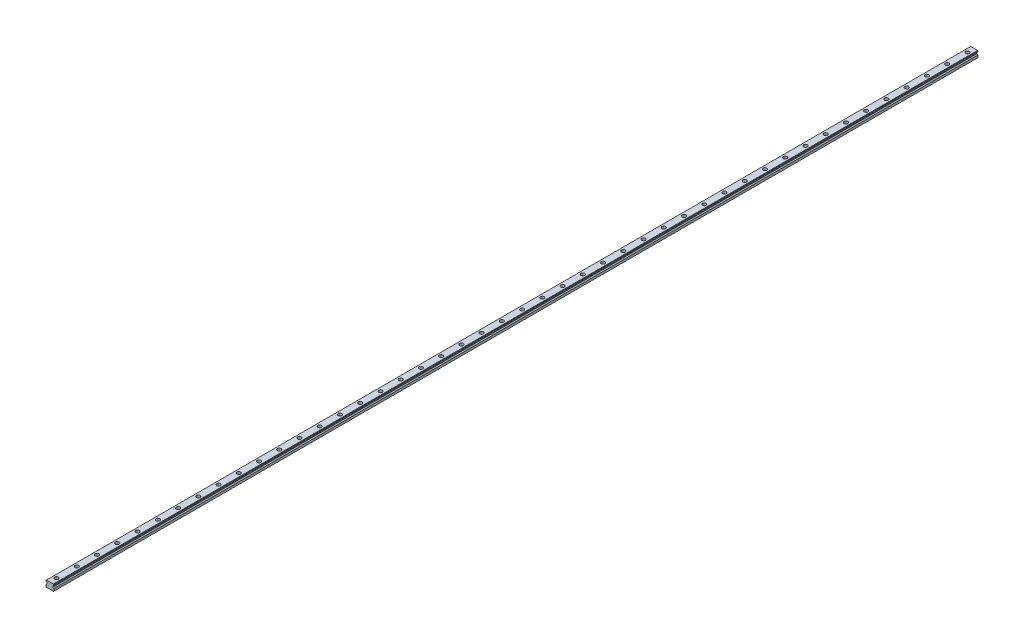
ISO-10303-21;
HEADER;
FILE_DESCRIPTION(('STEP AP214'),'2;1');
FILE_NAME('part.step','',(''),(''),'','','');
FILE_SCHEMA(('AUTOMOTIVE_DESIGN { 1 0 10303 214 1 1 1 1 }'));
ENDSEC;
DATA;
#1=APPLICATION_CONTEXT('core data for automotive mechanical design processes');
#2=APPLICATION_PROTOCOL_DEFINITION('international standard','automotive_design',2000,#1);
#3=PRODUCT_CONTEXT('',#1,'mechanical');
#4=PRODUCT('Part','Part','',(#3));
#5=PRODUCT_RELATED_PRODUCT_CATEGORY('part','',(#4));
#6=PRODUCT_DEFINITION_FORMATION('','',#4);
#7=PRODUCT_DEFINITION_CONTEXT('part definition',#1,'design');
#8=PRODUCT_DEFINITION('design','',#6,#7);
#9=PRODUCT_DEFINITION_SHAPE('','',#8);
#10=(LENGTH_UNIT() NAMED_UNIT(*) SI_UNIT(.MILLI.,.METRE.));
#11=(NAMED_UNIT(*) PLANE_ANGLE_UNIT() SI_UNIT($,.RADIAN.));
#12=(NAMED_UNIT(*) SI_UNIT($,.STERADIAN.) SOLID_ANGLE_UNIT());
#13=UNCERTAINTY_MEASURE_WITH_UNIT(LENGTH_MEASURE(1.E-05),#10,'distance_accuracy_value','');
#14=(GEOMETRIC_REPRESENTATION_CONTEXT(3) GLOBAL_UNCERTAINTY_ASSIGNED_CONTEXT((#13)) GLOBAL_UNIT_ASSIGNED_CONTEXT((#10,
#11,#12)) REPRESENTATION_CONTEXT('',''));
#15=CARTESIAN_POINT('',(0.,0.,0.));
#16=DIRECTION('',(0.,0.,1.));
#17=DIRECTION('',(1.,0.,0.));
#18=AXIS2_PLACEMENT_3D('',#15,#16,#17);
#19=CARTESIAN_POINT('',(0.,10.2,-1350.));
#20=DIRECTION('',(0.,1.,0.));
#21=DIRECTION('',(0.,0.,1.));
#22=AXIS2_PLACEMENT_3D('',#19,#20,#21);
#23=PLANE('',#22);
#24=CARTESIAN_POINT('',(0.,10.2,-1350.));
#25=DIRECTION('',(0.,1.,0.));
#26=DIRECTION('',(0.,0.,1.));
#27=AXIS2_PLACEMENT_3D('',#24,#25,#26);
#28=CIRCLE('',#27,3.49999999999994);
#29=CARTESIAN_POINT('',(0.,10.2,-1346.5));
#30=VERTEX_POINT('',#29);
#31=EDGE_CURVE('E710',#30,#30,#28,.T.);
#32=ORIENTED_EDGE('',*,*,#31,.F.);
#33=EDGE_LOOP('',(#32));
#34=FACE_BOUND('',#33,.T.);
#35=CARTESIAN_POINT('',(0.,10.2,-1350.));
#36=DIRECTION('',(0.,1.,0.));
#37=DIRECTION('',(0.,0.,1.));
#38=AXIS2_PLACEMENT_3D('',#35,#36,#37);
#39=CIRCLE('',#38,5.49999999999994);
#40=CARTESIAN_POINT('',(0.,10.2,-1344.5));
#41=VERTEX_POINT('',#40);
#42=EDGE_CURVE('E11',#41,#41,#39,.T.);
#43=ORIENTED_EDGE('',*,*,#42,.T.);
#44=EDGE_LOOP('',(#43));
#45=FACE_BOUND('',#44,.T.);
#46=ADVANCED_FACE('F39',(#34,#45),#23,.T.);
#47=CARTESIAN_POINT('',(0.,10.2,-1350.));
#48=DIRECTION('',(0.,1.,0.));
#49=DIRECTION('',(0.,0.,1.));
#50=AXIS2_PLACEMENT_3D('',#47,#48,#49);
#51=CYLINDRICAL_SURFACE('',#50,5.49999999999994);
#52=ORIENTED_EDGE('',*,*,#42,.F.);
#53=EDGE_LOOP('',(#52));
#54=FACE_BOUND('',#53,.T.);
#55=CARTESIAN_POINT('',(0.,19.2,-1350.));
#56=DIRECTION('',(0.,1.,0.));
#57=DIRECTION('',(0.,0.,1.));
#58=AXIS2_PLACEMENT_3D('',#55,#56,#57);
#59=CIRCLE('',#58,5.49999999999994);
#60=CARTESIAN_POINT('',(0.,19.2,-1344.5));
#61=VERTEX_POINT('',#60);
#62=EDGE_CURVE('E48',#61,#61,#59,.T.);
#63=ORIENTED_EDGE('',*,*,#62,.T.);
#64=EDGE_LOOP('',(#63));
#65=FACE_BOUND('',#64,.T.);
#66=ADVANCED_FACE('F1247',(#54,#65),#51,.F.);
#67=CARTESIAN_POINT('',(0.,10.2,-1290.));
#68=DIRECTION('',(0.,1.,0.));
#69=DIRECTION('',(0.,0.,1.));
#70=AXIS2_PLACEMENT_3D('',#67,#68,#69);
#71=PLANE('',#70);
#72=CARTESIAN_POINT('',(0.,10.2,-1290.));
#73=DIRECTION('',(0.,1.,0.));
#74=DIRECTION('',(0.,0.,1.));
#75=AXIS2_PLACEMENT_3D('',#72,#73,#74);
#76=CIRCLE('',#75,3.49999999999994);
#77=CARTESIAN_POINT('',(0.,10.2,-1286.5));
#78=VERTEX_POINT('',#77);
#79=EDGE_CURVE('E715',#78,#78,#76,.T.);
#80=ORIENTED_EDGE('',*,*,#79,.F.);
#81=EDGE_LOOP('',(#80));
#82=FACE_BOUND('',#81,.T.);
#83=CARTESIAN_POINT('',(0.,10.2,-1290.));
#84=DIRECTION('',(0.,1.,0.));
#85=DIRECTION('',(0.,0.,1.));
#86=AXIS2_PLACEMENT_3D('',#83,#84,#85);
#87=CIRCLE('',#86,5.49999999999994);
#88=CARTESIAN_POINT('',(0.,10.2,-1284.5));
#89=VERTEX_POINT('',#88);
#90=EDGE_CURVE('E694',#89,#89,#87,.T.);
#91=ORIENTED_EDGE('',*,*,#90,.T.);
#92=EDGE_LOOP('',(#91));
#93=FACE_BOUND('',#92,.T.);
#94=ADVANCED_FACE('F1252',(#82,#93),#71,.T.);
#95=CARTESIAN_POINT('',(0.,10.2,-1290.));
#96=DIRECTION('',(0.,1.,0.));
#97=DIRECTION('',(0.,0.,1.));
#98=AXIS2_PLACEMENT_3D('',#95,#96,#97);
#99=CYLINDRICAL_SURFACE('',#98,5.49999999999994);
#100=ORIENTED_EDGE('',*,*,#90,.F.);
#101=EDGE_LOOP('',(#100));
#102=FACE_BOUND('',#101,.T.);
#103=CARTESIAN_POINT('',(0.,19.2,-1290.));
#104=DIRECTION('',(0.,1.,0.));
#105=DIRECTION('',(0.,0.,1.));
#106=AXIS2_PLACEMENT_3D('',#103,#104,#105);
#107=CIRCLE('',#106,5.49999999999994);
#108=CARTESIAN_POINT('',(0.,19.2,-1284.5));
#109=VERTEX_POINT('',#108);
#110=EDGE_CURVE('E690',#109,#109,#107,.T.);
#111=ORIENTED_EDGE('',*,*,#110,.T.);
#112=EDGE_LOOP('',(#111));
#113=FACE_BOUND('',#112,.T.);
#114=ADVANCED_FACE('F1644',(#102,#113),#99,.F.);
#115=CARTESIAN_POINT('',(0.,10.2,-1230.));
#116=DIRECTION('',(0.,1.,0.));
#117=DIRECTION('',(0.,0.,1.));
#118=AXIS2_PLACEMENT_3D('',#115,#116,#117);
#119=PLANE('',#118);
#120=CARTESIAN_POINT('',(0.,10.2,-1230.));
#121=DIRECTION('',(0.,1.,0.));
#122=DIRECTION('',(0.,0.,1.));
#123=AXIS2_PLACEMENT_3D('',#120,#121,#122);
#124=CIRCLE('',#123,3.49999999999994);
#125=CARTESIAN_POINT('',(0.,10.2,-1226.5));
#126=VERTEX_POINT('',#125);
#127=EDGE_CURVE('E720',#126,#126,#124,.T.);
#128=ORIENTED_EDGE('',*,*,#127,.F.);
#129=EDGE_LOOP('',(#128));
#130=FACE_BOUND('',#129,.T.);
#131=CARTESIAN_POINT('',(0.,10.2,-1230.));
#132=DIRECTION('',(0.,1.,0.));
#133=DIRECTION('',(0.,0.,1.));
#134=AXIS2_PLACEMENT_3D('',#131,#132,#133);
#135=CIRCLE('',#134,5.49999999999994);
#136=CARTESIAN_POINT('',(0.,10.2,-1224.5));
#137=VERTEX_POINT('',#136);
#138=EDGE_CURVE('E686',#137,#137,#135,.T.);
#139=ORIENTED_EDGE('',*,*,#138,.T.);
#140=EDGE_LOOP('',(#139));
#141=FACE_BOUND('',#140,.T.);
#142=ADVANCED_FACE('F1640',(#130,#141),#119,.T.);
#143=CARTESIAN_POINT('',(0.,10.2,-1230.));
#144=DIRECTION('',(0.,1.,0.));
#145=DIRECTION('',(0.,0.,1.));
#146=AXIS2_PLACEMENT_3D('',#143,#144,#145);
#147=CYLINDRICAL_SURFACE('',#146,5.49999999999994);
#148=ORIENTED_EDGE('',*,*,#138,.F.);
#149=EDGE_LOOP('',(#148));
#150=FACE_BOUND('',#149,.T.);
#151=CARTESIAN_POINT('',(0.,19.2,-1230.));
#152=DIRECTION('',(0.,1.,0.));
#153=DIRECTION('',(0.,0.,1.));
#154=AXIS2_PLACEMENT_3D('',#151,#152,#153);
#155=CIRCLE('',#154,5.49999999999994);
#156=CARTESIAN_POINT('',(0.,19.2,-1224.5));
#157=VERTEX_POINT('',#156);
#158=EDGE_CURVE('E682',#157,#157,#155,.T.);
#159=ORIENTED_EDGE('',*,*,#158,.T.);
#160=EDGE_LOOP('',(#159));
#161=FACE_BOUND('',#160,.T.);
#162=ADVANCED_FACE('F1636',(#150,#161),#147,.F.);
#163=CARTESIAN_POINT('',(0.,10.2,-1170.));
#164=DIRECTION('',(0.,1.,0.));
#165=DIRECTION('',(0.,0.,1.));
#166=AXIS2_PLACEMENT_3D('',#163,#164,#165);
#167=PLANE('',#166);
#168=CARTESIAN_POINT('',(0.,10.2,-1170.));
#169=DIRECTION('',(0.,1.,0.));
#170=DIRECTION('',(0.,0.,1.));
#171=AXIS2_PLACEMENT_3D('',#168,#169,#170);
#172=CIRCLE('',#171,3.49999999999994);
#173=CARTESIAN_POINT('',(0.,10.2,-1166.5));
#174=VERTEX_POINT('',#173);
#175=EDGE_CURVE('E725',#174,#174,#172,.T.);
#176=ORIENTED_EDGE('',*,*,#175,.F.);
#177=EDGE_LOOP('',(#176));
#178=FACE_BOUND('',#177,.T.);
#179=CARTESIAN_POINT('',(0.,10.2,-1170.));
#180=DIRECTION('',(0.,1.,0.));
#181=DIRECTION('',(0.,0.,1.));
#182=AXIS2_PLACEMENT_3D('',#179,#180,#181);
#183=CIRCLE('',#182,5.49999999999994);
#184=CARTESIAN_POINT('',(0.,10.2,-1164.5));
#185=VERTEX_POINT('',#184);
#186=EDGE_CURVE('E678',#185,#185,#183,.T.);
#187=ORIENTED_EDGE('',*,*,#186,.T.);
#188=EDGE_LOOP('',(#187));
#189=FACE_BOUND('',#188,.T.);
#190=ADVANCED_FACE('F1632',(#178,#189),#167,.T.);
#191=CARTESIAN_POINT('',(0.,10.2,-1170.));
#192=DIRECTION('',(0.,1.,0.));
#193=DIRECTION('',(0.,0.,1.));
#194=AXIS2_PLACEMENT_3D('',#191,#192,#193);
#195=CYLINDRICAL_SURFACE('',#194,5.49999999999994);
#196=ORIENTED_EDGE('',*,*,#186,.F.);
#197=EDGE_LOOP('',(#196));
#198=FACE_BOUND('',#197,.T.);
#199=CARTESIAN_POINT('',(0.,19.2,-1170.));
#200=DIRECTION('',(0.,1.,0.));
#201=DIRECTION('',(0.,0.,1.));
#202=AXIS2_PLACEMENT_3D('',#199,#200,#201);
#203=CIRCLE('',#202,5.49999999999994);
#204=CARTESIAN_POINT('',(0.,19.2,-1164.5));
#205=VERTEX_POINT('',#204);
#206=EDGE_CURVE('E674',#205,#205,#203,.T.);
#207=ORIENTED_EDGE('',*,*,#206,.T.);
#208=EDGE_LOOP('',(#207));
#209=FACE_BOUND('',#208,.T.);
#210=ADVANCED_FACE('F1628',(#198,#209),#195,.F.);
#211=CARTESIAN_POINT('',(0.,10.2,-1110.));
#212=DIRECTION('',(0.,1.,0.));
#213=DIRECTION('',(0.,0.,1.));
#214=AXIS2_PLACEMENT_3D('',#211,#212,#213);
#215=PLANE('',#214);
#216=CARTESIAN_POINT('',(0.,10.2,-1110.));
#217=DIRECTION('',(0.,1.,0.));
#218=DIRECTION('',(0.,0.,1.));
#219=AXIS2_PLACEMENT_3D('',#216,#217,#218);
#220=CIRCLE('',#219,3.49999999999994);
#221=CARTESIAN_POINT('',(0.,10.2,-1106.5));
#222=VERTEX_POINT('',#221);
#223=EDGE_CURVE('E730',#222,#222,#220,.T.);
#224=ORIENTED_EDGE('',*,*,#223,.F.);
#225=EDGE_LOOP('',(#224));
#226=FACE_BOUND('',#225,.T.);
#227=CARTESIAN_POINT('',(0.,10.2,-1110.));
#228=DIRECTION('',(0.,1.,0.));
#229=DIRECTION('',(0.,0.,1.));
#230=AXIS2_PLACEMENT_3D('',#227,#228,#229);
#231=CIRCLE('',#230,5.49999999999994);
#232=CARTESIAN_POINT('',(0.,10.2,-1104.5));
#233=VERTEX_POINT('',#232);
#234=EDGE_CURVE('E670',#233,#233,#231,.T.);
#235=ORIENTED_EDGE('',*,*,#234,.T.);
#236=EDGE_LOOP('',(#235));
#237=FACE_BOUND('',#236,.T.);
#238=ADVANCED_FACE('F1624',(#226,#237),#215,.T.);
#239=CARTESIAN_POINT('',(0.,10.2,-1110.));
#240=DIRECTION('',(0.,1.,0.));
#241=DIRECTION('',(0.,0.,1.));
#242=AXIS2_PLACEMENT_3D('',#239,#240,#241);
#243=CYLINDRICAL_SURFACE('',#242,5.49999999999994);
#244=ORIENTED_EDGE('',*,*,#234,.F.);
#245=EDGE_LOOP('',(#244));
#246=FACE_BOUND('',#245,.T.);
#247=CARTESIAN_POINT('',(0.,19.2,-1110.));
#248=DIRECTION('',(0.,1.,0.));
#249=DIRECTION('',(0.,0.,1.));
#250=AXIS2_PLACEMENT_3D('',#247,#248,#249);
#251=CIRCLE('',#250,5.49999999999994);
#252=CARTESIAN_POINT('',(0.,19.2,-1104.5));
#253=VERTEX_POINT('',#252);
#254=EDGE_CURVE('E666',#253,#253,#251,.T.);
#255=ORIENTED_EDGE('',*,*,#254,.T.);
#256=EDGE_LOOP('',(#255));
#257=FACE_BOUND('',#256,.T.);
#258=ADVANCED_FACE('F1620',(#246,#257),#243,.F.);
#259=CARTESIAN_POINT('',(0.,10.2,-1050.));
#260=DIRECTION('',(0.,1.,0.));
#261=DIRECTION('',(0.,0.,1.));
#262=AXIS2_PLACEMENT_3D('',#259,#260,#261);
#263=PLANE('',#262);
#264=CARTESIAN_POINT('',(0.,10.2,-1050.));
#265=DIRECTION('',(0.,1.,0.));
#266=DIRECTION('',(0.,0.,1.));
#267=AXIS2_PLACEMENT_3D('',#264,#265,#266);
#268=CIRCLE('',#267,3.49999999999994);
#269=CARTESIAN_POINT('',(0.,10.2,-1046.5));
#270=VERTEX_POINT('',#269);
#271=EDGE_CURVE('E735',#270,#270,#268,.T.);
#272=ORIENTED_EDGE('',*,*,#271,.F.);
#273=EDGE_LOOP('',(#272));
#274=FACE_BOUND('',#273,.T.);
#275=CARTESIAN_POINT('',(0.,10.2,-1050.));
#276=DIRECTION('',(0.,1.,0.));
#277=DIRECTION('',(0.,0.,1.));
#278=AXIS2_PLACEMENT_3D('',#275,#276,#277);
#279=CIRCLE('',#278,5.49999999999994);
#280=CARTESIAN_POINT('',(0.,10.2,-1044.5));
#281=VERTEX_POINT('',#280);
#282=EDGE_CURVE('E662',#281,#281,#279,.T.);
#283=ORIENTED_EDGE('',*,*,#282,.T.);
#284=EDGE_LOOP('',(#283));
#285=FACE_BOUND('',#284,.T.);
#286=ADVANCED_FACE('F1616',(#274,#285),#263,.T.);
#287=CARTESIAN_POINT('',(0.,10.2,-1050.));
#288=DIRECTION('',(0.,1.,0.));
#289=DIRECTION('',(0.,0.,1.));
#290=AXIS2_PLACEMENT_3D('',#287,#288,#289);
#291=CYLINDRICAL_SURFACE('',#290,5.49999999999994);
#292=ORIENTED_EDGE('',*,*,#282,.F.);
#293=EDGE_LOOP('',(#292));
#294=FACE_BOUND('',#293,.T.);
#295=CARTESIAN_POINT('',(0.,19.2,-1050.));
#296=DIRECTION('',(0.,1.,0.));
#297=DIRECTION('',(0.,0.,1.));
#298=AXIS2_PLACEMENT_3D('',#295,#296,#297);
#299=CIRCLE('',#298,5.49999999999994);
#300=CARTESIAN_POINT('',(0.,19.2,-1044.5));
#301=VERTEX_POINT('',#300);
#302=EDGE_CURVE('E658',#301,#301,#299,.T.);
#303=ORIENTED_EDGE('',*,*,#302,.T.);
#304=EDGE_LOOP('',(#303));
#305=FACE_BOUND('',#304,.T.);
#306=ADVANCED_FACE('F1612',(#294,#305),#291,.F.);
#307=CARTESIAN_POINT('',(0.,10.2,-990.));
#308=DIRECTION('',(0.,1.,0.));
#309=DIRECTION('',(0.,0.,1.));
#310=AXIS2_PLACEMENT_3D('',#307,#308,#309);
#311=PLANE('',#310);
#312=CARTESIAN_POINT('',(0.,10.2,-990.));
#313=DIRECTION('',(0.,1.,0.));
#314=DIRECTION('',(0.,0.,1.));
#315=AXIS2_PLACEMENT_3D('',#312,#313,#314);
#316=CIRCLE('',#315,3.49999999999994);
#317=CARTESIAN_POINT('',(0.,10.2,-986.5));
#318=VERTEX_POINT('',#317);
#319=EDGE_CURVE('E740',#318,#318,#316,.T.);
#320=ORIENTED_EDGE('',*,*,#319,.F.);
#321=EDGE_LOOP('',(#320));
#322=FACE_BOUND('',#321,.T.);
#323=CARTESIAN_POINT('',(0.,10.2,-990.));
#324=DIRECTION('',(0.,1.,0.));
#325=DIRECTION('',(0.,0.,1.));
#326=AXIS2_PLACEMENT_3D('',#323,#324,#325);
#327=CIRCLE('',#326,5.49999999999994);
#328=CARTESIAN_POINT('',(0.,10.2,-984.5));
#329=VERTEX_POINT('',#328);
#330=EDGE_CURVE('E654',#329,#329,#327,.T.);
#331=ORIENTED_EDGE('',*,*,#330,.T.);
#332=EDGE_LOOP('',(#331));
#333=FACE_BOUND('',#332,.T.);
#334=ADVANCED_FACE('F1608',(#322,#333),#311,.T.);
#335=CARTESIAN_POINT('',(0.,10.2,-990.));
#336=DIRECTION('',(0.,1.,0.));
#337=DIRECTION('',(0.,0.,1.));
#338=AXIS2_PLACEMENT_3D('',#335,#336,#337);
#339=CYLINDRICAL_SURFACE('',#338,5.49999999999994);
#340=ORIENTED_EDGE('',*,*,#330,.F.);
#341=EDGE_LOOP('',(#340));
#342=FACE_BOUND('',#341,.T.);
#343=CARTESIAN_POINT('',(0.,19.2,-990.));
#344=DIRECTION('',(0.,1.,0.));
#345=DIRECTION('',(0.,0.,1.));
#346=AXIS2_PLACEMENT_3D('',#343,#344,#345);
#347=CIRCLE('',#346,5.49999999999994);
#348=CARTESIAN_POINT('',(0.,19.2,-984.5));
#349=VERTEX_POINT('',#348);
#350=EDGE_CURVE('E650',#349,#349,#347,.T.);
#351=ORIENTED_EDGE('',*,*,#350,.T.);
#352=EDGE_LOOP('',(#351));
#353=FACE_BOUND('',#352,.T.);
#354=ADVANCED_FACE('F1604',(#342,#353),#339,.F.);
#355=CARTESIAN_POINT('',(0.,10.2,-930.));
#356=DIRECTION('',(0.,1.,0.));
#357=DIRECTION('',(0.,0.,1.));
#358=AXIS2_PLACEMENT_3D('',#355,#356,#357);
#359=PLANE('',#358);
#360=CARTESIAN_POINT('',(0.,10.2,-930.));
#361=DIRECTION('',(0.,1.,0.));
#362=DIRECTION('',(0.,0.,1.));
#363=AXIS2_PLACEMENT_3D('',#360,#361,#362);
#364=CIRCLE('',#363,3.49999999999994);
#365=CARTESIAN_POINT('',(0.,10.2,-926.5));
#366=VERTEX_POINT('',#365);
#367=EDGE_CURVE('E745',#366,#366,#364,.T.);
#368=ORIENTED_EDGE('',*,*,#367,.F.);
#369=EDGE_LOOP('',(#368));
#370=FACE_BOUND('',#369,.T.);
#371=CARTESIAN_POINT('',(0.,10.2,-930.));
#372=DIRECTION('',(0.,1.,0.));
#373=DIRECTION('',(0.,0.,1.));
#374=AXIS2_PLACEMENT_3D('',#371,#372,#373);
#375=CIRCLE('',#374,5.49999999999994);
#376=CARTESIAN_POINT('',(0.,10.2,-924.5));
#377=VERTEX_POINT('',#376);
#378=EDGE_CURVE('E646',#377,#377,#375,.T.);
#379=ORIENTED_EDGE('',*,*,#378,.T.);
#380=EDGE_LOOP('',(#379));
#381=FACE_BOUND('',#380,.T.);
#382=ADVANCED_FACE('F1600',(#370,#381),#359,.T.);
#383=CARTESIAN_POINT('',(0.,10.2,-930.));
#384=DIRECTION('',(0.,1.,0.));
#385=DIRECTION('',(0.,0.,1.));
#386=AXIS2_PLACEMENT_3D('',#383,#384,#385);
#387=CYLINDRICAL_SURFACE('',#386,5.49999999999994);
#388=ORIENTED_EDGE('',*,*,#378,.F.);
#389=EDGE_LOOP('',(#388));
#390=FACE_BOUND('',#389,.T.);
#391=CARTESIAN_POINT('',(0.,19.2,-930.));
#392=DIRECTION('',(0.,1.,0.));
#393=DIRECTION('',(0.,0.,1.));
#394=AXIS2_PLACEMENT_3D('',#391,#392,#393);
#395=CIRCLE('',#394,5.49999999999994);
#396=CARTESIAN_POINT('',(0.,19.2,-924.5));
#397=VERTEX_POINT('',#396);
#398=EDGE_CURVE('E642',#397,#397,#395,.T.);
#399=ORIENTED_EDGE('',*,*,#398,.T.);
#400=EDGE_LOOP('',(#399));
#401=FACE_BOUND('',#400,.T.);
#402=ADVANCED_FACE('F1596',(#390,#401),#387,.F.);
#403=CARTESIAN_POINT('',(0.,10.2,-870.));
#404=DIRECTION('',(0.,1.,0.));
#405=DIRECTION('',(0.,0.,1.));
#406=AXIS2_PLACEMENT_3D('',#403,#404,#405);
#407=PLANE('',#406);
#408=CARTESIAN_POINT('',(0.,10.2,-870.));
#409=DIRECTION('',(0.,1.,0.));
#410=DIRECTION('',(0.,0.,1.));
#411=AXIS2_PLACEMENT_3D('',#408,#409,#410);
#412=CIRCLE('',#411,3.49999999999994);
#413=CARTESIAN_POINT('',(0.,10.2,-866.5));
#414=VERTEX_POINT('',#413);
#415=EDGE_CURVE('E750',#414,#414,#412,.T.);
#416=ORIENTED_EDGE('',*,*,#415,.F.);
#417=EDGE_LOOP('',(#416));
#418=FACE_BOUND('',#417,.T.);
#419=CARTESIAN_POINT('',(0.,10.2,-870.));
#420=DIRECTION('',(0.,1.,0.));
#421=DIRECTION('',(0.,0.,1.));
#422=AXIS2_PLACEMENT_3D('',#419,#420,#421);
#423=CIRCLE('',#422,5.49999999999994);
#424=CARTESIAN_POINT('',(0.,10.2,-864.5));
#425=VERTEX_POINT('',#424);
#426=EDGE_CURVE('E638',#425,#425,#423,.T.);
#427=ORIENTED_EDGE('',*,*,#426,.T.);
#428=EDGE_LOOP('',(#427));
#429=FACE_BOUND('',#428,.T.);
#430=ADVANCED_FACE('F1592',(#418,#429),#407,.T.);
#431=CARTESIAN_POINT('',(0.,10.2,-870.));
#432=DIRECTION('',(0.,1.,0.));
#433=DIRECTION('',(0.,0.,1.));
#434=AXIS2_PLACEMENT_3D('',#431,#432,#433);
#435=CYLINDRICAL_SURFACE('',#434,5.49999999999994);
#436=ORIENTED_EDGE('',*,*,#426,.F.);
#437=EDGE_LOOP('',(#436));
#438=FACE_BOUND('',#437,.T.);
#439=CARTESIAN_POINT('',(0.,19.2,-870.));
#440=DIRECTION('',(0.,1.,0.));
#441=DIRECTION('',(0.,0.,1.));
#442=AXIS2_PLACEMENT_3D('',#439,#440,#441);
#443=CIRCLE('',#442,5.49999999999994);
#444=CARTESIAN_POINT('',(0.,19.2,-864.5));
#445=VERTEX_POINT('',#444);
#446=EDGE_CURVE('E634',#445,#445,#443,.T.);
#447=ORIENTED_EDGE('',*,*,#446,.T.);
#448=EDGE_LOOP('',(#447));
#449=FACE_BOUND('',#448,.T.);
#450=ADVANCED_FACE('F1588',(#438,#449),#435,.F.);
#451=CARTESIAN_POINT('',(0.,10.2,-810.));
#452=DIRECTION('',(0.,1.,0.));
#453=DIRECTION('',(0.,0.,1.));
#454=AXIS2_PLACEMENT_3D('',#451,#452,#453);
#455=PLANE('',#454);
#456=CARTESIAN_POINT('',(0.,10.2,-810.));
#457=DIRECTION('',(0.,1.,0.));
#458=DIRECTION('',(0.,0.,1.));
#459=AXIS2_PLACEMENT_3D('',#456,#457,#458);
#460=CIRCLE('',#459,3.49999999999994);
#461=CARTESIAN_POINT('',(0.,10.2,-806.5));
#462=VERTEX_POINT('',#461);
#463=EDGE_CURVE('E755',#462,#462,#460,.T.);
#464=ORIENTED_EDGE('',*,*,#463,.F.);
#465=EDGE_LOOP('',(#464));
#466=FACE_BOUND('',#465,.T.);
#467=CARTESIAN_POINT('',(0.,10.2,-810.));
#468=DIRECTION('',(0.,1.,0.));
#469=DIRECTION('',(0.,0.,1.));
#470=AXIS2_PLACEMENT_3D('',#467,#468,#469);
#471=CIRCLE('',#470,5.49999999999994);
#472=CARTESIAN_POINT('',(0.,10.2,-804.5));
#473=VERTEX_POINT('',#472);
#474=EDGE_CURVE('E630',#473,#473,#471,.T.);
#475=ORIENTED_EDGE('',*,*,#474,.T.);
#476=EDGE_LOOP('',(#475));
#477=FACE_BOUND('',#476,.T.);
#478=ADVANCED_FACE('F1584',(#466,#477),#455,.T.);
#479=CARTESIAN_POINT('',(0.,10.2,-810.));
#480=DIRECTION('',(0.,1.,0.));
#481=DIRECTION('',(0.,0.,1.));
#482=AXIS2_PLACEMENT_3D('',#479,#480,#481);
#483=CYLINDRICAL_SURFACE('',#482,5.49999999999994);
#484=ORIENTED_EDGE('',*,*,#474,.F.);
#485=EDGE_LOOP('',(#484));
#486=FACE_BOUND('',#485,.T.);
#487=CARTESIAN_POINT('',(0.,19.2,-810.));
#488=DIRECTION('',(0.,1.,0.));
#489=DIRECTION('',(0.,0.,1.));
#490=AXIS2_PLACEMENT_3D('',#487,#488,#489);
#491=CIRCLE('',#490,5.49999999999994);
#492=CARTESIAN_POINT('',(0.,19.2,-804.5));
#493=VERTEX_POINT('',#492);
#494=EDGE_CURVE('E626',#493,#493,#491,.T.);
#495=ORIENTED_EDGE('',*,*,#494,.T.);
#496=EDGE_LOOP('',(#495));
#497=FACE_BOUND('',#496,.T.);
#498=ADVANCED_FACE('F1580',(#486,#497),#483,.F.);
#499=CARTESIAN_POINT('',(0.,10.2,-750.));
#500=DIRECTION('',(0.,1.,0.));
#501=DIRECTION('',(0.,0.,1.));
#502=AXIS2_PLACEMENT_3D('',#499,#500,#501);
#503=PLANE('',#502);
#504=CARTESIAN_POINT('',(0.,10.2,-750.));
#505=DIRECTION('',(0.,1.,0.));
#506=DIRECTION('',(0.,0.,1.));
#507=AXIS2_PLACEMENT_3D('',#504,#505,#506);
#508=CIRCLE('',#507,3.49999999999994);
#509=CARTESIAN_POINT('',(0.,10.2,-746.5));
#510=VERTEX_POINT('',#509);
#511=EDGE_CURVE('E760',#510,#510,#508,.T.);
#512=ORIENTED_EDGE('',*,*,#511,.F.);
#513=EDGE_LOOP('',(#512));
#514=FACE_BOUND('',#513,.T.);
#515=CARTESIAN_POINT('',(0.,10.2,-750.));
#516=DIRECTION('',(0.,1.,0.));
#517=DIRECTION('',(0.,0.,1.));
#518=AXIS2_PLACEMENT_3D('',#515,#516,#517);
#519=CIRCLE('',#518,5.49999999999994);
#520=CARTESIAN_POINT('',(0.,10.2,-744.5));
#521=VERTEX_POINT('',#520);
#522=EDGE_CURVE('E622',#521,#521,#519,.T.);
#523=ORIENTED_EDGE('',*,*,#522,.T.);
#524=EDGE_LOOP('',(#523));
#525=FACE_BOUND('',#524,.T.);
#526=ADVANCED_FACE('F1576',(#514,#525),#503,.T.);
#527=CARTESIAN_POINT('',(0.,10.2,-750.));
#528=DIRECTION('',(0.,1.,0.));
#529=DIRECTION('',(0.,0.,1.));
#530=AXIS2_PLACEMENT_3D('',#527,#528,#529);
#531=CYLINDRICAL_SURFACE('',#530,5.49999999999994);
#532=ORIENTED_EDGE('',*,*,#522,.F.);
#533=EDGE_LOOP('',(#532));
#534=FACE_BOUND('',#533,.T.);
#535=CARTESIAN_POINT('',(0.,19.2,-750.));
#536=DIRECTION('',(0.,1.,0.));
#537=DIRECTION('',(0.,0.,1.));
#538=AXIS2_PLACEMENT_3D('',#535,#536,#537);
#539=CIRCLE('',#538,5.49999999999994);
#540=CARTESIAN_POINT('',(0.,19.2,-744.5));
#541=VERTEX_POINT('',#540);
#542=EDGE_CURVE('E618',#541,#541,#539,.T.);
#543=ORIENTED_EDGE('',*,*,#542,.T.);
#544=EDGE_LOOP('',(#543));
#545=FACE_BOUND('',#544,.T.);
#546=ADVANCED_FACE('F1572',(#534,#545),#531,.F.);
#547=CARTESIAN_POINT('',(0.,10.2,-690.));
#548=DIRECTION('',(0.,1.,0.));
#549=DIRECTION('',(0.,0.,1.));
#550=AXIS2_PLACEMENT_3D('',#547,#548,#549);
#551=PLANE('',#550);
#552=CARTESIAN_POINT('',(0.,10.2,-690.));
#553=DIRECTION('',(0.,1.,0.));
#554=DIRECTION('',(0.,0.,1.));
#555=AXIS2_PLACEMENT_3D('',#552,#553,#554);
#556=CIRCLE('',#555,3.49999999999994);
#557=CARTESIAN_POINT('',(0.,10.2,-686.5));
#558=VERTEX_POINT('',#557);
#559=EDGE_CURVE('E765',#558,#558,#556,.T.);
#560=ORIENTED_EDGE('',*,*,#559,.F.);
#561=EDGE_LOOP('',(#560));
#562=FACE_BOUND('',#561,.T.);
#563=CARTESIAN_POINT('',(0.,10.2,-690.));
#564=DIRECTION('',(0.,1.,0.));
#565=DIRECTION('',(0.,0.,1.));
#566=AXIS2_PLACEMENT_3D('',#563,#564,#565);
#567=CIRCLE('',#566,5.49999999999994);
#568=CARTESIAN_POINT('',(0.,10.2,-684.5));
#569=VERTEX_POINT('',#568);
#570=EDGE_CURVE('E614',#569,#569,#567,.T.);
#571=ORIENTED_EDGE('',*,*,#570,.T.);
#572=EDGE_LOOP('',(#571));
#573=FACE_BOUND('',#572,.T.);
#574=ADVANCED_FACE('F1568',(#562,#573),#551,.T.);
#575=CARTESIAN_POINT('',(0.,10.2,-690.));
#576=DIRECTION('',(0.,1.,0.));
#577=DIRECTION('',(0.,0.,1.));
#578=AXIS2_PLACEMENT_3D('',#575,#576,#577);
#579=CYLINDRICAL_SURFACE('',#578,5.49999999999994);
#580=ORIENTED_EDGE('',*,*,#570,.F.);
#581=EDGE_LOOP('',(#580));
#582=FACE_BOUND('',#581,.T.);
#583=CARTESIAN_POINT('',(0.,19.2,-690.));
#584=DIRECTION('',(0.,1.,0.));
#585=DIRECTION('',(0.,0.,1.));
#586=AXIS2_PLACEMENT_3D('',#583,#584,#585);
#587=CIRCLE('',#586,5.49999999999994);
#588=CARTESIAN_POINT('',(0.,19.2,-684.5));
#589=VERTEX_POINT('',#588);
#590=EDGE_CURVE('E610',#589,#589,#587,.T.);
#591=ORIENTED_EDGE('',*,*,#590,.T.);
#592=EDGE_LOOP('',(#591));
#593=FACE_BOUND('',#592,.T.);
#594=ADVANCED_FACE('F1564',(#582,#593),#579,.F.);
#595=CARTESIAN_POINT('',(0.,10.2,-630.));
#596=DIRECTION('',(0.,1.,0.));
#597=DIRECTION('',(0.,0.,1.));
#598=AXIS2_PLACEMENT_3D('',#595,#596,#597);
#599=PLANE('',#598);
#600=CARTESIAN_POINT('',(0.,10.2,-630.));
#601=DIRECTION('',(0.,1.,0.));
#602=DIRECTION('',(0.,0.,1.));
#603=AXIS2_PLACEMENT_3D('',#600,#601,#602);
#604=CIRCLE('',#603,3.49999999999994);
#605=CARTESIAN_POINT('',(0.,10.2,-626.5));
#606=VERTEX_POINT('',#605);
#607=EDGE_CURVE('E770',#606,#606,#604,.T.);
#608=ORIENTED_EDGE('',*,*,#607,.F.);
#609=EDGE_LOOP('',(#608));
#610=FACE_BOUND('',#609,.T.);
#611=CARTESIAN_POINT('',(0.,10.2,-630.));
#612=DIRECTION('',(0.,1.,0.));
#613=DIRECTION('',(0.,0.,1.));
#614=AXIS2_PLACEMENT_3D('',#611,#612,#613);
#615=CIRCLE('',#614,5.49999999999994);
#616=CARTESIAN_POINT('',(0.,10.2,-624.5));
#617=VERTEX_POINT('',#616);
#618=EDGE_CURVE('E606',#617,#617,#615,.T.);
#619=ORIENTED_EDGE('',*,*,#618,.T.);
#620=EDGE_LOOP('',(#619));
#621=FACE_BOUND('',#620,.T.);
#622=ADVANCED_FACE('F1560',(#610,#621),#599,.T.);
#623=CARTESIAN_POINT('',(0.,10.2,-630.));
#624=DIRECTION('',(0.,1.,0.));
#625=DIRECTION('',(0.,0.,1.));
#626=AXIS2_PLACEMENT_3D('',#623,#624,#625);
#627=CYLINDRICAL_SURFACE('',#626,5.49999999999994);
#628=ORIENTED_EDGE('',*,*,#618,.F.);
#629=EDGE_LOOP('',(#628));
#630=FACE_BOUND('',#629,.T.);
#631=CARTESIAN_POINT('',(0.,19.2,-630.));
#632=DIRECTION('',(0.,1.,0.));
#633=DIRECTION('',(0.,0.,1.));
#634=AXIS2_PLACEMENT_3D('',#631,#632,#633);
#635=CIRCLE('',#634,5.49999999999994);
#636=CARTESIAN_POINT('',(0.,19.2,-624.5));
#637=VERTEX_POINT('',#636);
#638=EDGE_CURVE('E602',#637,#637,#635,.T.);
#639=ORIENTED_EDGE('',*,*,#638,.T.);
#640=EDGE_LOOP('',(#639));
#641=FACE_BOUND('',#640,.T.);
#642=ADVANCED_FACE('F1556',(#630,#641),#627,.F.);
#643=CARTESIAN_POINT('',(0.,10.2,-570.));
#644=DIRECTION('',(0.,1.,0.));
#645=DIRECTION('',(0.,0.,1.));
#646=AXIS2_PLACEMENT_3D('',#643,#644,#645);
#647=PLANE('',#646);
#648=CARTESIAN_POINT('',(0.,10.2,-570.));
#649=DIRECTION('',(0.,1.,0.));
#650=DIRECTION('',(0.,0.,1.));
#651=AXIS2_PLACEMENT_3D('',#648,#649,#650);
#652=CIRCLE('',#651,3.49999999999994);
#653=CARTESIAN_POINT('',(0.,10.2,-566.5));
#654=VERTEX_POINT('',#653);
#655=EDGE_CURVE('E775',#654,#654,#652,.T.);
#656=ORIENTED_EDGE('',*,*,#655,.F.);
#657=EDGE_LOOP('',(#656));
#658=FACE_BOUND('',#657,.T.);
#659=CARTESIAN_POINT('',(0.,10.2,-570.));
#660=DIRECTION('',(0.,1.,0.));
#661=DIRECTION('',(0.,0.,1.));
#662=AXIS2_PLACEMENT_3D('',#659,#660,#661);
#663=CIRCLE('',#662,5.49999999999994);
#664=CARTESIAN_POINT('',(0.,10.2,-564.5));
#665=VERTEX_POINT('',#664);
#666=EDGE_CURVE('E598',#665,#665,#663,.T.);
#667=ORIENTED_EDGE('',*,*,#666,.T.);
#668=EDGE_LOOP('',(#667));
#669=FACE_BOUND('',#668,.T.);
#670=ADVANCED_FACE('F1552',(#658,#669),#647,.T.);
#671=CARTESIAN_POINT('',(0.,10.2,-570.));
#672=DIRECTION('',(0.,1.,0.));
#673=DIRECTION('',(0.,0.,1.));
#674=AXIS2_PLACEMENT_3D('',#671,#672,#673);
#675=CYLINDRICAL_SURFACE('',#674,5.49999999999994);
#676=ORIENTED_EDGE('',*,*,#666,.F.);
#677=EDGE_LOOP('',(#676));
#678=FACE_BOUND('',#677,.T.);
#679=CARTESIAN_POINT('',(0.,19.2,-570.));
#680=DIRECTION('',(0.,1.,0.));
#681=DIRECTION('',(0.,0.,1.));
#682=AXIS2_PLACEMENT_3D('',#679,#680,#681);
#683=CIRCLE('',#682,5.49999999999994);
#684=CARTESIAN_POINT('',(0.,19.2,-564.5));
#685=VERTEX_POINT('',#684);
#686=EDGE_CURVE('E594',#685,#685,#683,.T.);
#687=ORIENTED_EDGE('',*,*,#686,.T.);
#688=EDGE_LOOP('',(#687));
#689=FACE_BOUND('',#688,.T.);
#690=ADVANCED_FACE('F1548',(#678,#689),#675,.F.);
#691=CARTESIAN_POINT('',(0.,10.2,-510.));
#692=DIRECTION('',(0.,1.,0.));
#693=DIRECTION('',(0.,0.,1.));
#694=AXIS2_PLACEMENT_3D('',#691,#692,#693);
#695=PLANE('',#694);
#696=CARTESIAN_POINT('',(0.,10.2,-510.));
#697=DIRECTION('',(0.,1.,0.));
#698=DIRECTION('',(0.,0.,1.));
#699=AXIS2_PLACEMENT_3D('',#696,#697,#698);
#700=CIRCLE('',#699,3.49999999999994);
#701=CARTESIAN_POINT('',(0.,10.2,-506.5));
#702=VERTEX_POINT('',#701);
#703=EDGE_CURVE('E780',#702,#702,#700,.T.);
#704=ORIENTED_EDGE('',*,*,#703,.F.);
#705=EDGE_LOOP('',(#704));
#706=FACE_BOUND('',#705,.T.);
#707=CARTESIAN_POINT('',(0.,10.2,-510.));
#708=DIRECTION('',(0.,1.,0.));
#709=DIRECTION('',(0.,0.,1.));
#710=AXIS2_PLACEMENT_3D('',#707,#708,#709);
#711=CIRCLE('',#710,5.49999999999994);
#712=CARTESIAN_POINT('',(0.,10.2,-504.5));
#713=VERTEX_POINT('',#712);
#714=EDGE_CURVE('E590',#713,#713,#711,.T.);
#715=ORIENTED_EDGE('',*,*,#714,.T.);
#716=EDGE_LOOP('',(#715));
#717=FACE_BOUND('',#716,.T.);
#718=ADVANCED_FACE('F1544',(#706,#717),#695,.T.);
#719=CARTESIAN_POINT('',(0.,10.2,-510.));
#720=DIRECTION('',(0.,1.,0.));
#721=DIRECTION('',(0.,0.,1.));
#722=AXIS2_PLACEMENT_3D('',#719,#720,#721);
#723=CYLINDRICAL_SURFACE('',#722,5.49999999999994);
#724=ORIENTED_EDGE('',*,*,#714,.F.);
#725=EDGE_LOOP('',(#724));
#726=FACE_BOUND('',#725,.T.);
#727=CARTESIAN_POINT('',(0.,19.2,-510.));
#728=DIRECTION('',(0.,1.,0.));
#729=DIRECTION('',(0.,0.,1.));
#730=AXIS2_PLACEMENT_3D('',#727,#728,#729);
#731=CIRCLE('',#730,5.49999999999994);
#732=CARTESIAN_POINT('',(0.,19.2,-504.5));
#733=VERTEX_POINT('',#732);
#734=EDGE_CURVE('E586',#733,#733,#731,.T.);
#735=ORIENTED_EDGE('',*,*,#734,.T.);
#736=EDGE_LOOP('',(#735));
#737=FACE_BOUND('',#736,.T.);
#738=ADVANCED_FACE('F1540',(#726,#737),#723,.F.);
#739=CARTESIAN_POINT('',(0.,10.2,-450.));
#740=DIRECTION('',(0.,1.,0.));
#741=DIRECTION('',(0.,0.,1.));
#742=AXIS2_PLACEMENT_3D('',#739,#740,#741);
#743=PLANE('',#742);
#744=CARTESIAN_POINT('',(0.,10.2,-450.));
#745=DIRECTION('',(0.,1.,0.));
#746=DIRECTION('',(0.,0.,1.));
#747=AXIS2_PLACEMENT_3D('',#744,#745,#746);
#748=CIRCLE('',#747,3.49999999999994);
#749=CARTESIAN_POINT('',(0.,10.2,-446.5));
#750=VERTEX_POINT('',#749);
#751=EDGE_CURVE('E785',#750,#750,#748,.T.);
#752=ORIENTED_EDGE('',*,*,#751,.F.);
#753=EDGE_LOOP('',(#752));
#754=FACE_BOUND('',#753,.T.);
#755=CARTESIAN_POINT('',(0.,10.2,-450.));
#756=DIRECTION('',(0.,1.,0.));
#757=DIRECTION('',(0.,0.,1.));
#758=AXIS2_PLACEMENT_3D('',#755,#756,#757);
#759=CIRCLE('',#758,5.49999999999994);
#760=CARTESIAN_POINT('',(0.,10.2,-444.5));
#761=VERTEX_POINT('',#760);
#762=EDGE_CURVE('E582',#761,#761,#759,.T.);
#763=ORIENTED_EDGE('',*,*,#762,.T.);
#764=EDGE_LOOP('',(#763));
#765=FACE_BOUND('',#764,.T.);
#766=ADVANCED_FACE('F1536',(#754,#765),#743,.T.);
#767=CARTESIAN_POINT('',(0.,10.2,-450.));
#768=DIRECTION('',(0.,1.,0.));
#769=DIRECTION('',(0.,0.,1.));
#770=AXIS2_PLACEMENT_3D('',#767,#768,#769);
#771=CYLINDRICAL_SURFACE('',#770,5.49999999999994);
#772=ORIENTED_EDGE('',*,*,#762,.F.);
#773=EDGE_LOOP('',(#772));
#774=FACE_BOUND('',#773,.T.);
#775=CARTESIAN_POINT('',(0.,19.2,-450.));
#776=DIRECTION('',(0.,1.,0.));
#777=DIRECTION('',(0.,0.,1.));
#778=AXIS2_PLACEMENT_3D('',#775,#776,#777);
#779=CIRCLE('',#778,5.49999999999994);
#780=CARTESIAN_POINT('',(0.,19.2,-444.5));
#781=VERTEX_POINT('',#780);
#782=EDGE_CURVE('E578',#781,#781,#779,.T.);
#783=ORIENTED_EDGE('',*,*,#782,.T.);
#784=EDGE_LOOP('',(#783));
#785=FACE_BOUND('',#784,.T.);
#786=ADVANCED_FACE('F1532',(#774,#785),#771,.F.);
#787=CARTESIAN_POINT('',(0.,10.2,-390.));
#788=DIRECTION('',(0.,1.,0.));
#789=DIRECTION('',(0.,0.,1.));
#790=AXIS2_PLACEMENT_3D('',#787,#788,#789);
#791=PLANE('',#790);
#792=CARTESIAN_POINT('',(0.,10.2,-390.));
#793=DIRECTION('',(0.,1.,0.));
#794=DIRECTION('',(0.,0.,1.));
#795=AXIS2_PLACEMENT_3D('',#792,#793,#794);
#796=CIRCLE('',#795,3.49999999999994);
#797=CARTESIAN_POINT('',(0.,10.2,-386.5));
#798=VERTEX_POINT('',#797);
#799=EDGE_CURVE('E790',#798,#798,#796,.T.);
#800=ORIENTED_EDGE('',*,*,#799,.F.);
#801=EDGE_LOOP('',(#800));
#802=FACE_BOUND('',#801,.T.);
#803=CARTESIAN_POINT('',(0.,10.2,-390.));
#804=DIRECTION('',(0.,1.,0.));
#805=DIRECTION('',(0.,0.,1.));
#806=AXIS2_PLACEMENT_3D('',#803,#804,#805);
#807=CIRCLE('',#806,5.49999999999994);
#808=CARTESIAN_POINT('',(0.,10.2,-384.5));
#809=VERTEX_POINT('',#808);
#810=EDGE_CURVE('E574',#809,#809,#807,.T.);
#811=ORIENTED_EDGE('',*,*,#810,.T.);
#812=EDGE_LOOP('',(#811));
#813=FACE_BOUND('',#812,.T.);
#814=ADVANCED_FACE('F1528',(#802,#813),#791,.T.);
#815=CARTESIAN_POINT('',(0.,10.2,-390.));
#816=DIRECTION('',(0.,1.,0.));
#817=DIRECTION('',(0.,0.,1.));
#818=AXIS2_PLACEMENT_3D('',#815,#816,#817);
#819=CYLINDRICAL_SURFACE('',#818,5.49999999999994);
#820=ORIENTED_EDGE('',*,*,#810,.F.);
#821=EDGE_LOOP('',(#820));
#822=FACE_BOUND('',#821,.T.);
#823=CARTESIAN_POINT('',(0.,19.2,-390.));
#824=DIRECTION('',(0.,1.,0.));
#825=DIRECTION('',(0.,0.,1.));
#826=AXIS2_PLACEMENT_3D('',#823,#824,#825);
#827=CIRCLE('',#826,5.49999999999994);
#828=CARTESIAN_POINT('',(0.,19.2,-384.5));
#829=VERTEX_POINT('',#828);
#830=EDGE_CURVE('E570',#829,#829,#827,.T.);
#831=ORIENTED_EDGE('',*,*,#830,.T.);
#832=EDGE_LOOP('',(#831));
#833=FACE_BOUND('',#832,.T.);
#834=ADVANCED_FACE('F1524',(#822,#833),#819,.F.);
#835=CARTESIAN_POINT('',(0.,10.2,-330.));
#836=DIRECTION('',(0.,1.,0.));
#837=DIRECTION('',(0.,0.,1.));
#838=AXIS2_PLACEMENT_3D('',#835,#836,#837);
#839=PLANE('',#838);
#840=CARTESIAN_POINT('',(0.,10.2,-330.));
#841=DIRECTION('',(0.,1.,0.));
#842=DIRECTION('',(0.,0.,1.));
#843=AXIS2_PLACEMENT_3D('',#840,#841,#842);
#844=CIRCLE('',#843,3.49999999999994);
#845=CARTESIAN_POINT('',(0.,10.2,-326.5));
#846=VERTEX_POINT('',#845);
#847=EDGE_CURVE('E795',#846,#846,#844,.T.);
#848=ORIENTED_EDGE('',*,*,#847,.F.);
#849=EDGE_LOOP('',(#848));
#850=FACE_BOUND('',#849,.T.);
#851=CARTESIAN_POINT('',(0.,10.2,-330.));
#852=DIRECTION('',(0.,1.,0.));
#853=DIRECTION('',(0.,0.,1.));
#854=AXIS2_PLACEMENT_3D('',#851,#852,#853);
#855=CIRCLE('',#854,5.49999999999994);
#856=CARTESIAN_POINT('',(0.,10.2,-324.5));
#857=VERTEX_POINT('',#856);
#858=EDGE_CURVE('E566',#857,#857,#855,.T.);
#859=ORIENTED_EDGE('',*,*,#858,.T.);
#860=EDGE_LOOP('',(#859));
#861=FACE_BOUND('',#860,.T.);
#862=ADVANCED_FACE('F1520',(#850,#861),#839,.T.);
#863=CARTESIAN_POINT('',(0.,10.2,-330.));
#864=DIRECTION('',(0.,1.,0.));
#865=DIRECTION('',(0.,0.,1.));
#866=AXIS2_PLACEMENT_3D('',#863,#864,#865);
#867=CYLINDRICAL_SURFACE('',#866,5.49999999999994);
#868=ORIENTED_EDGE('',*,*,#858,.F.);
#869=EDGE_LOOP('',(#868));
#870=FACE_BOUND('',#869,.T.);
#871=CARTESIAN_POINT('',(0.,19.2,-330.));
#872=DIRECTION('',(0.,1.,0.));
#873=DIRECTION('',(0.,0.,1.));
#874=AXIS2_PLACEMENT_3D('',#871,#872,#873);
#875=CIRCLE('',#874,5.49999999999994);
#876=CARTESIAN_POINT('',(0.,19.2,-324.5));
#877=VERTEX_POINT('',#876);
#878=EDGE_CURVE('E562',#877,#877,#875,.T.);
#879=ORIENTED_EDGE('',*,*,#878,.T.);
#880=EDGE_LOOP('',(#879));
#881=FACE_BOUND('',#880,.T.);
#882=ADVANCED_FACE('F1516',(#870,#881),#867,.F.);
#883=CARTESIAN_POINT('',(0.,10.2,-270.));
#884=DIRECTION('',(0.,1.,0.));
#885=DIRECTION('',(0.,0.,1.));
#886=AXIS2_PLACEMENT_3D('',#883,#884,#885);
#887=PLANE('',#886);
#888=CARTESIAN_POINT('',(0.,10.2,-270.));
#889=DIRECTION('',(0.,1.,0.));
#890=DIRECTION('',(0.,0.,1.));
#891=AXIS2_PLACEMENT_3D('',#888,#889,#890);
#892=CIRCLE('',#891,3.49999999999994);
#893=CARTESIAN_POINT('',(0.,10.2,-266.5));
#894=VERTEX_POINT('',#893);
#895=EDGE_CURVE('E800',#894,#894,#892,.T.);
#896=ORIENTED_EDGE('',*,*,#895,.F.);
#897=EDGE_LOOP('',(#896));
#898=FACE_BOUND('',#897,.T.);
#899=CARTESIAN_POINT('',(0.,10.2,-270.));
#900=DIRECTION('',(0.,1.,0.));
#901=DIRECTION('',(0.,0.,1.));
#902=AXIS2_PLACEMENT_3D('',#899,#900,#901);
#903=CIRCLE('',#902,5.49999999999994);
#904=CARTESIAN_POINT('',(0.,10.2,-264.5));
#905=VERTEX_POINT('',#904);
#906=EDGE_CURVE('E558',#905,#905,#903,.T.);
#907=ORIENTED_EDGE('',*,*,#906,.T.);
#908=EDGE_LOOP('',(#907));
#909=FACE_BOUND('',#908,.T.);
#910=ADVANCED_FACE('F1512',(#898,#909),#887,.T.);
#911=CARTESIAN_POINT('',(0.,10.2,-270.));
#912=DIRECTION('',(0.,1.,0.));
#913=DIRECTION('',(0.,0.,1.));
#914=AXIS2_PLACEMENT_3D('',#911,#912,#913);
#915=CYLINDRICAL_SURFACE('',#914,5.49999999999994);
#916=ORIENTED_EDGE('',*,*,#906,.F.);
#917=EDGE_LOOP('',(#916));
#918=FACE_BOUND('',#917,.T.);
#919=CARTESIAN_POINT('',(0.,19.2,-270.));
#920=DIRECTION('',(0.,1.,0.));
#921=DIRECTION('',(0.,0.,1.));
#922=AXIS2_PLACEMENT_3D('',#919,#920,#921);
#923=CIRCLE('',#922,5.49999999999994);
#924=CARTESIAN_POINT('',(0.,19.2,-264.5));
#925=VERTEX_POINT('',#924);
#926=EDGE_CURVE('E554',#925,#925,#923,.T.);
#927=ORIENTED_EDGE('',*,*,#926,.T.);
#928=EDGE_LOOP('',(#927));
#929=FACE_BOUND('',#928,.T.);
#930=ADVANCED_FACE('F1508',(#918,#929),#915,.F.);
#931=CARTESIAN_POINT('',(0.,10.2,-210.));
#932=DIRECTION('',(0.,1.,0.));
#933=DIRECTION('',(0.,0.,1.));
#934=AXIS2_PLACEMENT_3D('',#931,#932,#933);
#935=PLANE('',#934);
#936=CARTESIAN_POINT('',(0.,10.2,-210.));
#937=DIRECTION('',(0.,1.,0.));
#938=DIRECTION('',(0.,0.,1.));
#939=AXIS2_PLACEMENT_3D('',#936,#937,#938);
#940=CIRCLE('',#939,3.49999999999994);
#941=CARTESIAN_POINT('',(0.,10.2,-206.5));
#942=VERTEX_POINT('',#941);
#943=EDGE_CURVE('E805',#942,#942,#940,.T.);
#944=ORIENTED_EDGE('',*,*,#943,.F.);
#945=EDGE_LOOP('',(#944));
#946=FACE_BOUND('',#945,.T.);
#947=CARTESIAN_POINT('',(0.,10.2,-210.));
#948=DIRECTION('',(0.,1.,0.));
#949=DIRECTION('',(0.,0.,1.));
#950=AXIS2_PLACEMENT_3D('',#947,#948,#949);
#951=CIRCLE('',#950,5.49999999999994);
#952=CARTESIAN_POINT('',(0.,10.2,-204.5));
#953=VERTEX_POINT('',#952);
#954=EDGE_CURVE('E550',#953,#953,#951,.T.);
#955=ORIENTED_EDGE('',*,*,#954,.T.);
#956=EDGE_LOOP('',(#955));
#957=FACE_BOUND('',#956,.T.);
#958=ADVANCED_FACE('F1504',(#946,#957),#935,.T.);
#959=CARTESIAN_POINT('',(0.,10.2,-210.));
#960=DIRECTION('',(0.,1.,0.));
#961=DIRECTION('',(0.,0.,1.));
#962=AXIS2_PLACEMENT_3D('',#959,#960,#961);
#963=CYLINDRICAL_SURFACE('',#962,5.49999999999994);
#964=ORIENTED_EDGE('',*,*,#954,.F.);
#965=EDGE_LOOP('',(#964));
#966=FACE_BOUND('',#965,.T.);
#967=CARTESIAN_POINT('',(0.,19.2,-210.));
#968=DIRECTION('',(0.,1.,0.));
#969=DIRECTION('',(0.,0.,1.));
#970=AXIS2_PLACEMENT_3D('',#967,#968,#969);
#971=CIRCLE('',#970,5.49999999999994);
#972=CARTESIAN_POINT('',(0.,19.2,-204.5));
#973=VERTEX_POINT('',#972);
#974=EDGE_CURVE('E546',#973,#973,#971,.T.);
#975=ORIENTED_EDGE('',*,*,#974,.T.);
#976=EDGE_LOOP('',(#975));
#977=FACE_BOUND('',#976,.T.);
#978=ADVANCED_FACE('F1500',(#966,#977),#963,.F.);
#979=CARTESIAN_POINT('',(0.,10.2,-150.));
#980=DIRECTION('',(0.,1.,0.));
#981=DIRECTION('',(0.,0.,1.));
#982=AXIS2_PLACEMENT_3D('',#979,#980,#981);
#983=PLANE('',#982);
#984=CARTESIAN_POINT('',(0.,10.2,-150.));
#985=DIRECTION('',(0.,1.,0.));
#986=DIRECTION('',(0.,0.,1.));
#987=AXIS2_PLACEMENT_3D('',#984,#985,#986);
#988=CIRCLE('',#987,3.49999999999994);
#989=CARTESIAN_POINT('',(0.,10.2,-146.5));
#990=VERTEX_POINT('',#989);
#991=EDGE_CURVE('E810',#990,#990,#988,.T.);
#992=ORIENTED_EDGE('',*,*,#991,.F.);
#993=EDGE_LOOP('',(#992));
#994=FACE_BOUND('',#993,.T.);
#995=CARTESIAN_POINT('',(0.,10.2,-150.));
#996=DIRECTION('',(0.,1.,0.));
#997=DIRECTION('',(0.,0.,1.));
#998=AXIS2_PLACEMENT_3D('',#995,#996,#997);
#999=CIRCLE('',#998,5.49999999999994);
#1000=CARTESIAN_POINT('',(0.,10.2,-144.5));
#1001=VERTEX_POINT('',#1000);
#1002=EDGE_CURVE('E542',#1001,#1001,#999,.T.);
#1003=ORIENTED_EDGE('',*,*,#1002,.T.);
#1004=EDGE_LOOP('',(#1003));
#1005=FACE_BOUND('',#1004,.T.);
#1006=ADVANCED_FACE('F1496',(#994,#1005),#983,.T.);
#1007=CARTESIAN_POINT('',(0.,10.2,-150.));
#1008=DIRECTION('',(0.,1.,0.));
#1009=DIRECTION('',(0.,0.,1.));
#1010=AXIS2_PLACEMENT_3D('',#1007,#1008,#1009);
#1011=CYLINDRICAL_SURFACE('',#1010,5.49999999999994);
#1012=ORIENTED_EDGE('',*,*,#1002,.F.);
#1013=EDGE_LOOP('',(#1012));
#1014=FACE_BOUND('',#1013,.T.);
#1015=CARTESIAN_POINT('',(0.,19.2,-150.));
#1016=DIRECTION('',(0.,1.,0.));
#1017=DIRECTION('',(0.,0.,1.));
#1018=AXIS2_PLACEMENT_3D('',#1015,#1016,#1017);
#1019=CIRCLE('',#1018,5.49999999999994);
#1020=CARTESIAN_POINT('',(0.,19.2,-144.5));
#1021=VERTEX_POINT('',#1020);
#1022=EDGE_CURVE('E538',#1021,#1021,#1019,.T.);
#1023=ORIENTED_EDGE('',*,*,#1022,.T.);
#1024=EDGE_LOOP('',(#1023));
#1025=FACE_BOUND('',#1024,.T.);
#1026=ADVANCED_FACE('F1492',(#1014,#1025),#1011,.F.);
#1027=CARTESIAN_POINT('',(0.,10.2,-89.9999999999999));
#1028=DIRECTION('',(0.,1.,0.));
#1029=DIRECTION('',(0.,0.,1.));
#1030=AXIS2_PLACEMENT_3D('',#1027,#1028,#1029);
#1031=PLANE('',#1030);
#1032=CARTESIAN_POINT('',(0.,10.2,-89.9999999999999));
#1033=DIRECTION('',(0.,1.,0.));
#1034=DIRECTION('',(0.,0.,1.));
#1035=AXIS2_PLACEMENT_3D('',#1032,#1033,#1034);
#1036=CIRCLE('',#1035,3.49999999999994);
#1037=CARTESIAN_POINT('',(0.,10.2,-86.4999999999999));
#1038=VERTEX_POINT('',#1037);
#1039=EDGE_CURVE('E815',#1038,#1038,#1036,.T.);
#1040=ORIENTED_EDGE('',*,*,#1039,.F.);
#1041=EDGE_LOOP('',(#1040));
#1042=FACE_BOUND('',#1041,.T.);
#1043=CARTESIAN_POINT('',(0.,10.2,-89.9999999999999));
#1044=DIRECTION('',(0.,1.,0.));
#1045=DIRECTION('',(0.,0.,1.));
#1046=AXIS2_PLACEMENT_3D('',#1043,#1044,#1045);
#1047=CIRCLE('',#1046,5.49999999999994);
#1048=CARTESIAN_POINT('',(0.,10.2,-84.4999999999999));
#1049=VERTEX_POINT('',#1048);
#1050=EDGE_CURVE('E534',#1049,#1049,#1047,.T.);
#1051=ORIENTED_EDGE('',*,*,#1050,.T.);
#1052=EDGE_LOOP('',(#1051));
#1053=FACE_BOUND('',#1052,.T.);
#1054=ADVANCED_FACE('F1488',(#1042,#1053),#1031,.T.);
#1055=CARTESIAN_POINT('',(0.,10.2,-89.9999999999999));
#1056=DIRECTION('',(0.,1.,0.));
#1057=DIRECTION('',(0.,0.,1.));
#1058=AXIS2_PLACEMENT_3D('',#1055,#1056,#1057);
#1059=CYLINDRICAL_SURFACE('',#1058,5.49999999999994);
#1060=ORIENTED_EDGE('',*,*,#1050,.F.);
#1061=EDGE_LOOP('',(#1060));
#1062=FACE_BOUND('',#1061,.T.);
#1063=CARTESIAN_POINT('',(0.,19.2,-89.9999999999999));
#1064=DIRECTION('',(0.,1.,0.));
#1065=DIRECTION('',(0.,0.,1.));
#1066=AXIS2_PLACEMENT_3D('',#1063,#1064,#1065);
#1067=CIRCLE('',#1066,5.49999999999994);
#1068=CARTESIAN_POINT('',(0.,19.2,-84.4999999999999));
#1069=VERTEX_POINT('',#1068);
#1070=EDGE_CURVE('E530',#1069,#1069,#1067,.T.);
#1071=ORIENTED_EDGE('',*,*,#1070,.T.);
#1072=EDGE_LOOP('',(#1071));
#1073=FACE_BOUND('',#1072,.T.);
#1074=ADVANCED_FACE('F1484',(#1062,#1073),#1059,.F.);
#1075=CARTESIAN_POINT('',(0.,10.2,-29.9999999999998));
#1076=DIRECTION('',(0.,1.,0.));
#1077=DIRECTION('',(0.,0.,1.));
#1078=AXIS2_PLACEMENT_3D('',#1075,#1076,#1077);
#1079=PLANE('',#1078);
#1080=CARTESIAN_POINT('',(0.,10.2,-29.9999999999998));
#1081=DIRECTION('',(0.,1.,0.));
#1082=DIRECTION('',(0.,0.,1.));
#1083=AXIS2_PLACEMENT_3D('',#1080,#1081,#1082);
#1084=CIRCLE('',#1083,3.49999999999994);
#1085=CARTESIAN_POINT('',(0.,10.2,-26.4999999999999));
#1086=VERTEX_POINT('',#1085);
#1087=EDGE_CURVE('E820',#1086,#1086,#1084,.T.);
#1088=ORIENTED_EDGE('',*,*,#1087,.F.);
#1089=EDGE_LOOP('',(#1088));
#1090=FACE_BOUND('',#1089,.T.);
#1091=CARTESIAN_POINT('',(0.,10.2,-29.9999999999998));
#1092=DIRECTION('',(0.,1.,0.));
#1093=DIRECTION('',(0.,0.,1.));
#1094=AXIS2_PLACEMENT_3D('',#1091,#1092,#1093);
#1095=CIRCLE('',#1094,5.49999999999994);
#1096=CARTESIAN_POINT('',(0.,10.2,-24.4999999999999));
#1097=VERTEX_POINT('',#1096);
#1098=EDGE_CURVE('E526',#1097,#1097,#1095,.T.);
#1099=ORIENTED_EDGE('',*,*,#1098,.T.);
#1100=EDGE_LOOP('',(#1099));
#1101=FACE_BOUND('',#1100,.T.);
#1102=ADVANCED_FACE('F1480',(#1090,#1101),#1079,.T.);
#1103=CARTESIAN_POINT('',(0.,10.2,-29.9999999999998));
#1104=DIRECTION('',(0.,1.,0.));
#1105=DIRECTION('',(0.,0.,1.));
#1106=AXIS2_PLACEMENT_3D('',#1103,#1104,#1105);
#1107=CYLINDRICAL_SURFACE('',#1106,5.49999999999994);
#1108=ORIENTED_EDGE('',*,*,#1098,.F.);
#1109=EDGE_LOOP('',(#1108));
#1110=FACE_BOUND('',#1109,.T.);
#1111=CARTESIAN_POINT('',(0.,19.2,-29.9999999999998));
#1112=DIRECTION('',(0.,1.,0.));
#1113=DIRECTION('',(0.,0.,1.));
#1114=AXIS2_PLACEMENT_3D('',#1111,#1112,#1113);
#1115=CIRCLE('',#1114,5.49999999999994);
#1116=CARTESIAN_POINT('',(0.,19.2,-24.4999999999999));
#1117=VERTEX_POINT('',#1116);
#1118=EDGE_CURVE('E522',#1117,#1117,#1115,.T.);
#1119=ORIENTED_EDGE('',*,*,#1118,.T.);
#1120=EDGE_LOOP('',(#1119));
#1121=FACE_BOUND('',#1120,.T.);
#1122=ADVANCED_FACE('F1476',(#1110,#1121),#1107,.F.);
#1123=CARTESIAN_POINT('',(0.,10.2,30.0000000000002));
#1124=DIRECTION('',(0.,1.,0.));
#1125=DIRECTION('',(0.,0.,1.));
#1126=AXIS2_PLACEMENT_3D('',#1123,#1124,#1125);
#1127=PLANE('',#1126);
#1128=CARTESIAN_POINT('',(0.,10.2,30.0000000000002));
#1129=DIRECTION('',(0.,1.,0.));
#1130=DIRECTION('',(0.,0.,1.));
#1131=AXIS2_PLACEMENT_3D('',#1128,#1129,#1130);
#1132=CIRCLE('',#1131,3.49999999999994);
#1133=CARTESIAN_POINT('',(0.,10.2,33.5000000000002));
#1134=VERTEX_POINT('',#1133);
#1135=EDGE_CURVE('E825',#1134,#1134,#1132,.T.);
#1136=ORIENTED_EDGE('',*,*,#1135,.F.);
#1137=EDGE_LOOP('',(#1136));
#1138=FACE_BOUND('',#1137,.T.);
#1139=CARTESIAN_POINT('',(0.,10.2,30.0000000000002));
#1140=DIRECTION('',(0.,1.,0.));
#1141=DIRECTION('',(0.,0.,1.));
#1142=AXIS2_PLACEMENT_3D('',#1139,#1140,#1141);
#1143=CIRCLE('',#1142,5.49999999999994);
#1144=CARTESIAN_POINT('',(0.,10.2,35.5000000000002));
#1145=VERTEX_POINT('',#1144);
#1146=EDGE_CURVE('E518',#1145,#1145,#1143,.T.);
#1147=ORIENTED_EDGE('',*,*,#1146,.T.);
#1148=EDGE_LOOP('',(#1147));
#1149=FACE_BOUND('',#1148,.T.);
#1150=ADVANCED_FACE('F1472',(#1138,#1149),#1127,.T.);
#1151=CARTESIAN_POINT('',(0.,10.2,30.0000000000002));
#1152=DIRECTION('',(0.,1.,0.));
#1153=DIRECTION('',(0.,0.,1.));
#1154=AXIS2_PLACEMENT_3D('',#1151,#1152,#1153);
#1155=CYLINDRICAL_SURFACE('',#1154,5.49999999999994);
#1156=ORIENTED_EDGE('',*,*,#1146,.F.);
#1157=EDGE_LOOP('',(#1156));
#1158=FACE_BOUND('',#1157,.T.);
#1159=CARTESIAN_POINT('',(0.,19.2,30.0000000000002));
#1160=DIRECTION('',(0.,1.,0.));
#1161=DIRECTION('',(0.,0.,1.));
#1162=AXIS2_PLACEMENT_3D('',#1159,#1160,#1161);
#1163=CIRCLE('',#1162,5.49999999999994);
#1164=CARTESIAN_POINT('',(0.,19.2,35.5000000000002));
#1165=VERTEX_POINT('',#1164);
#1166=EDGE_CURVE('E514',#1165,#1165,#1163,.T.);
#1167=ORIENTED_EDGE('',*,*,#1166,.T.);
#1168=EDGE_LOOP('',(#1167));
#1169=FACE_BOUND('',#1168,.T.);
#1170=ADVANCED_FACE('F1468',(#1158,#1169),#1155,.F.);
#1171=CARTESIAN_POINT('',(0.,10.2,90.0000000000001));
#1172=DIRECTION('',(0.,1.,0.));
#1173=DIRECTION('',(0.,0.,1.));
#1174=AXIS2_PLACEMENT_3D('',#1171,#1172,#1173);
#1175=PLANE('',#1174);
#1176=CARTESIAN_POINT('',(0.,10.2,90.0000000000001));
#1177=DIRECTION('',(0.,1.,0.));
#1178=DIRECTION('',(0.,0.,1.));
#1179=AXIS2_PLACEMENT_3D('',#1176,#1177,#1178);
#1180=CIRCLE('',#1179,3.49999999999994);
#1181=CARTESIAN_POINT('',(0.,10.2,93.5));
#1182=VERTEX_POINT('',#1181);
#1183=EDGE_CURVE('E830',#1182,#1182,#1180,.T.);
#1184=ORIENTED_EDGE('',*,*,#1183,.F.);
#1185=EDGE_LOOP('',(#1184));
#1186=FACE_BOUND('',#1185,.T.);
#1187=CARTESIAN_POINT('',(0.,10.2,90.0000000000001));
#1188=DIRECTION('',(0.,1.,0.));
#1189=DIRECTION('',(0.,0.,1.));
#1190=AXIS2_PLACEMENT_3D('',#1187,#1188,#1189);
#1191=CIRCLE('',#1190,5.49999999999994);
#1192=CARTESIAN_POINT('',(0.,10.2,95.5));
#1193=VERTEX_POINT('',#1192);
#1194=EDGE_CURVE('E510',#1193,#1193,#1191,.T.);
#1195=ORIENTED_EDGE('',*,*,#1194,.T.);
#1196=EDGE_LOOP('',(#1195));
#1197=FACE_BOUND('',#1196,.T.);
#1198=ADVANCED_FACE('F1464',(#1186,#1197),#1175,.T.);
#1199=CARTESIAN_POINT('',(0.,10.2,90.0000000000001));
#1200=DIRECTION('',(0.,1.,0.));
#1201=DIRECTION('',(0.,0.,1.));
#1202=AXIS2_PLACEMENT_3D('',#1199,#1200,#1201);
#1203=CYLINDRICAL_SURFACE('',#1202,5.49999999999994);
#1204=ORIENTED_EDGE('',*,*,#1194,.F.);
#1205=EDGE_LOOP('',(#1204));
#1206=FACE_BOUND('',#1205,.T.);
#1207=CARTESIAN_POINT('',(0.,19.2,90.0000000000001));
#1208=DIRECTION('',(0.,1.,0.));
#1209=DIRECTION('',(0.,0.,1.));
#1210=AXIS2_PLACEMENT_3D('',#1207,#1208,#1209);
#1211=CIRCLE('',#1210,5.49999999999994);
#1212=CARTESIAN_POINT('',(0.,19.2,95.5));
#1213=VERTEX_POINT('',#1212);
#1214=EDGE_CURVE('E506',#1213,#1213,#1211,.T.);
#1215=ORIENTED_EDGE('',*,*,#1214,.T.);
#1216=EDGE_LOOP('',(#1215));
#1217=FACE_BOUND('',#1216,.T.);
#1218=ADVANCED_FACE('F1460',(#1206,#1217),#1203,.F.);
#1219=CARTESIAN_POINT('',(0.,10.2,150.));
#1220=DIRECTION('',(0.,1.,0.));
#1221=DIRECTION('',(0.,0.,1.));
#1222=AXIS2_PLACEMENT_3D('',#1219,#1220,#1221);
#1223=PLANE('',#1222);
#1224=CARTESIAN_POINT('',(0.,10.2,150.));
#1225=DIRECTION('',(0.,1.,0.));
#1226=DIRECTION('',(0.,0.,1.));
#1227=AXIS2_PLACEMENT_3D('',#1224,#1225,#1226);
#1228=CIRCLE('',#1227,3.49999999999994);
#1229=CARTESIAN_POINT('',(0.,10.2,153.5));
#1230=VERTEX_POINT('',#1229);
#1231=EDGE_CURVE('E835',#1230,#1230,#1228,.T.);
#1232=ORIENTED_EDGE('',*,*,#1231,.F.);
#1233=EDGE_LOOP('',(#1232));
#1234=FACE_BOUND('',#1233,.T.);
#1235=CARTESIAN_POINT('',(0.,10.2,150.));
#1236=DIRECTION('',(0.,1.,0.));
#1237=DIRECTION('',(0.,0.,1.));
#1238=AXIS2_PLACEMENT_3D('',#1235,#1236,#1237);
#1239=CIRCLE('',#1238,5.49999999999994);
#1240=CARTESIAN_POINT('',(0.,10.2,155.5));
#1241=VERTEX_POINT('',#1240);
#1242=EDGE_CURVE('E502',#1241,#1241,#1239,.T.);
#1243=ORIENTED_EDGE('',*,*,#1242,.T.);
#1244=EDGE_LOOP('',(#1243));
#1245=FACE_BOUND('',#1244,.T.);
#1246=ADVANCED_FACE('F1456',(#1234,#1245),#1223,.T.);
#1247=CARTESIAN_POINT('',(0.,10.2,150.));
#1248=DIRECTION('',(0.,1.,0.));
#1249=DIRECTION('',(0.,0.,1.));
#1250=AXIS2_PLACEMENT_3D('',#1247,#1248,#1249);
#1251=CYLINDRICAL_SURFACE('',#1250,5.49999999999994);
#1252=ORIENTED_EDGE('',*,*,#1242,.F.);
#1253=EDGE_LOOP('',(#1252));
#1254=FACE_BOUND('',#1253,.T.);
#1255=CARTESIAN_POINT('',(0.,19.2,150.));
#1256=DIRECTION('',(0.,1.,0.));
#1257=DIRECTION('',(0.,0.,1.));
#1258=AXIS2_PLACEMENT_3D('',#1255,#1256,#1257);
#1259=CIRCLE('',#1258,5.49999999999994);
#1260=CARTESIAN_POINT('',(0.,19.2,155.5));
#1261=VERTEX_POINT('',#1260);
#1262=EDGE_CURVE('E498',#1261,#1261,#1259,.T.);
#1263=ORIENTED_EDGE('',*,*,#1262,.T.);
#1264=EDGE_LOOP('',(#1263));
#1265=FACE_BOUND('',#1264,.T.);
#1266=ADVANCED_FACE('F1452',(#1254,#1265),#1251,.F.);
#1267=CARTESIAN_POINT('',(0.,10.2,210.));
#1268=DIRECTION('',(0.,1.,0.));
#1269=DIRECTION('',(0.,0.,1.));
#1270=AXIS2_PLACEMENT_3D('',#1267,#1268,#1269);
#1271=PLANE('',#1270);
#1272=CARTESIAN_POINT('',(0.,10.2,210.));
#1273=DIRECTION('',(0.,1.,0.));
#1274=DIRECTION('',(0.,0.,1.));
#1275=AXIS2_PLACEMENT_3D('',#1272,#1273,#1274);
#1276=CIRCLE('',#1275,3.49999999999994);
#1277=CARTESIAN_POINT('',(0.,10.2,213.5));
#1278=VERTEX_POINT('',#1277);
#1279=EDGE_CURVE('E840',#1278,#1278,#1276,.T.);
#1280=ORIENTED_EDGE('',*,*,#1279,.F.);
#1281=EDGE_LOOP('',(#1280));
#1282=FACE_BOUND('',#1281,.T.);
#1283=CARTESIAN_POINT('',(0.,10.2,210.));
#1284=DIRECTION('',(0.,1.,0.));
#1285=DIRECTION('',(0.,0.,1.));
#1286=AXIS2_PLACEMENT_3D('',#1283,#1284,#1285);
#1287=CIRCLE('',#1286,5.49999999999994);
#1288=CARTESIAN_POINT('',(0.,10.2,215.5));
#1289=VERTEX_POINT('',#1288);
#1290=EDGE_CURVE('E494',#1289,#1289,#1287,.T.);
#1291=ORIENTED_EDGE('',*,*,#1290,.T.);
#1292=EDGE_LOOP('',(#1291));
#1293=FACE_BOUND('',#1292,.T.);
#1294=ADVANCED_FACE('F1448',(#1282,#1293),#1271,.T.);
#1295=CARTESIAN_POINT('',(0.,10.2,210.));
#1296=DIRECTION('',(0.,1.,0.));
#1297=DIRECTION('',(0.,0.,1.));
#1298=AXIS2_PLACEMENT_3D('',#1295,#1296,#1297);
#1299=CYLINDRICAL_SURFACE('',#1298,5.49999999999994);
#1300=ORIENTED_EDGE('',*,*,#1290,.F.);
#1301=EDGE_LOOP('',(#1300));
#1302=FACE_BOUND('',#1301,.T.);
#1303=CARTESIAN_POINT('',(0.,19.2,210.));
#1304=DIRECTION('',(0.,1.,0.));
#1305=DIRECTION('',(0.,0.,1.));
#1306=AXIS2_PLACEMENT_3D('',#1303,#1304,#1305);
#1307=CIRCLE('',#1306,5.49999999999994);
#1308=CARTESIAN_POINT('',(0.,19.2,215.5));
#1309=VERTEX_POINT('',#1308);
#1310=EDGE_CURVE('E490',#1309,#1309,#1307,.T.);
#1311=ORIENTED_EDGE('',*,*,#1310,.T.);
#1312=EDGE_LOOP('',(#1311));
#1313=FACE_BOUND('',#1312,.T.);
#1314=ADVANCED_FACE('F1444',(#1302,#1313),#1299,.F.);
#1315=CARTESIAN_POINT('',(0.,10.2,270.));
#1316=DIRECTION('',(0.,1.,0.));
#1317=DIRECTION('',(0.,0.,1.));
#1318=AXIS2_PLACEMENT_3D('',#1315,#1316,#1317);
#1319=PLANE('',#1318);
#1320=CARTESIAN_POINT('',(0.,10.2,270.));
#1321=DIRECTION('',(0.,1.,0.));
#1322=DIRECTION('',(0.,0.,1.));
#1323=AXIS2_PLACEMENT_3D('',#1320,#1321,#1322);
#1324=CIRCLE('',#1323,3.49999999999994);
#1325=CARTESIAN_POINT('',(0.,10.2,273.5));
#1326=VERTEX_POINT('',#1325);
#1327=EDGE_CURVE('E845',#1326,#1326,#1324,.T.);
#1328=ORIENTED_EDGE('',*,*,#1327,.F.);
#1329=EDGE_LOOP('',(#1328));
#1330=FACE_BOUND('',#1329,.T.);
#1331=CARTESIAN_POINT('',(0.,10.2,270.));
#1332=DIRECTION('',(0.,1.,0.));
#1333=DIRECTION('',(0.,0.,1.));
#1334=AXIS2_PLACEMENT_3D('',#1331,#1332,#1333);
#1335=CIRCLE('',#1334,5.49999999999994);
#1336=CARTESIAN_POINT('',(0.,10.2,275.5));
#1337=VERTEX_POINT('',#1336);
#1338=EDGE_CURVE('E486',#1337,#1337,#1335,.T.);
#1339=ORIENTED_EDGE('',*,*,#1338,.T.);
#1340=EDGE_LOOP('',(#1339));
#1341=FACE_BOUND('',#1340,.T.);
#1342=ADVANCED_FACE('F1440',(#1330,#1341),#1319,.T.);
#1343=CARTESIAN_POINT('',(0.,10.2,270.));
#1344=DIRECTION('',(0.,1.,0.));
#1345=DIRECTION('',(0.,0.,1.));
#1346=AXIS2_PLACEMENT_3D('',#1343,#1344,#1345);
#1347=CYLINDRICAL_SURFACE('',#1346,5.49999999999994);
#1348=ORIENTED_EDGE('',*,*,#1338,.F.);
#1349=EDGE_LOOP('',(#1348));
#1350=FACE_BOUND('',#1349,.T.);
#1351=CARTESIAN_POINT('',(0.,19.2,270.));
#1352=DIRECTION('',(0.,1.,0.));
#1353=DIRECTION('',(0.,0.,1.));
#1354=AXIS2_PLACEMENT_3D('',#1351,#1352,#1353);
#1355=CIRCLE('',#1354,5.49999999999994);
#1356=CARTESIAN_POINT('',(0.,19.2,275.5));
#1357=VERTEX_POINT('',#1356);
#1358=EDGE_CURVE('E482',#1357,#1357,#1355,.T.);
#1359=ORIENTED_EDGE('',*,*,#1358,.T.);
#1360=EDGE_LOOP('',(#1359));
#1361=FACE_BOUND('',#1360,.T.);
#1362=ADVANCED_FACE('F1436',(#1350,#1361),#1347,.F.);
#1363=CARTESIAN_POINT('',(0.,10.2,330.));
#1364=DIRECTION('',(0.,1.,0.));
#1365=DIRECTION('',(0.,0.,1.));
#1366=AXIS2_PLACEMENT_3D('',#1363,#1364,#1365);
#1367=PLANE('',#1366);
#1368=CARTESIAN_POINT('',(0.,10.2,330.));
#1369=DIRECTION('',(0.,1.,0.));
#1370=DIRECTION('',(0.,0.,1.));
#1371=AXIS2_PLACEMENT_3D('',#1368,#1369,#1370);
#1372=CIRCLE('',#1371,3.49999999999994);
#1373=CARTESIAN_POINT('',(0.,10.2,333.5));
#1374=VERTEX_POINT('',#1373);
#1375=EDGE_CURVE('E850',#1374,#1374,#1372,.T.);
#1376=ORIENTED_EDGE('',*,*,#1375,.F.);
#1377=EDGE_LOOP('',(#1376));
#1378=FACE_BOUND('',#1377,.T.);
#1379=CARTESIAN_POINT('',(0.,10.2,330.));
#1380=DIRECTION('',(0.,1.,0.));
#1381=DIRECTION('',(0.,0.,1.));
#1382=AXIS2_PLACEMENT_3D('',#1379,#1380,#1381);
#1383=CIRCLE('',#1382,5.49999999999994);
#1384=CARTESIAN_POINT('',(0.,10.2,335.5));
#1385=VERTEX_POINT('',#1384);
#1386=EDGE_CURVE('E478',#1385,#1385,#1383,.T.);
#1387=ORIENTED_EDGE('',*,*,#1386,.T.);
#1388=EDGE_LOOP('',(#1387));
#1389=FACE_BOUND('',#1388,.T.);
#1390=ADVANCED_FACE('F1432',(#1378,#1389),#1367,.T.);
#1391=CARTESIAN_POINT('',(0.,10.2,330.));
#1392=DIRECTION('',(0.,1.,0.));
#1393=DIRECTION('',(0.,0.,1.));
#1394=AXIS2_PLACEMENT_3D('',#1391,#1392,#1393);
#1395=CYLINDRICAL_SURFACE('',#1394,5.49999999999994);
#1396=ORIENTED_EDGE('',*,*,#1386,.F.);
#1397=EDGE_LOOP('',(#1396));
#1398=FACE_BOUND('',#1397,.T.);
#1399=CARTESIAN_POINT('',(0.,19.2,330.));
#1400=DIRECTION('',(0.,1.,0.));
#1401=DIRECTION('',(0.,0.,1.));
#1402=AXIS2_PLACEMENT_3D('',#1399,#1400,#1401);
#1403=CIRCLE('',#1402,5.49999999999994);
#1404=CARTESIAN_POINT('',(0.,19.2,335.5));
#1405=VERTEX_POINT('',#1404);
#1406=EDGE_CURVE('E474',#1405,#1405,#1403,.T.);
#1407=ORIENTED_EDGE('',*,*,#1406,.T.);
#1408=EDGE_LOOP('',(#1407));
#1409=FACE_BOUND('',#1408,.T.);
#1410=ADVANCED_FACE('F1428',(#1398,#1409),#1395,.F.);
#1411=CARTESIAN_POINT('',(0.,10.2,390.));
#1412=DIRECTION('',(0.,1.,0.));
#1413=DIRECTION('',(0.,0.,1.));
#1414=AXIS2_PLACEMENT_3D('',#1411,#1412,#1413);
#1415=PLANE('',#1414);
#1416=CARTESIAN_POINT('',(0.,10.2,390.));
#1417=DIRECTION('',(0.,1.,0.));
#1418=DIRECTION('',(0.,0.,1.));
#1419=AXIS2_PLACEMENT_3D('',#1416,#1417,#1418);
#1420=CIRCLE('',#1419,3.49999999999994);
#1421=CARTESIAN_POINT('',(0.,10.2,393.5));
#1422=VERTEX_POINT('',#1421);
#1423=EDGE_CURVE('E855',#1422,#1422,#1420,.T.);
#1424=ORIENTED_EDGE('',*,*,#1423,.F.);
#1425=EDGE_LOOP('',(#1424));
#1426=FACE_BOUND('',#1425,.T.);
#1427=CARTESIAN_POINT('',(0.,10.2,390.));
#1428=DIRECTION('',(0.,1.,0.));
#1429=DIRECTION('',(0.,0.,1.));
#1430=AXIS2_PLACEMENT_3D('',#1427,#1428,#1429);
#1431=CIRCLE('',#1430,5.49999999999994);
#1432=CARTESIAN_POINT('',(0.,10.2,395.5));
#1433=VERTEX_POINT('',#1432);
#1434=EDGE_CURVE('E470',#1433,#1433,#1431,.T.);
#1435=ORIENTED_EDGE('',*,*,#1434,.T.);
#1436=EDGE_LOOP('',(#1435));
#1437=FACE_BOUND('',#1436,.T.);
#1438=ADVANCED_FACE('F1424',(#1426,#1437),#1415,.T.);
#1439=CARTESIAN_POINT('',(0.,10.2,390.));
#1440=DIRECTION('',(0.,1.,0.));
#1441=DIRECTION('',(0.,0.,1.));
#1442=AXIS2_PLACEMENT_3D('',#1439,#1440,#1441);
#1443=CYLINDRICAL_SURFACE('',#1442,5.49999999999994);
#1444=ORIENTED_EDGE('',*,*,#1434,.F.);
#1445=EDGE_LOOP('',(#1444));
#1446=FACE_BOUND('',#1445,.T.);
#1447=CARTESIAN_POINT('',(0.,19.2,390.));
#1448=DIRECTION('',(0.,1.,0.));
#1449=DIRECTION('',(0.,0.,1.));
#1450=AXIS2_PLACEMENT_3D('',#1447,#1448,#1449);
#1451=CIRCLE('',#1450,5.49999999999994);
#1452=CARTESIAN_POINT('',(0.,19.2,395.5));
#1453=VERTEX_POINT('',#1452);
#1454=EDGE_CURVE('E466',#1453,#1453,#1451,.T.);
#1455=ORIENTED_EDGE('',*,*,#1454,.T.);
#1456=EDGE_LOOP('',(#1455));
#1457=FACE_BOUND('',#1456,.T.);
#1458=ADVANCED_FACE('F1420',(#1446,#1457),#1443,.F.);
#1459=CARTESIAN_POINT('',(0.,10.2,450.));
#1460=DIRECTION('',(0.,1.,0.));
#1461=DIRECTION('',(0.,0.,1.));
#1462=AXIS2_PLACEMENT_3D('',#1459,#1460,#1461);
#1463=PLANE('',#1462);
#1464=CARTESIAN_POINT('',(0.,10.2,450.));
#1465=DIRECTION('',(0.,1.,0.));
#1466=DIRECTION('',(0.,0.,1.));
#1467=AXIS2_PLACEMENT_3D('',#1464,#1465,#1466);
#1468=CIRCLE('',#1467,3.49999999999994);
#1469=CARTESIAN_POINT('',(0.,10.2,453.5));
#1470=VERTEX_POINT('',#1469);
#1471=EDGE_CURVE('E860',#1470,#1470,#1468,.T.);
#1472=ORIENTED_EDGE('',*,*,#1471,.F.);
#1473=EDGE_LOOP('',(#1472));
#1474=FACE_BOUND('',#1473,.T.);
#1475=CARTESIAN_POINT('',(0.,10.2,450.));
#1476=DIRECTION('',(0.,1.,0.));
#1477=DIRECTION('',(0.,0.,1.));
#1478=AXIS2_PLACEMENT_3D('',#1475,#1476,#1477);
#1479=CIRCLE('',#1478,5.49999999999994);
#1480=CARTESIAN_POINT('',(0.,10.2,455.5));
#1481=VERTEX_POINT('',#1480);
#1482=EDGE_CURVE('E462',#1481,#1481,#1479,.T.);
#1483=ORIENTED_EDGE('',*,*,#1482,.T.);
#1484=EDGE_LOOP('',(#1483));
#1485=FACE_BOUND('',#1484,.T.);
#1486=ADVANCED_FACE('F1416',(#1474,#1485),#1463,.T.);
#1487=CARTESIAN_POINT('',(0.,10.2,450.));
#1488=DIRECTION('',(0.,1.,0.));
#1489=DIRECTION('',(0.,0.,1.));
#1490=AXIS2_PLACEMENT_3D('',#1487,#1488,#1489);
#1491=CYLINDRICAL_SURFACE('',#1490,5.49999999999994);
#1492=ORIENTED_EDGE('',*,*,#1482,.F.);
#1493=EDGE_LOOP('',(#1492));
#1494=FACE_BOUND('',#1493,.T.);
#1495=CARTESIAN_POINT('',(0.,19.2,450.));
#1496=DIRECTION('',(0.,1.,0.));
#1497=DIRECTION('',(0.,0.,1.));
#1498=AXIS2_PLACEMENT_3D('',#1495,#1496,#1497);
#1499=CIRCLE('',#1498,5.49999999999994);
#1500=CARTESIAN_POINT('',(0.,19.2,455.5));
#1501=VERTEX_POINT('',#1500);
#1502=EDGE_CURVE('E458',#1501,#1501,#1499,.T.);
#1503=ORIENTED_EDGE('',*,*,#1502,.T.);
#1504=EDGE_LOOP('',(#1503));
#1505=FACE_BOUND('',#1504,.T.);
#1506=ADVANCED_FACE('F1412',(#1494,#1505),#1491,.F.);
#1507=CARTESIAN_POINT('',(0.,10.2,510.));
#1508=DIRECTION('',(0.,1.,0.));
#1509=DIRECTION('',(0.,0.,1.));
#1510=AXIS2_PLACEMENT_3D('',#1507,#1508,#1509);
#1511=PLANE('',#1510);
#1512=CARTESIAN_POINT('',(0.,10.2,510.));
#1513=DIRECTION('',(0.,1.,0.));
#1514=DIRECTION('',(0.,0.,1.));
#1515=AXIS2_PLACEMENT_3D('',#1512,#1513,#1514);
#1516=CIRCLE('',#1515,3.49999999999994);
#1517=CARTESIAN_POINT('',(0.,10.2,513.5));
#1518=VERTEX_POINT('',#1517);
#1519=EDGE_CURVE('E865',#1518,#1518,#1516,.T.);
#1520=ORIENTED_EDGE('',*,*,#1519,.F.);
#1521=EDGE_LOOP('',(#1520));
#1522=FACE_BOUND('',#1521,.T.);
#1523=CARTESIAN_POINT('',(0.,10.2,510.));
#1524=DIRECTION('',(0.,1.,0.));
#1525=DIRECTION('',(0.,0.,1.));
#1526=AXIS2_PLACEMENT_3D('',#1523,#1524,#1525);
#1527=CIRCLE('',#1526,5.49999999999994);
#1528=CARTESIAN_POINT('',(0.,10.2,515.5));
#1529=VERTEX_POINT('',#1528);
#1530=EDGE_CURVE('E454',#1529,#1529,#1527,.T.);
#1531=ORIENTED_EDGE('',*,*,#1530,.T.);
#1532=EDGE_LOOP('',(#1531));
#1533=FACE_BOUND('',#1532,.T.);
#1534=ADVANCED_FACE('F1408',(#1522,#1533),#1511,.T.);
#1535=CARTESIAN_POINT('',(0.,10.2,510.));
#1536=DIRECTION('',(0.,1.,0.));
#1537=DIRECTION('',(0.,0.,1.));
#1538=AXIS2_PLACEMENT_3D('',#1535,#1536,#1537);
#1539=CYLINDRICAL_SURFACE('',#1538,5.49999999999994);
#1540=ORIENTED_EDGE('',*,*,#1530,.F.);
#1541=EDGE_LOOP('',(#1540));
#1542=FACE_BOUND('',#1541,.T.);
#1543=CARTESIAN_POINT('',(0.,19.2,510.));
#1544=DIRECTION('',(0.,1.,0.));
#1545=DIRECTION('',(0.,0.,1.));
#1546=AXIS2_PLACEMENT_3D('',#1543,#1544,#1545);
#1547=CIRCLE('',#1546,5.49999999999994);
#1548=CARTESIAN_POINT('',(0.,19.2,515.5));
#1549=VERTEX_POINT('',#1548);
#1550=EDGE_CURVE('E450',#1549,#1549,#1547,.T.);
#1551=ORIENTED_EDGE('',*,*,#1550,.T.);
#1552=EDGE_LOOP('',(#1551));
#1553=FACE_BOUND('',#1552,.T.);
#1554=ADVANCED_FACE('F1404',(#1542,#1553),#1539,.F.);
#1555=CARTESIAN_POINT('',(0.,10.2,570.));
#1556=DIRECTION('',(0.,1.,0.));
#1557=DIRECTION('',(0.,0.,1.));
#1558=AXIS2_PLACEMENT_3D('',#1555,#1556,#1557);
#1559=PLANE('',#1558);
#1560=CARTESIAN_POINT('',(0.,10.2,570.));
#1561=DIRECTION('',(0.,1.,0.));
#1562=DIRECTION('',(0.,0.,1.));
#1563=AXIS2_PLACEMENT_3D('',#1560,#1561,#1562);
#1564=CIRCLE('',#1563,3.49999999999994);
#1565=CARTESIAN_POINT('',(0.,10.2,573.5));
#1566=VERTEX_POINT('',#1565);
#1567=EDGE_CURVE('E870',#1566,#1566,#1564,.T.);
#1568=ORIENTED_EDGE('',*,*,#1567,.F.);
#1569=EDGE_LOOP('',(#1568));
#1570=FACE_BOUND('',#1569,.T.);
#1571=CARTESIAN_POINT('',(0.,10.2,570.));
#1572=DIRECTION('',(0.,1.,0.));
#1573=DIRECTION('',(0.,0.,1.));
#1574=AXIS2_PLACEMENT_3D('',#1571,#1572,#1573);
#1575=CIRCLE('',#1574,5.49999999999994);
#1576=CARTESIAN_POINT('',(0.,10.2,575.5));
#1577=VERTEX_POINT('',#1576);
#1578=EDGE_CURVE('E446',#1577,#1577,#1575,.T.);
#1579=ORIENTED_EDGE('',*,*,#1578,.T.);
#1580=EDGE_LOOP('',(#1579));
#1581=FACE_BOUND('',#1580,.T.);
#1582=ADVANCED_FACE('F1400',(#1570,#1581),#1559,.T.);
#1583=CARTESIAN_POINT('',(0.,10.2,570.));
#1584=DIRECTION('',(0.,1.,0.));
#1585=DIRECTION('',(0.,0.,1.));
#1586=AXIS2_PLACEMENT_3D('',#1583,#1584,#1585);
#1587=CYLINDRICAL_SURFACE('',#1586,5.49999999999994);
#1588=ORIENTED_EDGE('',*,*,#1578,.F.);
#1589=EDGE_LOOP('',(#1588));
#1590=FACE_BOUND('',#1589,.T.);
#1591=CARTESIAN_POINT('',(0.,19.2,570.));
#1592=DIRECTION('',(0.,1.,0.));
#1593=DIRECTION('',(0.,0.,1.));
#1594=AXIS2_PLACEMENT_3D('',#1591,#1592,#1593);
#1595=CIRCLE('',#1594,5.49999999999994);
#1596=CARTESIAN_POINT('',(0.,19.2,575.5));
#1597=VERTEX_POINT('',#1596);
#1598=EDGE_CURVE('E442',#1597,#1597,#1595,.T.);
#1599=ORIENTED_EDGE('',*,*,#1598,.T.);
#1600=EDGE_LOOP('',(#1599));
#1601=FACE_BOUND('',#1600,.T.);
#1602=ADVANCED_FACE('F1396',(#1590,#1601),#1587,.F.);
#1603=CARTESIAN_POINT('',(0.,10.2,630.));
#1604=DIRECTION('',(0.,1.,0.));
#1605=DIRECTION('',(0.,0.,1.));
#1606=AXIS2_PLACEMENT_3D('',#1603,#1604,#1605);
#1607=PLANE('',#1606);
#1608=CARTESIAN_POINT('',(0.,10.2,630.));
#1609=DIRECTION('',(0.,1.,0.));
#1610=DIRECTION('',(0.,0.,1.));
#1611=AXIS2_PLACEMENT_3D('',#1608,#1609,#1610);
#1612=CIRCLE('',#1611,3.49999999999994);
#1613=CARTESIAN_POINT('',(0.,10.2,633.5));
#1614=VERTEX_POINT('',#1613);
#1615=EDGE_CURVE('E875',#1614,#1614,#1612,.T.);
#1616=ORIENTED_EDGE('',*,*,#1615,.F.);
#1617=EDGE_LOOP('',(#1616));
#1618=FACE_BOUND('',#1617,.T.);
#1619=CARTESIAN_POINT('',(0.,10.2,630.));
#1620=DIRECTION('',(0.,1.,0.));
#1621=DIRECTION('',(0.,0.,1.));
#1622=AXIS2_PLACEMENT_3D('',#1619,#1620,#1621);
#1623=CIRCLE('',#1622,5.49999999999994);
#1624=CARTESIAN_POINT('',(0.,10.2,635.5));
#1625=VERTEX_POINT('',#1624);
#1626=EDGE_CURVE('E438',#1625,#1625,#1623,.T.);
#1627=ORIENTED_EDGE('',*,*,#1626,.T.);
#1628=EDGE_LOOP('',(#1627));
#1629=FACE_BOUND('',#1628,.T.);
#1630=ADVANCED_FACE('F1392',(#1618,#1629),#1607,.T.);
#1631=CARTESIAN_POINT('',(0.,10.2,630.));
#1632=DIRECTION('',(0.,1.,0.));
#1633=DIRECTION('',(0.,0.,1.));
#1634=AXIS2_PLACEMENT_3D('',#1631,#1632,#1633);
#1635=CYLINDRICAL_SURFACE('',#1634,5.49999999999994);
#1636=ORIENTED_EDGE('',*,*,#1626,.F.);
#1637=EDGE_LOOP('',(#1636));
#1638=FACE_BOUND('',#1637,.T.);
#1639=CARTESIAN_POINT('',(0.,19.2,630.));
#1640=DIRECTION('',(0.,1.,0.));
#1641=DIRECTION('',(0.,0.,1.));
#1642=AXIS2_PLACEMENT_3D('',#1639,#1640,#1641);
#1643=CIRCLE('',#1642,5.49999999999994);
#1644=CARTESIAN_POINT('',(0.,19.2,635.5));
#1645=VERTEX_POINT('',#1644);
#1646=EDGE_CURVE('E434',#1645,#1645,#1643,.T.);
#1647=ORIENTED_EDGE('',*,*,#1646,.T.);
#1648=EDGE_LOOP('',(#1647));
#1649=FACE_BOUND('',#1648,.T.);
#1650=ADVANCED_FACE('F1388',(#1638,#1649),#1635,.F.);
#1651=CARTESIAN_POINT('',(0.,10.2,690.));
#1652=DIRECTION('',(0.,1.,0.));
#1653=DIRECTION('',(0.,0.,1.));
#1654=AXIS2_PLACEMENT_3D('',#1651,#1652,#1653);
#1655=PLANE('',#1654);
#1656=CARTESIAN_POINT('',(0.,10.2,690.));
#1657=DIRECTION('',(0.,1.,0.));
#1658=DIRECTION('',(0.,0.,1.));
#1659=AXIS2_PLACEMENT_3D('',#1656,#1657,#1658);
#1660=CIRCLE('',#1659,3.49999999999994);
#1661=CARTESIAN_POINT('',(0.,10.2,693.5));
#1662=VERTEX_POINT('',#1661);
#1663=EDGE_CURVE('E880',#1662,#1662,#1660,.T.);
#1664=ORIENTED_EDGE('',*,*,#1663,.F.);
#1665=EDGE_LOOP('',(#1664));
#1666=FACE_BOUND('',#1665,.T.);
#1667=CARTESIAN_POINT('',(0.,10.2,690.));
#1668=DIRECTION('',(0.,1.,0.));
#1669=DIRECTION('',(0.,0.,1.));
#1670=AXIS2_PLACEMENT_3D('',#1667,#1668,#1669);
#1671=CIRCLE('',#1670,5.49999999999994);
#1672=CARTESIAN_POINT('',(0.,10.2,695.5));
#1673=VERTEX_POINT('',#1672);
#1674=EDGE_CURVE('E430',#1673,#1673,#1671,.T.);
#1675=ORIENTED_EDGE('',*,*,#1674,.T.);
#1676=EDGE_LOOP('',(#1675));
#1677=FACE_BOUND('',#1676,.T.);
#1678=ADVANCED_FACE('F1384',(#1666,#1677),#1655,.T.);
#1679=CARTESIAN_POINT('',(0.,10.2,690.));
#1680=DIRECTION('',(0.,1.,0.));
#1681=DIRECTION('',(0.,0.,1.));
#1682=AXIS2_PLACEMENT_3D('',#1679,#1680,#1681);
#1683=CYLINDRICAL_SURFACE('',#1682,5.49999999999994);
#1684=ORIENTED_EDGE('',*,*,#1674,.F.);
#1685=EDGE_LOOP('',(#1684));
#1686=FACE_BOUND('',#1685,.T.);
#1687=CARTESIAN_POINT('',(0.,19.2,690.));
#1688=DIRECTION('',(0.,1.,0.));
#1689=DIRECTION('',(0.,0.,1.));
#1690=AXIS2_PLACEMENT_3D('',#1687,#1688,#1689);
#1691=CIRCLE('',#1690,5.49999999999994);
#1692=CARTESIAN_POINT('',(0.,19.2,695.5));
#1693=VERTEX_POINT('',#1692);
#1694=EDGE_CURVE('E426',#1693,#1693,#1691,.T.);
#1695=ORIENTED_EDGE('',*,*,#1694,.T.);
#1696=EDGE_LOOP('',(#1695));
#1697=FACE_BOUND('',#1696,.T.);
#1698=ADVANCED_FACE('F1380',(#1686,#1697),#1683,.F.);
#1699=CARTESIAN_POINT('',(0.,10.2,750.));
#1700=DIRECTION('',(0.,1.,0.));
#1701=DIRECTION('',(0.,0.,1.));
#1702=AXIS2_PLACEMENT_3D('',#1699,#1700,#1701);
#1703=PLANE('',#1702);
#1704=CARTESIAN_POINT('',(0.,10.2,750.));
#1705=DIRECTION('',(0.,1.,0.));
#1706=DIRECTION('',(0.,0.,1.));
#1707=AXIS2_PLACEMENT_3D('',#1704,#1705,#1706);
#1708=CIRCLE('',#1707,3.49999999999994);
#1709=CARTESIAN_POINT('',(0.,10.2,753.5));
#1710=VERTEX_POINT('',#1709);
#1711=EDGE_CURVE('E885',#1710,#1710,#1708,.T.);
#1712=ORIENTED_EDGE('',*,*,#1711,.F.);
#1713=EDGE_LOOP('',(#1712));
#1714=FACE_BOUND('',#1713,.T.);
#1715=CARTESIAN_POINT('',(0.,10.2,750.));
#1716=DIRECTION('',(0.,1.,0.));
#1717=DIRECTION('',(0.,0.,1.));
#1718=AXIS2_PLACEMENT_3D('',#1715,#1716,#1717);
#1719=CIRCLE('',#1718,5.49999999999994);
#1720=CARTESIAN_POINT('',(0.,10.2,755.5));
#1721=VERTEX_POINT('',#1720);
#1722=EDGE_CURVE('E422',#1721,#1721,#1719,.T.);
#1723=ORIENTED_EDGE('',*,*,#1722,.T.);
#1724=EDGE_LOOP('',(#1723));
#1725=FACE_BOUND('',#1724,.T.);
#1726=ADVANCED_FACE('F1376',(#1714,#1725),#1703,.T.);
#1727=CARTESIAN_POINT('',(0.,10.2,750.));
#1728=DIRECTION('',(0.,1.,0.));
#1729=DIRECTION('',(0.,0.,1.));
#1730=AXIS2_PLACEMENT_3D('',#1727,#1728,#1729);
#1731=CYLINDRICAL_SURFACE('',#1730,5.49999999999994);
#1732=ORIENTED_EDGE('',*,*,#1722,.F.);
#1733=EDGE_LOOP('',(#1732));
#1734=FACE_BOUND('',#1733,.T.);
#1735=CARTESIAN_POINT('',(0.,19.2,750.));
#1736=DIRECTION('',(0.,1.,0.));
#1737=DIRECTION('',(0.,0.,1.));
#1738=AXIS2_PLACEMENT_3D('',#1735,#1736,#1737);
#1739=CIRCLE('',#1738,5.49999999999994);
#1740=CARTESIAN_POINT('',(0.,19.2,755.5));
#1741=VERTEX_POINT('',#1740);
#1742=EDGE_CURVE('E418',#1741,#1741,#1739,.T.);
#1743=ORIENTED_EDGE('',*,*,#1742,.T.);
#1744=EDGE_LOOP('',(#1743));
#1745=FACE_BOUND('',#1744,.T.);
#1746=ADVANCED_FACE('F1372',(#1734,#1745),#1731,.F.);
#1747=CARTESIAN_POINT('',(0.,10.2,810.));
#1748=DIRECTION('',(0.,1.,0.));
#1749=DIRECTION('',(0.,0.,1.));
#1750=AXIS2_PLACEMENT_3D('',#1747,#1748,#1749);
#1751=PLANE('',#1750);
#1752=CARTESIAN_POINT('',(0.,10.2,810.));
#1753=DIRECTION('',(0.,1.,0.));
#1754=DIRECTION('',(0.,0.,1.));
#1755=AXIS2_PLACEMENT_3D('',#1752,#1753,#1754);
#1756=CIRCLE('',#1755,3.49999999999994);
#1757=CARTESIAN_POINT('',(0.,10.2,813.5));
#1758=VERTEX_POINT('',#1757);
#1759=EDGE_CURVE('E890',#1758,#1758,#1756,.T.);
#1760=ORIENTED_EDGE('',*,*,#1759,.F.);
#1761=EDGE_LOOP('',(#1760));
#1762=FACE_BOUND('',#1761,.T.);
#1763=CARTESIAN_POINT('',(0.,10.2,810.));
#1764=DIRECTION('',(0.,1.,0.));
#1765=DIRECTION('',(0.,0.,1.));
#1766=AXIS2_PLACEMENT_3D('',#1763,#1764,#1765);
#1767=CIRCLE('',#1766,5.49999999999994);
#1768=CARTESIAN_POINT('',(0.,10.2,815.5));
#1769=VERTEX_POINT('',#1768);
#1770=EDGE_CURVE('E414',#1769,#1769,#1767,.T.);
#1771=ORIENTED_EDGE('',*,*,#1770,.T.);
#1772=EDGE_LOOP('',(#1771));
#1773=FACE_BOUND('',#1772,.T.);
#1774=ADVANCED_FACE('F1368',(#1762,#1773),#1751,.T.);
#1775=CARTESIAN_POINT('',(0.,10.2,810.));
#1776=DIRECTION('',(0.,1.,0.));
#1777=DIRECTION('',(0.,0.,1.));
#1778=AXIS2_PLACEMENT_3D('',#1775,#1776,#1777);
#1779=CYLINDRICAL_SURFACE('',#1778,5.49999999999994);
#1780=ORIENTED_EDGE('',*,*,#1770,.F.);
#1781=EDGE_LOOP('',(#1780));
#1782=FACE_BOUND('',#1781,.T.);
#1783=CARTESIAN_POINT('',(0.,19.2,810.));
#1784=DIRECTION('',(0.,1.,0.));
#1785=DIRECTION('',(0.,0.,1.));
#1786=AXIS2_PLACEMENT_3D('',#1783,#1784,#1785);
#1787=CIRCLE('',#1786,5.49999999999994);
#1788=CARTESIAN_POINT('',(0.,19.2,815.5));
#1789=VERTEX_POINT('',#1788);
#1790=EDGE_CURVE('E410',#1789,#1789,#1787,.T.);
#1791=ORIENTED_EDGE('',*,*,#1790,.T.);
#1792=EDGE_LOOP('',(#1791));
#1793=FACE_BOUND('',#1792,.T.);
#1794=ADVANCED_FACE('F1364',(#1782,#1793),#1779,.F.);
#1795=CARTESIAN_POINT('',(0.,10.2,870.));
#1796=DIRECTION('',(0.,1.,0.));
#1797=DIRECTION('',(0.,0.,1.));
#1798=AXIS2_PLACEMENT_3D('',#1795,#1796,#1797);
#1799=PLANE('',#1798);
#1800=CARTESIAN_POINT('',(0.,10.2,870.));
#1801=DIRECTION('',(0.,1.,0.));
#1802=DIRECTION('',(0.,0.,1.));
#1803=AXIS2_PLACEMENT_3D('',#1800,#1801,#1802);
#1804=CIRCLE('',#1803,3.49999999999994);
#1805=CARTESIAN_POINT('',(0.,10.2,873.5));
#1806=VERTEX_POINT('',#1805);
#1807=EDGE_CURVE('E895',#1806,#1806,#1804,.T.);
#1808=ORIENTED_EDGE('',*,*,#1807,.F.);
#1809=EDGE_LOOP('',(#1808));
#1810=FACE_BOUND('',#1809,.T.);
#1811=CARTESIAN_POINT('',(0.,10.2,870.));
#1812=DIRECTION('',(0.,1.,0.));
#1813=DIRECTION('',(0.,0.,1.));
#1814=AXIS2_PLACEMENT_3D('',#1811,#1812,#1813);
#1815=CIRCLE('',#1814,5.49999999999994);
#1816=CARTESIAN_POINT('',(0.,10.2,875.5));
#1817=VERTEX_POINT('',#1816);
#1818=EDGE_CURVE('E406',#1817,#1817,#1815,.T.);
#1819=ORIENTED_EDGE('',*,*,#1818,.T.);
#1820=EDGE_LOOP('',(#1819));
#1821=FACE_BOUND('',#1820,.T.);
#1822=ADVANCED_FACE('F1360',(#1810,#1821),#1799,.T.);
#1823=CARTESIAN_POINT('',(0.,10.2,870.));
#1824=DIRECTION('',(0.,1.,0.));
#1825=DIRECTION('',(0.,0.,1.));
#1826=AXIS2_PLACEMENT_3D('',#1823,#1824,#1825);
#1827=CYLINDRICAL_SURFACE('',#1826,5.49999999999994);
#1828=ORIENTED_EDGE('',*,*,#1818,.F.);
#1829=EDGE_LOOP('',(#1828));
#1830=FACE_BOUND('',#1829,.T.);
#1831=CARTESIAN_POINT('',(0.,19.2,870.));
#1832=DIRECTION('',(0.,1.,0.));
#1833=DIRECTION('',(0.,0.,1.));
#1834=AXIS2_PLACEMENT_3D('',#1831,#1832,#1833);
#1835=CIRCLE('',#1834,5.49999999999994);
#1836=CARTESIAN_POINT('',(0.,19.2,875.5));
#1837=VERTEX_POINT('',#1836);
#1838=EDGE_CURVE('E402',#1837,#1837,#1835,.T.);
#1839=ORIENTED_EDGE('',*,*,#1838,.T.);
#1840=EDGE_LOOP('',(#1839));
#1841=FACE_BOUND('',#1840,.T.);
#1842=ADVANCED_FACE('F1356',(#1830,#1841),#1827,.F.);
#1843=CARTESIAN_POINT('',(0.,10.2,930.));
#1844=DIRECTION('',(0.,1.,0.));
#1845=DIRECTION('',(0.,0.,1.));
#1846=AXIS2_PLACEMENT_3D('',#1843,#1844,#1845);
#1847=PLANE('',#1846);
#1848=CARTESIAN_POINT('',(0.,10.2,930.));
#1849=DIRECTION('',(0.,1.,0.));
#1850=DIRECTION('',(0.,0.,1.));
#1851=AXIS2_PLACEMENT_3D('',#1848,#1849,#1850);
#1852=CIRCLE('',#1851,3.49999999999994);
#1853=CARTESIAN_POINT('',(0.,10.2,933.5));
#1854=VERTEX_POINT('',#1853);
#1855=EDGE_CURVE('E900',#1854,#1854,#1852,.T.);
#1856=ORIENTED_EDGE('',*,*,#1855,.F.);
#1857=EDGE_LOOP('',(#1856));
#1858=FACE_BOUND('',#1857,.T.);
#1859=CARTESIAN_POINT('',(0.,10.2,930.));
#1860=DIRECTION('',(0.,1.,0.));
#1861=DIRECTION('',(0.,0.,1.));
#1862=AXIS2_PLACEMENT_3D('',#1859,#1860,#1861);
#1863=CIRCLE('',#1862,5.49999999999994);
#1864=CARTESIAN_POINT('',(0.,10.2,935.5));
#1865=VERTEX_POINT('',#1864);
#1866=EDGE_CURVE('E398',#1865,#1865,#1863,.T.);
#1867=ORIENTED_EDGE('',*,*,#1866,.T.);
#1868=EDGE_LOOP('',(#1867));
#1869=FACE_BOUND('',#1868,.T.);
#1870=ADVANCED_FACE('F1352',(#1858,#1869),#1847,.T.);
#1871=CARTESIAN_POINT('',(0.,10.2,930.));
#1872=DIRECTION('',(0.,1.,0.));
#1873=DIRECTION('',(0.,0.,1.));
#1874=AXIS2_PLACEMENT_3D('',#1871,#1872,#1873);
#1875=CYLINDRICAL_SURFACE('',#1874,5.49999999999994);
#1876=ORIENTED_EDGE('',*,*,#1866,.F.);
#1877=EDGE_LOOP('',(#1876));
#1878=FACE_BOUND('',#1877,.T.);
#1879=CARTESIAN_POINT('',(0.,19.2,930.));
#1880=DIRECTION('',(0.,1.,0.));
#1881=DIRECTION('',(0.,0.,1.));
#1882=AXIS2_PLACEMENT_3D('',#1879,#1880,#1881);
#1883=CIRCLE('',#1882,5.49999999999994);
#1884=CARTESIAN_POINT('',(0.,19.2,935.5));
#1885=VERTEX_POINT('',#1884);
#1886=EDGE_CURVE('E394',#1885,#1885,#1883,.T.);
#1887=ORIENTED_EDGE('',*,*,#1886,.T.);
#1888=EDGE_LOOP('',(#1887));
#1889=FACE_BOUND('',#1888,.T.);
#1890=ADVANCED_FACE('F1348',(#1878,#1889),#1875,.F.);
#1891=CARTESIAN_POINT('',(0.,10.2,990.));
#1892=DIRECTION('',(0.,1.,0.));
#1893=DIRECTION('',(0.,0.,1.));
#1894=AXIS2_PLACEMENT_3D('',#1891,#1892,#1893);
#1895=PLANE('',#1894);
#1896=CARTESIAN_POINT('',(0.,10.2,990.));
#1897=DIRECTION('',(0.,1.,0.));
#1898=DIRECTION('',(0.,0.,1.));
#1899=AXIS2_PLACEMENT_3D('',#1896,#1897,#1898);
#1900=CIRCLE('',#1899,3.49999999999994);
#1901=CARTESIAN_POINT('',(0.,10.2,993.5));
#1902=VERTEX_POINT('',#1901);
#1903=EDGE_CURVE('E905',#1902,#1902,#1900,.T.);
#1904=ORIENTED_EDGE('',*,*,#1903,.F.);
#1905=EDGE_LOOP('',(#1904));
#1906=FACE_BOUND('',#1905,.T.);
#1907=CARTESIAN_POINT('',(0.,10.2,990.));
#1908=DIRECTION('',(0.,1.,0.));
#1909=DIRECTION('',(0.,0.,1.));
#1910=AXIS2_PLACEMENT_3D('',#1907,#1908,#1909);
#1911=CIRCLE('',#1910,5.49999999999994);
#1912=CARTESIAN_POINT('',(0.,10.2,995.5));
#1913=VERTEX_POINT('',#1912);
#1914=EDGE_CURVE('E390',#1913,#1913,#1911,.T.);
#1915=ORIENTED_EDGE('',*,*,#1914,.T.);
#1916=EDGE_LOOP('',(#1915));
#1917=FACE_BOUND('',#1916,.T.);
#1918=ADVANCED_FACE('F1344',(#1906,#1917),#1895,.T.);
#1919=CARTESIAN_POINT('',(0.,10.2,990.));
#1920=DIRECTION('',(0.,1.,0.));
#1921=DIRECTION('',(0.,0.,1.));
#1922=AXIS2_PLACEMENT_3D('',#1919,#1920,#1921);
#1923=CYLINDRICAL_SURFACE('',#1922,5.49999999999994);
#1924=ORIENTED_EDGE('',*,*,#1914,.F.);
#1925=EDGE_LOOP('',(#1924));
#1926=FACE_BOUND('',#1925,.T.);
#1927=CARTESIAN_POINT('',(0.,19.2,990.));
#1928=DIRECTION('',(0.,1.,0.));
#1929=DIRECTION('',(0.,0.,1.));
#1930=AXIS2_PLACEMENT_3D('',#1927,#1928,#1929);
#1931=CIRCLE('',#1930,5.49999999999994);
#1932=CARTESIAN_POINT('',(0.,19.2,995.5));
#1933=VERTEX_POINT('',#1932);
#1934=EDGE_CURVE('E386',#1933,#1933,#1931,.T.);
#1935=ORIENTED_EDGE('',*,*,#1934,.T.);
#1936=EDGE_LOOP('',(#1935));
#1937=FACE_BOUND('',#1936,.T.);
#1938=ADVANCED_FACE('F1340',(#1926,#1937),#1923,.F.);
#1939=CARTESIAN_POINT('',(0.,10.2,1050.));
#1940=DIRECTION('',(0.,1.,0.));
#1941=DIRECTION('',(0.,0.,1.));
#1942=AXIS2_PLACEMENT_3D('',#1939,#1940,#1941);
#1943=PLANE('',#1942);
#1944=CARTESIAN_POINT('',(0.,10.2,1050.));
#1945=DIRECTION('',(0.,1.,0.));
#1946=DIRECTION('',(0.,0.,1.));
#1947=AXIS2_PLACEMENT_3D('',#1944,#1945,#1946);
#1948=CIRCLE('',#1947,3.49999999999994);
#1949=CARTESIAN_POINT('',(0.,10.2,1053.5));
#1950=VERTEX_POINT('',#1949);
#1951=EDGE_CURVE('E910',#1950,#1950,#1948,.T.);
#1952=ORIENTED_EDGE('',*,*,#1951,.F.);
#1953=EDGE_LOOP('',(#1952));
#1954=FACE_BOUND('',#1953,.T.);
#1955=CARTESIAN_POINT('',(0.,10.2,1050.));
#1956=DIRECTION('',(0.,1.,0.));
#1957=DIRECTION('',(0.,0.,1.));
#1958=AXIS2_PLACEMENT_3D('',#1955,#1956,#1957);
#1959=CIRCLE('',#1958,5.49999999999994);
#1960=CARTESIAN_POINT('',(0.,10.2,1055.5));
#1961=VERTEX_POINT('',#1960);
#1962=EDGE_CURVE('E382',#1961,#1961,#1959,.T.);
#1963=ORIENTED_EDGE('',*,*,#1962,.T.);
#1964=EDGE_LOOP('',(#1963));
#1965=FACE_BOUND('',#1964,.T.);
#1966=ADVANCED_FACE('F1336',(#1954,#1965),#1943,.T.);
#1967=CARTESIAN_POINT('',(0.,10.2,1050.));
#1968=DIRECTION('',(0.,1.,0.));
#1969=DIRECTION('',(0.,0.,1.));
#1970=AXIS2_PLACEMENT_3D('',#1967,#1968,#1969);
#1971=CYLINDRICAL_SURFACE('',#1970,5.49999999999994);
#1972=ORIENTED_EDGE('',*,*,#1962,.F.);
#1973=EDGE_LOOP('',(#1972));
#1974=FACE_BOUND('',#1973,.T.);
#1975=CARTESIAN_POINT('',(0.,19.2,1050.));
#1976=DIRECTION('',(0.,1.,0.));
#1977=DIRECTION('',(0.,0.,1.));
#1978=AXIS2_PLACEMENT_3D('',#1975,#1976,#1977);
#1979=CIRCLE('',#1978,5.49999999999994);
#1980=CARTESIAN_POINT('',(0.,19.2,1055.5));
#1981=VERTEX_POINT('',#1980);
#1982=EDGE_CURVE('E378',#1981,#1981,#1979,.T.);
#1983=ORIENTED_EDGE('',*,*,#1982,.T.);
#1984=EDGE_LOOP('',(#1983));
#1985=FACE_BOUND('',#1984,.T.);
#1986=ADVANCED_FACE('F1332',(#1974,#1985),#1971,.F.);
#1987=CARTESIAN_POINT('',(0.,10.2,1110.));
#1988=DIRECTION('',(0.,1.,0.));
#1989=DIRECTION('',(0.,0.,1.));
#1990=AXIS2_PLACEMENT_3D('',#1987,#1988,#1989);
#1991=PLANE('',#1990);
#1992=CARTESIAN_POINT('',(0.,10.2,1110.));
#1993=DIRECTION('',(0.,1.,0.));
#1994=DIRECTION('',(0.,0.,1.));
#1995=AXIS2_PLACEMENT_3D('',#1992,#1993,#1994);
#1996=CIRCLE('',#1995,3.49999999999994);
#1997=CARTESIAN_POINT('',(0.,10.2,1113.5));
#1998=VERTEX_POINT('',#1997);
#1999=EDGE_CURVE('E914',#1998,#1998,#1996,.T.);
#2000=ORIENTED_EDGE('',*,*,#1999,.F.);
#2001=EDGE_LOOP('',(#2000));
#2002=FACE_BOUND('',#2001,.T.);
#2003=CARTESIAN_POINT('',(0.,10.2,1110.));
#2004=DIRECTION('',(0.,1.,0.));
#2005=DIRECTION('',(0.,0.,1.));
#2006=AXIS2_PLACEMENT_3D('',#2003,#2004,#2005);
#2007=CIRCLE('',#2006,5.49999999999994);
#2008=CARTESIAN_POINT('',(0.,10.2,1115.5));
#2009=VERTEX_POINT('',#2008);
#2010=EDGE_CURVE('E374',#2009,#2009,#2007,.T.);
#2011=ORIENTED_EDGE('',*,*,#2010,.T.);
#2012=EDGE_LOOP('',(#2011));
#2013=FACE_BOUND('',#2012,.T.);
#2014=ADVANCED_FACE('F1328',(#2002,#2013),#1991,.T.);
#2015=CARTESIAN_POINT('',(0.,10.2,1110.));
#2016=DIRECTION('',(0.,1.,0.));
#2017=DIRECTION('',(0.,0.,1.));
#2018=AXIS2_PLACEMENT_3D('',#2015,#2016,#2017);
#2019=CYLINDRICAL_SURFACE('',#2018,5.49999999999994);
#2020=ORIENTED_EDGE('',*,*,#2010,.F.);
#2021=EDGE_LOOP('',(#2020));
#2022=FACE_BOUND('',#2021,.T.);
#2023=CARTESIAN_POINT('',(0.,19.2,1110.));
#2024=DIRECTION('',(0.,1.,0.));
#2025=DIRECTION('',(0.,0.,1.));
#2026=AXIS2_PLACEMENT_3D('',#2023,#2024,#2025);
#2027=CIRCLE('',#2026,5.49999999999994);
#2028=CARTESIAN_POINT('',(0.,19.2,1115.5));
#2029=VERTEX_POINT('',#2028);
#2030=EDGE_CURVE('E370',#2029,#2029,#2027,.T.);
#2031=ORIENTED_EDGE('',*,*,#2030,.T.);
#2032=EDGE_LOOP('',(#2031));
#2033=FACE_BOUND('',#2032,.T.);
#2034=ADVANCED_FACE('F1324',(#2022,#2033),#2019,.F.);
#2035=CARTESIAN_POINT('',(0.,10.2,1170.));
#2036=DIRECTION('',(0.,1.,0.));
#2037=DIRECTION('',(0.,0.,1.));
#2038=AXIS2_PLACEMENT_3D('',#2035,#2036,#2037);
#2039=PLANE('',#2038);
#2040=CARTESIAN_POINT('',(0.,10.2,1170.));
#2041=DIRECTION('',(0.,1.,0.));
#2042=DIRECTION('',(0.,0.,1.));
#2043=AXIS2_PLACEMENT_3D('',#2040,#2041,#2042);
#2044=CIRCLE('',#2043,3.49999999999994);
#2045=CARTESIAN_POINT('',(0.,10.2,1173.5));
#2046=VERTEX_POINT('',#2045);
#2047=EDGE_CURVE('E918',#2046,#2046,#2044,.T.);
#2048=ORIENTED_EDGE('',*,*,#2047,.F.);
#2049=EDGE_LOOP('',(#2048));
#2050=FACE_BOUND('',#2049,.T.);
#2051=CARTESIAN_POINT('',(0.,10.2,1170.));
#2052=DIRECTION('',(0.,1.,0.));
#2053=DIRECTION('',(0.,0.,1.));
#2054=AXIS2_PLACEMENT_3D('',#2051,#2052,#2053);
#2055=CIRCLE('',#2054,5.49999999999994);
#2056=CARTESIAN_POINT('',(0.,10.2,1175.5));
#2057=VERTEX_POINT('',#2056);
#2058=EDGE_CURVE('E366',#2057,#2057,#2055,.T.);
#2059=ORIENTED_EDGE('',*,*,#2058,.T.);
#2060=EDGE_LOOP('',(#2059));
#2061=FACE_BOUND('',#2060,.T.);
#2062=ADVANCED_FACE('F1320',(#2050,#2061),#2039,.T.);
#2063=CARTESIAN_POINT('',(0.,10.2,1170.));
#2064=DIRECTION('',(0.,1.,0.));
#2065=DIRECTION('',(0.,0.,1.));
#2066=AXIS2_PLACEMENT_3D('',#2063,#2064,#2065);
#2067=CYLINDRICAL_SURFACE('',#2066,5.49999999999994);
#2068=ORIENTED_EDGE('',*,*,#2058,.F.);
#2069=EDGE_LOOP('',(#2068));
#2070=FACE_BOUND('',#2069,.T.);
#2071=CARTESIAN_POINT('',(0.,19.2,1170.));
#2072=DIRECTION('',(0.,1.,0.));
#2073=DIRECTION('',(0.,0.,1.));
#2074=AXIS2_PLACEMENT_3D('',#2071,#2072,#2073);
#2075=CIRCLE('',#2074,5.49999999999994);
#2076=CARTESIAN_POINT('',(0.,19.2,1175.5));
#2077=VERTEX_POINT('',#2076);
#2078=EDGE_CURVE('E362',#2077,#2077,#2075,.T.);
#2079=ORIENTED_EDGE('',*,*,#2078,.T.);
#2080=EDGE_LOOP('',(#2079));
#2081=FACE_BOUND('',#2080,.T.);
#2082=ADVANCED_FACE('F1316',(#2070,#2081),#2067,.F.);
#2083=CARTESIAN_POINT('',(0.,10.2,1230.));
#2084=DIRECTION('',(0.,1.,0.));
#2085=DIRECTION('',(0.,0.,1.));
#2086=AXIS2_PLACEMENT_3D('',#2083,#2084,#2085);
#2087=PLANE('',#2086);
#2088=CARTESIAN_POINT('',(0.,10.2,1230.));
#2089=DIRECTION('',(0.,1.,0.));
#2090=DIRECTION('',(0.,0.,1.));
#2091=AXIS2_PLACEMENT_3D('',#2088,#2089,#2090);
#2092=CIRCLE('',#2091,3.49999999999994);
#2093=CARTESIAN_POINT('',(0.,10.2,1233.5));
#2094=VERTEX_POINT('',#2093);
#2095=EDGE_CURVE('E933',#2094,#2094,#2092,.T.);
#2096=ORIENTED_EDGE('',*,*,#2095,.F.);
#2097=EDGE_LOOP('',(#2096));
#2098=FACE_BOUND('',#2097,.T.);
#2099=CARTESIAN_POINT('',(0.,10.2,1230.));
#2100=DIRECTION('',(0.,1.,0.));
#2101=DIRECTION('',(0.,0.,1.));
#2102=AXIS2_PLACEMENT_3D('',#2099,#2100,#2101);
#2103=CIRCLE('',#2102,5.49999999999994);
#2104=CARTESIAN_POINT('',(0.,10.2,1235.5));
#2105=VERTEX_POINT('',#2104);
#2106=EDGE_CURVE('E358',#2105,#2105,#2103,.T.);
#2107=ORIENTED_EDGE('',*,*,#2106,.T.);
#2108=EDGE_LOOP('',(#2107));
#2109=FACE_BOUND('',#2108,.T.);
#2110=ADVANCED_FACE('F1312',(#2098,#2109),#2087,.T.);
#2111=CARTESIAN_POINT('',(0.,10.2,1230.));
#2112=DIRECTION('',(0.,1.,0.));
#2113=DIRECTION('',(0.,0.,1.));
#2114=AXIS2_PLACEMENT_3D('',#2111,#2112,#2113);
#2115=CYLINDRICAL_SURFACE('',#2114,5.49999999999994);
#2116=ORIENTED_EDGE('',*,*,#2106,.F.);
#2117=EDGE_LOOP('',(#2116));
#2118=FACE_BOUND('',#2117,.T.);
#2119=CARTESIAN_POINT('',(0.,19.2,1230.));
#2120=DIRECTION('',(0.,1.,0.));
#2121=DIRECTION('',(0.,0.,1.));
#2122=AXIS2_PLACEMENT_3D('',#2119,#2120,#2121);
#2123=CIRCLE('',#2122,5.49999999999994);
#2124=CARTESIAN_POINT('',(0.,19.2,1235.5));
#2125=VERTEX_POINT('',#2124);
#2126=EDGE_CURVE('E354',#2125,#2125,#2123,.T.);
#2127=ORIENTED_EDGE('',*,*,#2126,.T.);
#2128=EDGE_LOOP('',(#2127));
#2129=FACE_BOUND('',#2128,.T.);
#2130=ADVANCED_FACE('F1309',(#2118,#2129),#2115,.F.);
#2131=CARTESIAN_POINT('',(11.5,0.,1370.));
#2132=DIRECTION('',(0.,1.,0.));
#2133=DIRECTION('',(-1.,0.,0.));
#2134=AXIS2_PLACEMENT_3D('',#2131,#2132,#2133);
#2135=PLANE('',#2134);
#2136=DIRECTION('',(1.,0.,0.));
#2137=VECTOR('',#2136,1.);
#2138=CARTESIAN_POINT('',(11.5,0.,-1370.));
#2139=LINE('',#2138,#2137);
#2140=CARTESIAN_POINT('',(-10.2500000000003,0.,-1370.));
#2141=VERTEX_POINT('',#2140);
#2142=CARTESIAN_POINT('',(-7.,0.,-1370.));
#2143=VERTEX_POINT('',#2142);
#2144=EDGE_CURVE('E229',#2141,#2143,#2139,.T.);
#2145=ORIENTED_EDGE('',*,*,#2144,.T.);
#2146=DIRECTION('',(0.,0.,1.));
#2147=VECTOR('',#2146,1.);
#2148=CARTESIAN_POINT('',(-7.,0.,-1370.));
#2149=LINE('',#2148,#2147);
#2150=CARTESIAN_POINT('',(-7.,0.,1370.));
#2151=VERTEX_POINT('',#2150);
#2152=EDGE_CURVE('E974',#2143,#2151,#2149,.T.);
#2153=ORIENTED_EDGE('',*,*,#2152,.T.);
#2154=DIRECTION('',(1.,0.,0.));
#2155=VECTOR('',#2154,1.);
#2156=CARTESIAN_POINT('',(11.5,0.,1370.));
#2157=LINE('',#2156,#2155);
#2158=CARTESIAN_POINT('',(-10.2500000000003,0.,1370.));
#2159=VERTEX_POINT('',#2158);
#2160=EDGE_CURVE('E1043',#2159,#2151,#2157,.T.);
#2161=ORIENTED_EDGE('',*,*,#2160,.F.);
#2162=DIRECTION('',(0.,0.,-1.));
#2163=VECTOR('',#2162,1.);
#2164=CARTESIAN_POINT('',(-10.2500000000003,0.,1370.));
#2165=LINE('',#2164,#2163);
#2166=EDGE_CURVE('E290',#2159,#2141,#2165,.T.);
#2167=ORIENTED_EDGE('',*,*,#2166,.T.);
#2168=EDGE_LOOP('',(#2145,#2153,#2161,#2167));
#2169=FACE_BOUND('',#2168,.T.);
#2170=ADVANCED_FACE('F1279',(#2169),#2135,.F.);
#2171=CARTESIAN_POINT('',(-11.5,19.2,1370.));
#2172=DIRECTION('',(1.,0.,0.));
#2173=DIRECTION('',(0.,1.,0.));
#2174=AXIS2_PLACEMENT_3D('',#2171,#2172,#2173);
#2175=PLANE('',#2174);
#2176=DIRECTION('',(0.,-1.,0.));
#2177=VECTOR('',#2176,1.);
#2178=CARTESIAN_POINT('',(-11.5,19.2,1370.));
#2179=LINE('',#2178,#2177);
#2180=CARTESIAN_POINT('',(-11.5,17.95,1370.));
#2181=VERTEX_POINT('',#2180);
#2182=CARTESIAN_POINT('',(-11.5,16.7,1370.));
#2183=VERTEX_POINT('',#2182);
#2184=EDGE_CURVE('E1039',#2181,#2183,#2179,.T.);
#2185=ORIENTED_EDGE('',*,*,#2184,.F.);
#2186=DIRECTION('',(0.,0.,-1.));
#2187=VECTOR('',#2186,1.);
#2188=CARTESIAN_POINT('',(-11.5,17.95,1370.));
#2189=LINE('',#2188,#2187);
#2190=CARTESIAN_POINT('',(-11.5,17.95,-1370.));
#2191=VERTEX_POINT('',#2190);
#2192=EDGE_CURVE('E252',#2181,#2191,#2189,.T.);
#2193=ORIENTED_EDGE('',*,*,#2192,.T.);
#2194=DIRECTION('',(0.,-1.,0.));
#2195=VECTOR('',#2194,1.);
#2196=CARTESIAN_POINT('',(-11.5,19.2,-1370.));
#2197=LINE('',#2196,#2195);
#2198=CARTESIAN_POINT('',(-11.5,16.7,-1370.));
#2199=VERTEX_POINT('',#2198);
#2200=EDGE_CURVE('E230',#2191,#2199,#2197,.T.);
#2201=ORIENTED_EDGE('',*,*,#2200,.T.);
#2202=DIRECTION('',(0.,0.,1.));
#2203=VECTOR('',#2202,1.);
#2204=CARTESIAN_POINT('',(-11.5,16.7,-1370.));
#2205=LINE('',#2204,#2203);
#2206=EDGE_CURVE('E995',#2199,#2183,#2205,.T.);
#2207=ORIENTED_EDGE('',*,*,#2206,.T.);
#2208=EDGE_LOOP('',(#2185,#2193,#2201,#2207));
#2209=FACE_BOUND('',#2208,.T.);
#2210=ADVANCED_FACE('F1068',(#2209),#2175,.F.);
#2211=CARTESIAN_POINT('',(11.5,19.2,1370.));
#2212=DIRECTION('',(-1.,0.,0.));
#2213=DIRECTION('',(0.,0.,1.));
#2214=AXIS2_PLACEMENT_3D('',#2211,#2212,#2213);
#2215=PLANE('',#2214);
#2216=DIRECTION('',(0.,1.,0.));
#2217=VECTOR('',#2216,1.);
#2218=CARTESIAN_POINT('',(11.5,19.2,1370.));
#2219=LINE('',#2218,#2217);
#2220=CARTESIAN_POINT('',(11.5,1.2500000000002,1370.));
#2221=VERTEX_POINT('',#2220);
#2222=CARTESIAN_POINT('',(11.5,7.95,1370.));
#2223=VERTEX_POINT('',#2222);
#2224=EDGE_CURVE('E1048',#2221,#2223,#2219,.T.);
#2225=ORIENTED_EDGE('',*,*,#2224,.F.);
#2226=DIRECTION('',(0.,0.,-1.));
#2227=VECTOR('',#2226,1.);
#2228=CARTESIAN_POINT('',(11.5,1.2500000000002,1370.));
#2229=LINE('',#2228,#2227);
#2230=CARTESIAN_POINT('',(11.5,1.2500000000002,-1370.));
#2231=VERTEX_POINT('',#2230);
#2232=EDGE_CURVE('E296',#2221,#2231,#2229,.T.);
#2233=ORIENTED_EDGE('',*,*,#2232,.T.);
#2234=DIRECTION('',(0.,1.,0.));
#2235=VECTOR('',#2234,1.);
#2236=CARTESIAN_POINT('',(11.5,19.2,-1370.));
#2237=LINE('',#2236,#2235);
#2238=CARTESIAN_POINT('',(11.5,7.95,-1370.));
#2239=VERTEX_POINT('',#2238);
#2240=EDGE_CURVE('E243',#2231,#2239,#2237,.T.);
#2241=ORIENTED_EDGE('',*,*,#2240,.T.);
#2242=DIRECTION('',(0.,0.,1.));
#2243=VECTOR('',#2242,1.);
#2244=CARTESIAN_POINT('',(11.5,7.95,-1370.));
#2245=LINE('',#2244,#2243);
#2246=EDGE_CURVE('E1024',#2239,#2223,#2245,.T.);
#2247=ORIENTED_EDGE('',*,*,#2246,.T.);
#2248=EDGE_LOOP('',(#2225,#2233,#2241,#2247));
#2249=FACE_BOUND('',#2248,.T.);
#2250=ADVANCED_FACE('F1272',(#2249),#2215,.F.);
#2251=CARTESIAN_POINT('',(-11.5,7.95,-1370.));
#2252=VERTEX_POINT('',#2251);
#2253=CARTESIAN_POINT('',(-11.5,1.24999999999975,-1370.));
#2254=VERTEX_POINT('',#2253);
#2255=EDGE_CURVE('E239',#2252,#2254,#2197,.T.);
#2256=ORIENTED_EDGE('',*,*,#2255,.T.);
#2257=DIRECTION('',(0.,0.,1.));
#2258=VECTOR('',#2257,1.);
#2259=CARTESIAN_POINT('',(-11.5,1.24999999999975,1370.));
#2260=LINE('',#2259,#2258);
#2261=CARTESIAN_POINT('',(-11.5,1.24999999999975,1370.));
#2262=VERTEX_POINT('',#2261);
#2263=EDGE_CURVE('E294',#2254,#2262,#2260,.T.);
#2264=ORIENTED_EDGE('',*,*,#2263,.T.);
#2265=CARTESIAN_POINT('',(-11.5,7.95,1370.));
#2266=VERTEX_POINT('',#2265);
#2267=EDGE_CURVE('E251',#2266,#2262,#2179,.T.);
#2268=ORIENTED_EDGE('',*,*,#2267,.F.);
#2269=DIRECTION('',(0.,0.,1.));
#2270=VECTOR('',#2269,1.);
#2271=CARTESIAN_POINT('',(-11.5,7.95,-1370.));
#2272=LINE('',#2271,#2270);
#2273=EDGE_CURVE('E1007',#2252,#2266,#2272,.T.);
#2274=ORIENTED_EDGE('',*,*,#2273,.F.);
#2275=EDGE_LOOP('',(#2256,#2264,#2268,#2274));
#2276=FACE_BOUND('',#2275,.T.);
#2277=ADVANCED_FACE('F1096',(#2276),#2175,.F.);
#2278=CARTESIAN_POINT('',(7.,0.,1370.));
#2279=VERTEX_POINT('',#2278);
#2280=CARTESIAN_POINT('',(10.25,0.,1370.));
#2281=VERTEX_POINT('',#2280);
#2282=EDGE_CURVE('E219',#2279,#2281,#2157,.T.);
#2283=ORIENTED_EDGE('',*,*,#2282,.F.);
#2284=DIRECTION('',(0.,0.,1.));
#2285=VECTOR('',#2284,1.);
#2286=CARTESIAN_POINT('',(7.,0.,-1370.));
#2287=LINE('',#2286,#2285);
#2288=CARTESIAN_POINT('',(7.,0.,-1370.));
#2289=VERTEX_POINT('',#2288);
#2290=EDGE_CURVE('E206',#2289,#2279,#2287,.T.);
#2291=ORIENTED_EDGE('',*,*,#2290,.F.);
#2292=CARTESIAN_POINT('',(10.25,0.,-1370.));
#2293=VERTEX_POINT('',#2292);
#2294=EDGE_CURVE('E217',#2289,#2293,#2139,.T.);
#2295=ORIENTED_EDGE('',*,*,#2294,.T.);
#2296=DIRECTION('',(0.,0.,1.));
#2297=VECTOR('',#2296,1.);
#2298=CARTESIAN_POINT('',(10.25,0.,1370.));
#2299=LINE('',#2298,#2297);
#2300=EDGE_CURVE('E287',#2293,#2281,#2299,.T.);
#2301=ORIENTED_EDGE('',*,*,#2300,.T.);
#2302=EDGE_LOOP('',(#2283,#2291,#2295,#2301));
#2303=FACE_BOUND('',#2302,.T.);
#2304=ADVANCED_FACE('F215',(#2303),#2135,.F.);
#2305=CARTESIAN_POINT('',(11.5,16.7,-1370.));
#2306=VERTEX_POINT('',#2305);
#2307=CARTESIAN_POINT('',(11.5,17.9499999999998,-1370.));
#2308=VERTEX_POINT('',#2307);
#2309=EDGE_CURVE('E236',#2306,#2308,#2237,.T.);
#2310=ORIENTED_EDGE('',*,*,#2309,.T.);
#2311=DIRECTION('',(0.,0.,1.));
#2312=VECTOR('',#2311,1.);
#2313=CARTESIAN_POINT('',(11.5,17.9499999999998,1370.));
#2314=LINE('',#2313,#2312);
#2315=CARTESIAN_POINT('',(11.5,17.9499999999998,1370.));
#2316=VERTEX_POINT('',#2315);
#2317=EDGE_CURVE('E300',#2308,#2316,#2314,.T.);
#2318=ORIENTED_EDGE('',*,*,#2317,.T.);
#2319=CARTESIAN_POINT('',(11.5,16.7,1370.));
#2320=VERTEX_POINT('',#2319);
#2321=EDGE_CURVE('E1047',#2320,#2316,#2219,.T.);
#2322=ORIENTED_EDGE('',*,*,#2321,.F.);
#2323=DIRECTION('',(0.,0.,1.));
#2324=VECTOR('',#2323,1.);
#2325=CARTESIAN_POINT('',(11.5,16.7,-1370.));
#2326=LINE('',#2325,#2324);
#2327=EDGE_CURVE('E1000',#2306,#2320,#2326,.T.);
#2328=ORIENTED_EDGE('',*,*,#2327,.F.);
#2329=EDGE_LOOP('',(#2310,#2318,#2322,#2328));
#2330=FACE_BOUND('',#2329,.T.);
#2331=ADVANCED_FACE('F1262',(#2330),#2215,.F.);
#2332=CARTESIAN_POINT('',(11.5,19.2,1370.));
#2333=DIRECTION('',(0.,-1.,0.));
#2334=DIRECTION('',(0.,0.,-1.));
#2335=AXIS2_PLACEMENT_3D('',#2332,#2333,#2334);
#2336=PLANE('',#2335);
#2337=CARTESIAN_POINT('',(0.,19.2,1290.));
#2338=DIRECTION('',(0.,1.,0.));
#2339=DIRECTION('',(0.,0.,1.));
#2340=AXIS2_PLACEMENT_3D('',#2337,#2338,#2339);
#2341=CIRCLE('',#2340,5.49999999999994);
#2342=CARTESIAN_POINT('',(0.,19.2,1295.5));
#2343=VERTEX_POINT('',#2342);
#2344=EDGE_CURVE('E937',#2343,#2343,#2341,.T.);
#2345=ORIENTED_EDGE('',*,*,#2344,.F.);
#2346=EDGE_LOOP('',(#2345));
#2347=FACE_BOUND('',#2346,.T.);
#2348=CARTESIAN_POINT('',(0.,19.2,1350.));
#2349=DIRECTION('',(0.,1.,0.));
#2350=DIRECTION('',(0.,0.,1.));
#2351=AXIS2_PLACEMENT_3D('',#2348,#2349,#2350);
#2352=CIRCLE('',#2351,5.49999999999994);
#2353=CARTESIAN_POINT('',(0.,19.2,1355.5));
#2354=VERTEX_POINT('',#2353);
#2355=EDGE_CURVE('E953',#2354,#2354,#2352,.T.);
#2356=ORIENTED_EDGE('',*,*,#2355,.F.);
#2357=EDGE_LOOP('',(#2356));
#2358=FACE_BOUND('',#2357,.T.);
#2359=DIRECTION('',(-1.,0.,0.));
#2360=VECTOR('',#2359,1.);
#2361=CARTESIAN_POINT('',(11.5,19.2,-1370.));
#2362=LINE('',#2361,#2360);
#2363=CARTESIAN_POINT('',(10.2499999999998,19.2,-1370.));
#2364=VERTEX_POINT('',#2363);
#2365=CARTESIAN_POINT('',(-10.2500000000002,19.2,-1370.));
#2366=VERTEX_POINT('',#2365);
#2367=EDGE_CURVE('E247',#2364,#2366,#2362,.T.);
#2368=ORIENTED_EDGE('',*,*,#2367,.T.);
#2369=DIRECTION('',(0.,0.,1.));
#2370=VECTOR('',#2369,1.);
#2371=CARTESIAN_POINT('',(-10.2500000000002,19.2,1370.));
#2372=LINE('',#2371,#2370);
#2373=CARTESIAN_POINT('',(-10.2500000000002,19.2,1370.));
#2374=VERTEX_POINT('',#2373);
#2375=EDGE_CURVE('E272',#2366,#2374,#2372,.T.);
#2376=ORIENTED_EDGE('',*,*,#2375,.T.);
#2377=DIRECTION('',(-1.,0.,0.));
#2378=VECTOR('',#2377,1.);
#2379=CARTESIAN_POINT('',(11.5,19.2,1370.));
#2380=LINE('',#2379,#2378);
#2381=CARTESIAN_POINT('',(10.2499999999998,19.2,1370.));
#2382=VERTEX_POINT('',#2381);
#2383=EDGE_CURVE('E257',#2382,#2374,#2380,.T.);
#2384=ORIENTED_EDGE('',*,*,#2383,.F.);
#2385=DIRECTION('',(0.,0.,-1.));
#2386=VECTOR('',#2385,1.);
#2387=CARTESIAN_POINT('',(10.2499999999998,19.2,1370.));
#2388=LINE('',#2387,#2386);
#2389=EDGE_CURVE('E268',#2382,#2364,#2388,.T.);
#2390=ORIENTED_EDGE('',*,*,#2389,.T.);
#2391=EDGE_LOOP('',(#2368,#2376,#2384,#2390));
#2392=FACE_BOUND('',#2391,.T.);
#2393=ORIENTED_EDGE('',*,*,#2126,.F.);
#2394=EDGE_LOOP('',(#2393));
#2395=FACE_BOUND('',#2394,.T.);
#2396=ORIENTED_EDGE('',*,*,#2078,.F.);
#2397=EDGE_LOOP('',(#2396));
#2398=FACE_BOUND('',#2397,.T.);
#2399=ORIENTED_EDGE('',*,*,#2030,.F.);
#2400=EDGE_LOOP('',(#2399));
#2401=FACE_BOUND('',#2400,.T.);
#2402=ORIENTED_EDGE('',*,*,#1982,.F.);
#2403=EDGE_LOOP('',(#2402));
#2404=FACE_BOUND('',#2403,.T.);
#2405=ORIENTED_EDGE('',*,*,#1934,.F.);
#2406=EDGE_LOOP('',(#2405));
#2407=FACE_BOUND('',#2406,.T.);
#2408=ORIENTED_EDGE('',*,*,#1886,.F.);
#2409=EDGE_LOOP('',(#2408));
#2410=FACE_BOUND('',#2409,.T.);
#2411=ORIENTED_EDGE('',*,*,#1838,.F.);
#2412=EDGE_LOOP('',(#2411));
#2413=FACE_BOUND('',#2412,.T.);
#2414=ORIENTED_EDGE('',*,*,#1790,.F.);
#2415=EDGE_LOOP('',(#2414));
#2416=FACE_BOUND('',#2415,.T.);
#2417=ORIENTED_EDGE('',*,*,#1742,.F.);
#2418=EDGE_LOOP('',(#2417));
#2419=FACE_BOUND('',#2418,.T.);
#2420=ORIENTED_EDGE('',*,*,#1694,.F.);
#2421=EDGE_LOOP('',(#2420));
#2422=FACE_BOUND('',#2421,.T.);
#2423=ORIENTED_EDGE('',*,*,#1646,.F.);
#2424=EDGE_LOOP('',(#2423));
#2425=FACE_BOUND('',#2424,.T.);
#2426=ORIENTED_EDGE('',*,*,#1598,.F.);
#2427=EDGE_LOOP('',(#2426));
#2428=FACE_BOUND('',#2427,.T.);
#2429=ORIENTED_EDGE('',*,*,#1550,.F.);
#2430=EDGE_LOOP('',(#2429));
#2431=FACE_BOUND('',#2430,.T.);
#2432=ORIENTED_EDGE('',*,*,#1502,.F.);
#2433=EDGE_LOOP('',(#2432));
#2434=FACE_BOUND('',#2433,.T.);
#2435=ORIENTED_EDGE('',*,*,#1454,.F.);
#2436=EDGE_LOOP('',(#2435));
#2437=FACE_BOUND('',#2436,.T.);
#2438=ORIENTED_EDGE('',*,*,#1406,.F.);
#2439=EDGE_LOOP('',(#2438));
#2440=FACE_BOUND('',#2439,.T.);
#2441=ORIENTED_EDGE('',*,*,#1358,.F.);
#2442=EDGE_LOOP('',(#2441));
#2443=FACE_BOUND('',#2442,.T.);
#2444=ORIENTED_EDGE('',*,*,#1310,.F.);
#2445=EDGE_LOOP('',(#2444));
#2446=FACE_BOUND('',#2445,.T.);
#2447=ORIENTED_EDGE('',*,*,#1262,.F.);
#2448=EDGE_LOOP('',(#2447));
#2449=FACE_BOUND('',#2448,.T.);
#2450=ORIENTED_EDGE('',*,*,#1214,.F.);
#2451=EDGE_LOOP('',(#2450));
#2452=FACE_BOUND('',#2451,.T.);
#2453=ORIENTED_EDGE('',*,*,#1166,.F.);
#2454=EDGE_LOOP('',(#2453));
#2455=FACE_BOUND('',#2454,.T.);
#2456=ORIENTED_EDGE('',*,*,#1118,.F.);
#2457=EDGE_LOOP('',(#2456));
#2458=FACE_BOUND('',#2457,.T.);
#2459=ORIENTED_EDGE('',*,*,#1070,.F.);
#2460=EDGE_LOOP('',(#2459));
#2461=FACE_BOUND('',#2460,.T.);
#2462=ORIENTED_EDGE('',*,*,#1022,.F.);
#2463=EDGE_LOOP('',(#2462));
#2464=FACE_BOUND('',#2463,.T.);
#2465=ORIENTED_EDGE('',*,*,#974,.F.);
#2466=EDGE_LOOP('',(#2465));
#2467=FACE_BOUND('',#2466,.T.);
#2468=ORIENTED_EDGE('',*,*,#926,.F.);
#2469=EDGE_LOOP('',(#2468));
#2470=FACE_BOUND('',#2469,.T.);
#2471=ORIENTED_EDGE('',*,*,#878,.F.);
#2472=EDGE_LOOP('',(#2471));
#2473=FACE_BOUND('',#2472,.T.);
#2474=ORIENTED_EDGE('',*,*,#830,.F.);
#2475=EDGE_LOOP('',(#2474));
#2476=FACE_BOUND('',#2475,.T.);
#2477=ORIENTED_EDGE('',*,*,#782,.F.);
#2478=EDGE_LOOP('',(#2477));
#2479=FACE_BOUND('',#2478,.T.);
#2480=ORIENTED_EDGE('',*,*,#734,.F.);
#2481=EDGE_LOOP('',(#2480));
#2482=FACE_BOUND('',#2481,.T.);
#2483=ORIENTED_EDGE('',*,*,#686,.F.);
#2484=EDGE_LOOP('',(#2483));
#2485=FACE_BOUND('',#2484,.T.);
#2486=ORIENTED_EDGE('',*,*,#638,.F.);
#2487=EDGE_LOOP('',(#2486));
#2488=FACE_BOUND('',#2487,.T.);
#2489=ORIENTED_EDGE('',*,*,#590,.F.);
#2490=EDGE_LOOP('',(#2489));
#2491=FACE_BOUND('',#2490,.T.);
#2492=ORIENTED_EDGE('',*,*,#542,.F.);
#2493=EDGE_LOOP('',(#2492));
#2494=FACE_BOUND('',#2493,.T.);
#2495=ORIENTED_EDGE('',*,*,#494,.F.);
#2496=EDGE_LOOP('',(#2495));
#2497=FACE_BOUND('',#2496,.T.);
#2498=ORIENTED_EDGE('',*,*,#446,.F.);
#2499=EDGE_LOOP('',(#2498));
#2500=FACE_BOUND('',#2499,.T.);
#2501=ORIENTED_EDGE('',*,*,#398,.F.);
#2502=EDGE_LOOP('',(#2501));
#2503=FACE_BOUND('',#2502,.T.);
#2504=ORIENTED_EDGE('',*,*,#350,.F.);
#2505=EDGE_LOOP('',(#2504));
#2506=FACE_BOUND('',#2505,.T.);
#2507=ORIENTED_EDGE('',*,*,#302,.F.);
#2508=EDGE_LOOP('',(#2507));
#2509=FACE_BOUND('',#2508,.T.);
#2510=ORIENTED_EDGE('',*,*,#254,.F.);
#2511=EDGE_LOOP('',(#2510));
#2512=FACE_BOUND('',#2511,.T.);
#2513=ORIENTED_EDGE('',*,*,#206,.F.);
#2514=EDGE_LOOP('',(#2513));
#2515=FACE_BOUND('',#2514,.T.);
#2516=ORIENTED_EDGE('',*,*,#158,.F.);
#2517=EDGE_LOOP('',(#2516));
#2518=FACE_BOUND('',#2517,.T.);
#2519=ORIENTED_EDGE('',*,*,#110,.F.);
#2520=EDGE_LOOP('',(#2519));
#2521=FACE_BOUND('',#2520,.T.);
#2522=ORIENTED_EDGE('',*,*,#62,.F.);
#2523=EDGE_LOOP('',(#2522));
#2524=FACE_BOUND('',#2523,.T.);
#2525=ADVANCED_FACE('F1260',(#2347,#2358,#2392,#2395,#2398,#2401,#2404,#2407,#2410,#2413,#2416,
#2419,#2422,#2425,#2428,#2431,#2434,#2437,#2440,#2443,#2446,#2449,#2452,#2455,#2458,#2461,#2464,
#2467,#2470,#2473,#2476,#2479,#2482,#2485,#2488,#2491,#2494,#2497,#2500,#2503,#2506,#2509,#2512,
#2515,#2518,#2521,#2524),#2336,.F.);
#2526=CARTESIAN_POINT('',(0.,0.,1370.));
#2527=DIRECTION('',(0.,0.,-1.));
#2528=DIRECTION('',(-1.,0.,0.));
#2529=AXIS2_PLACEMENT_3D('',#2526,#2527,#2528);
#2530=PLANE('',#2529);
#2531=ORIENTED_EDGE('',*,*,#2160,.T.);
#2532=DIRECTION('',(-0.707106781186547,-0.707106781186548,0.));
#2533=VECTOR('',#2532,1.);
#2534=CARTESIAN_POINT('',(-7.,0.,1370.));
#2535=LINE('',#2534,#2533);
#2536=CARTESIAN_POINT('',(-5.75,1.25,1370.));
#2537=VERTEX_POINT('',#2536);
#2538=EDGE_CURVE('E211',#2537,#2151,#2535,.T.);
#2539=ORIENTED_EDGE('',*,*,#2538,.F.);
#2540=DIRECTION('',(-1.,0.,0.));
#2541=VECTOR('',#2540,1.);
#2542=CARTESIAN_POINT('',(-5.75,1.25,1370.));
#2543=LINE('',#2542,#2541);
#2544=CARTESIAN_POINT('',(5.75,1.25,1370.));
#2545=VERTEX_POINT('',#2544);
#2546=EDGE_CURVE('E968',#2545,#2537,#2543,.T.);
#2547=ORIENTED_EDGE('',*,*,#2546,.F.);
#2548=DIRECTION('',(-0.707106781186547,0.707106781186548,0.));
#2549=VECTOR('',#2548,1.);
#2550=CARTESIAN_POINT('',(5.75,1.25,1370.));
#2551=LINE('',#2550,#2549);
#2552=EDGE_CURVE('E958',#2279,#2545,#2551,.T.);
#2553=ORIENTED_EDGE('',*,*,#2552,.F.);
#2554=ORIENTED_EDGE('',*,*,#2282,.T.);
#2555=DIRECTION('',(-0.707106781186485,-0.70710678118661,0.));
#2556=VECTOR('',#2555,1.);
#2557=CARTESIAN_POINT('',(11.5,1.2500000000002,1370.));
#2558=LINE('',#2557,#2556);
#2559=EDGE_CURVE('E278',#2281,#2221,#2558,.F.);
#2560=ORIENTED_EDGE('',*,*,#2559,.T.);
#2561=ORIENTED_EDGE('',*,*,#2224,.T.);
#2562=DIRECTION('',(0.707106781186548,-0.707106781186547,0.));
#2563=VECTOR('',#2562,1.);
#2564=CARTESIAN_POINT('',(11.5,7.95,1370.));
#2565=LINE('',#2564,#2563);
#2566=CARTESIAN_POINT('',(8.94944985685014,10.5005501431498,1370.));
#2567=VERTEX_POINT('',#2566);
#2568=EDGE_CURVE('E978',#2567,#2223,#2565,.T.);
#2569=ORIENTED_EDGE('',*,*,#2568,.F.);
#2570=CARTESIAN_POINT('',(9.83333333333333,11.384433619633,1370.));
#2571=DIRECTION('',(0.,0.,-1.));
#2572=DIRECTION('',(-1.,0.,0.));
#2573=AXIS2_PLACEMENT_3D('',#2570,#2571,#2572);
#2574=CIRCLE('',#2573,1.25);
#2575=CARTESIAN_POINT('',(8.58333333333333,11.384433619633,1370.));
#2576=VERTEX_POINT('',#2575);
#2577=EDGE_CURVE('E331',#2567,#2576,#2574,.T.);
#2578=ORIENTED_EDGE('',*,*,#2577,.T.);
#2579=DIRECTION('',(0.,-1.,0.));
#2580=VECTOR('',#2579,1.);
#2581=CARTESIAN_POINT('',(8.58333333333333,10.8666666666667,1370.));
#2582=LINE('',#2581,#2580);
#2583=CARTESIAN_POINT('',(8.58333333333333,13.265566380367,1370.));
#2584=VERTEX_POINT('',#2583);
#2585=EDGE_CURVE('E1016',#2584,#2576,#2582,.T.);
#2586=ORIENTED_EDGE('',*,*,#2585,.F.);
#2587=CARTESIAN_POINT('',(9.83333333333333,13.265566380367,1370.));
#2588=DIRECTION('',(0.,0.,-1.));
#2589=DIRECTION('',(-1.,0.,0.));
#2590=AXIS2_PLACEMENT_3D('',#2587,#2588,#2589);
#2591=CIRCLE('',#2590,1.25);
#2592=CARTESIAN_POINT('',(8.94944985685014,14.1494498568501,1370.));
#2593=VERTEX_POINT('',#2592);
#2594=EDGE_CURVE('E337',#2584,#2593,#2591,.T.);
#2595=ORIENTED_EDGE('',*,*,#2594,.T.);
#2596=DIRECTION('',(-0.707106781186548,-0.707106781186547,0.));
#2597=VECTOR('',#2596,1.);
#2598=CARTESIAN_POINT('',(8.58333333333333,13.7833333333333,1370.));
#2599=LINE('',#2598,#2597);
#2600=EDGE_CURVE('E1027',#2320,#2593,#2599,.T.);
#2601=ORIENTED_EDGE('',*,*,#2600,.F.);
#2602=ORIENTED_EDGE('',*,*,#2321,.T.);
#2603=DIRECTION('',(0.707106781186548,-0.707106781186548,0.));
#2604=VECTOR('',#2603,1.);
#2605=CARTESIAN_POINT('',(10.2499999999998,19.2,1370.));
#2606=LINE('',#2605,#2604);
#2607=EDGE_CURVE('E275',#2316,#2382,#2606,.F.);
#2608=ORIENTED_EDGE('',*,*,#2607,.T.);
#2609=ORIENTED_EDGE('',*,*,#2383,.T.);
#2610=DIRECTION('',(0.707106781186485,0.70710678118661,0.));
#2611=VECTOR('',#2610,1.);
#2612=CARTESIAN_POINT('',(-11.5,17.95,1370.));
#2613=LINE('',#2612,#2611);
#2614=EDGE_CURVE('E284',#2374,#2181,#2613,.F.);
#2615=ORIENTED_EDGE('',*,*,#2614,.T.);
#2616=ORIENTED_EDGE('',*,*,#2184,.T.);
#2617=DIRECTION('',(-0.707106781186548,0.707106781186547,0.));
#2618=VECTOR('',#2617,1.);
#2619=CARTESIAN_POINT('',(-8.58333333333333,13.7833333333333,1370.));
#2620=LINE('',#2619,#2618);
#2621=CARTESIAN_POINT('',(-8.94944985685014,14.1494498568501,1370.));
#2622=VERTEX_POINT('',#2621);
#2623=EDGE_CURVE('E996',#2622,#2183,#2620,.T.);
#2624=ORIENTED_EDGE('',*,*,#2623,.F.);
#2625=CARTESIAN_POINT('',(-9.83333333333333,13.265566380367,1370.));
#2626=DIRECTION('',(0.,0.,-1.));
#2627=DIRECTION('',(-1.,0.,0.));
#2628=AXIS2_PLACEMENT_3D('',#2625,#2626,#2627);
#2629=CIRCLE('',#2628,1.25);
#2630=CARTESIAN_POINT('',(-8.58333333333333,13.265566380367,1370.));
#2631=VERTEX_POINT('',#2630);
#2632=EDGE_CURVE('E349',#2622,#2631,#2629,.T.);
#2633=ORIENTED_EDGE('',*,*,#2632,.T.);
#2634=DIRECTION('',(0.,1.,0.));
#2635=VECTOR('',#2634,1.);
#2636=CARTESIAN_POINT('',(-8.58333333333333,10.8666666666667,1370.));
#2637=LINE('',#2636,#2635);
#2638=CARTESIAN_POINT('',(-8.58333333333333,11.384433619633,1370.));
#2639=VERTEX_POINT('',#2638);
#2640=EDGE_CURVE('E988',#2639,#2631,#2637,.T.);
#2641=ORIENTED_EDGE('',*,*,#2640,.F.);
#2642=CARTESIAN_POINT('',(-9.83333333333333,11.384433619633,1370.));
#2643=DIRECTION('',(0.,0.,-1.));
#2644=DIRECTION('',(-1.,0.,0.));
#2645=AXIS2_PLACEMENT_3D('',#2642,#2643,#2644);
#2646=CIRCLE('',#2645,1.25);
#2647=CARTESIAN_POINT('',(-8.94944985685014,10.5005501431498,1370.));
#2648=VERTEX_POINT('',#2647);
#2649=EDGE_CURVE('E343',#2639,#2648,#2646,.T.);
#2650=ORIENTED_EDGE('',*,*,#2649,.T.);
#2651=DIRECTION('',(0.707106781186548,0.707106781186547,0.));
#2652=VECTOR('',#2651,1.);
#2653=CARTESIAN_POINT('',(-11.5,7.95,1370.));
#2654=LINE('',#2653,#2652);
#2655=EDGE_CURVE('E999',#2266,#2648,#2654,.T.);
#2656=ORIENTED_EDGE('',*,*,#2655,.F.);
#2657=ORIENTED_EDGE('',*,*,#2267,.T.);
#2658=DIRECTION('',(-0.707106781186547,0.707106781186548,0.));
#2659=VECTOR('',#2658,1.);
#2660=CARTESIAN_POINT('',(-10.2500000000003,0.,1370.));
#2661=LINE('',#2660,#2659);
#2662=EDGE_CURVE('E281',#2262,#2159,#2661,.F.);
#2663=ORIENTED_EDGE('',*,*,#2662,.T.);
#2664=EDGE_LOOP('',(#2531,#2539,#2547,#2553,#2554,#2560,#2561,#2569,#2578,#2586,#2595,#2601,
#2602,#2608,#2609,#2615,#2616,#2624,#2633,#2641,#2650,#2656,#2657,#2663));
#2665=FACE_BOUND('',#2664,.T.);
#2666=ADVANCED_FACE('F1056',(#2665),#2530,.F.);
#2667=CARTESIAN_POINT('',(0.,0.,-1370.));
#2668=DIRECTION('',(0.,0.,-1.));
#2669=DIRECTION('',(-1.,0.,0.));
#2670=AXIS2_PLACEMENT_3D('',#2667,#2668,#2669);
#2671=PLANE('',#2670);
#2672=DIRECTION('',(-0.707106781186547,-0.707106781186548,0.));
#2673=VECTOR('',#2672,1.);
#2674=CARTESIAN_POINT('',(-7.,0.,-1370.));
#2675=LINE('',#2674,#2673);
#2676=CARTESIAN_POINT('',(-5.75,1.25,-1370.));
#2677=VERTEX_POINT('',#2676);
#2678=EDGE_CURVE('E221',#2677,#2143,#2675,.T.);
#2679=ORIENTED_EDGE('',*,*,#2678,.T.);
#2680=ORIENTED_EDGE('',*,*,#2144,.F.);
#2681=DIRECTION('',(0.707106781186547,-0.707106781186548,0.));
#2682=VECTOR('',#2681,1.);
#2683=CARTESIAN_POINT('',(-5.12500000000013,-5.12500000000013,-1370.));
#2684=LINE('',#2683,#2682);
#2685=EDGE_CURVE('E262',#2141,#2254,#2684,.F.);
#2686=ORIENTED_EDGE('',*,*,#2685,.T.);
#2687=ORIENTED_EDGE('',*,*,#2255,.F.);
#2688=DIRECTION('',(0.707106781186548,0.707106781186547,0.));
#2689=VECTOR('',#2688,1.);
#2690=CARTESIAN_POINT('',(-11.5,7.95,-1370.));
#2691=LINE('',#2690,#2689);
#2692=CARTESIAN_POINT('',(-8.94944985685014,10.5005501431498,-1370.));
#2693=VERTEX_POINT('',#2692);
#2694=EDGE_CURVE('E987',#2252,#2693,#2691,.T.);
#2695=ORIENTED_EDGE('',*,*,#2694,.T.);
#2696=CARTESIAN_POINT('',(-9.83333333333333,11.384433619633,-1370.));
#2697=DIRECTION('',(0.,0.,-1.));
#2698=DIRECTION('',(-1.,0.,0.));
#2699=AXIS2_PLACEMENT_3D('',#2696,#2697,#2698);
#2700=CIRCLE('',#2699,1.25);
#2701=CARTESIAN_POINT('',(-8.58333333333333,11.384433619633,-1370.));
#2702=VERTEX_POINT('',#2701);
#2703=EDGE_CURVE('E346',#2693,#2702,#2700,.F.);
#2704=ORIENTED_EDGE('',*,*,#2703,.T.);
#2705=DIRECTION('',(0.,1.,0.));
#2706=VECTOR('',#2705,1.);
#2707=CARTESIAN_POINT('',(-8.58333333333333,10.8666666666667,-1370.));
#2708=LINE('',#2707,#2706);
#2709=CARTESIAN_POINT('',(-8.58333333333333,13.265566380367,-1370.));
#2710=VERTEX_POINT('',#2709);
#2711=EDGE_CURVE('E992',#2702,#2710,#2708,.T.);
#2712=ORIENTED_EDGE('',*,*,#2711,.T.);
#2713=CARTESIAN_POINT('',(-9.83333333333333,13.265566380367,-1370.));
#2714=DIRECTION('',(0.,0.,-1.));
#2715=DIRECTION('',(-1.,0.,0.));
#2716=AXIS2_PLACEMENT_3D('',#2713,#2714,#2715);
#2717=CIRCLE('',#2716,1.25);
#2718=CARTESIAN_POINT('',(-8.94944985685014,14.1494498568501,-1370.));
#2719=VERTEX_POINT('',#2718);
#2720=EDGE_CURVE('E64',#2710,#2719,#2717,.F.);
#2721=ORIENTED_EDGE('',*,*,#2720,.T.);
#2722=DIRECTION('',(-0.707106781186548,0.707106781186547,0.));
#2723=VECTOR('',#2722,1.);
#2724=CARTESIAN_POINT('',(-8.58333333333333,13.7833333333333,-1370.));
#2725=LINE('',#2724,#2723);
#2726=EDGE_CURVE('E984',#2719,#2199,#2725,.T.);
#2727=ORIENTED_EDGE('',*,*,#2726,.T.);
#2728=ORIENTED_EDGE('',*,*,#2200,.F.);
#2729=DIRECTION('',(-0.707106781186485,-0.70710678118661,0.));
#2730=VECTOR('',#2729,1.);
#2731=CARTESIAN_POINT('',(-14.725000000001,14.7249999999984,-1370.));
#2732=LINE('',#2731,#2730);
#2733=EDGE_CURVE('E265',#2191,#2366,#2732,.F.);
#2734=ORIENTED_EDGE('',*,*,#2733,.T.);
#2735=ORIENTED_EDGE('',*,*,#2367,.F.);
#2736=DIRECTION('',(-0.707106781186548,0.707106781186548,0.));
#2737=VECTOR('',#2736,1.);
#2738=CARTESIAN_POINT('',(14.7249999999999,14.7249999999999,-1370.));
#2739=LINE('',#2738,#2737);
#2740=EDGE_CURVE('E256',#2364,#2308,#2739,.F.);
#2741=ORIENTED_EDGE('',*,*,#2740,.T.);
#2742=ORIENTED_EDGE('',*,*,#2309,.F.);
#2743=DIRECTION('',(-0.707106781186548,-0.707106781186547,0.));
#2744=VECTOR('',#2743,1.);
#2745=CARTESIAN_POINT('',(8.58333333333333,13.7833333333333,-1370.));
#2746=LINE('',#2745,#2744);
#2747=CARTESIAN_POINT('',(8.94944985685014,14.1494498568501,-1370.));
#2748=VERTEX_POINT('',#2747);
#2749=EDGE_CURVE('E1015',#2306,#2748,#2746,.T.);
#2750=ORIENTED_EDGE('',*,*,#2749,.T.);
#2751=CARTESIAN_POINT('',(9.83333333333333,13.265566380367,-1370.));
#2752=DIRECTION('',(0.,0.,-1.));
#2753=DIRECTION('',(-1.,0.,0.));
#2754=AXIS2_PLACEMENT_3D('',#2751,#2752,#2753);
#2755=CIRCLE('',#2754,1.25);
#2756=CARTESIAN_POINT('',(8.58333333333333,13.265566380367,-1370.));
#2757=VERTEX_POINT('',#2756);
#2758=EDGE_CURVE('E340',#2748,#2757,#2755,.F.);
#2759=ORIENTED_EDGE('',*,*,#2758,.T.);
#2760=DIRECTION('',(0.,-1.,0.));
#2761=VECTOR('',#2760,1.);
#2762=CARTESIAN_POINT('',(8.58333333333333,10.8666666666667,-1370.));
#2763=LINE('',#2762,#2761);
#2764=CARTESIAN_POINT('',(8.58333333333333,11.384433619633,-1370.));
#2765=VERTEX_POINT('',#2764);
#2766=EDGE_CURVE('E1020',#2757,#2765,#2763,.T.);
#2767=ORIENTED_EDGE('',*,*,#2766,.T.);
#2768=CARTESIAN_POINT('',(9.83333333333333,11.384433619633,-1370.));
#2769=DIRECTION('',(0.,0.,-1.));
#2770=DIRECTION('',(-1.,0.,0.));
#2771=AXIS2_PLACEMENT_3D('',#2768,#2769,#2770);
#2772=CIRCLE('',#2771,1.25);
#2773=CARTESIAN_POINT('',(8.94944985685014,10.5005501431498,-1370.));
#2774=VERTEX_POINT('',#2773);
#2775=EDGE_CURVE('E334',#2765,#2774,#2772,.F.);
#2776=ORIENTED_EDGE('',*,*,#2775,.T.);
#2777=DIRECTION('',(0.707106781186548,-0.707106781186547,0.));
#2778=VECTOR('',#2777,1.);
#2779=CARTESIAN_POINT('',(11.5,7.95,-1370.));
#2780=LINE('',#2779,#2778);
#2781=EDGE_CURVE('E1012',#2774,#2239,#2780,.T.);
#2782=ORIENTED_EDGE('',*,*,#2781,.T.);
#2783=ORIENTED_EDGE('',*,*,#2240,.F.);
#2784=DIRECTION('',(0.707106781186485,0.70710678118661,0.));
#2785=VECTOR('',#2784,1.);
#2786=CARTESIAN_POINT('',(5.12500000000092,-5.12500000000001,-1370.));
#2787=LINE('',#2786,#2785);
#2788=EDGE_CURVE('E226',#2231,#2293,#2787,.F.);
#2789=ORIENTED_EDGE('',*,*,#2788,.T.);
#2790=ORIENTED_EDGE('',*,*,#2294,.F.);
#2791=DIRECTION('',(-0.707106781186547,0.707106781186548,0.));
#2792=VECTOR('',#2791,1.);
#2793=CARTESIAN_POINT('',(5.75,1.25,-1370.));
#2794=LINE('',#2793,#2792);
#2795=CARTESIAN_POINT('',(5.75,1.25,-1370.));
#2796=VERTEX_POINT('',#2795);
#2797=EDGE_CURVE('E202',#2289,#2796,#2794,.T.);
#2798=ORIENTED_EDGE('',*,*,#2797,.T.);
#2799=DIRECTION('',(-1.,0.,0.));
#2800=VECTOR('',#2799,1.);
#2801=CARTESIAN_POINT('',(-5.75,1.25,-1370.));
#2802=LINE('',#2801,#2800);
#2803=EDGE_CURVE('E56',#2796,#2677,#2802,.T.);
#2804=ORIENTED_EDGE('',*,*,#2803,.T.);
#2805=EDGE_LOOP('',(#2679,#2680,#2686,#2687,#2695,#2704,#2712,#2721,#2727,#2728,#2734,#2735,
#2741,#2742,#2750,#2759,#2767,#2776,#2782,#2783,#2789,#2790,#2798,#2804));
#2806=FACE_BOUND('',#2805,.T.);
#2807=ADVANCED_FACE('F224',(#2806),#2671,.T.);
#2808=CARTESIAN_POINT('',(11.5,7.95,-1370.));
#2809=DIRECTION('',(-0.707106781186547,-0.707106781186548,0.));
#2810=DIRECTION('',(0.707106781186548,-0.707106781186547,0.));
#2811=AXIS2_PLACEMENT_3D('',#2808,#2809,#2810);
#2812=PLANE('',#2811);
#2813=ORIENTED_EDGE('',*,*,#2781,.F.);
#2814=DIRECTION('',(0.,0.,1.));
#2815=VECTOR('',#2814,1.);
#2816=CARTESIAN_POINT('',(8.94944985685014,10.5005501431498,1370.));
#2817=LINE('',#2816,#2815);
#2818=EDGE_CURVE('E303',#2774,#2567,#2817,.T.);
#2819=ORIENTED_EDGE('',*,*,#2818,.T.);
#2820=ORIENTED_EDGE('',*,*,#2568,.T.);
#2821=ORIENTED_EDGE('',*,*,#2246,.F.);
#2822=EDGE_LOOP('',(#2813,#2819,#2820,#2821));
#2823=FACE_BOUND('',#2822,.T.);
#2824=ADVANCED_FACE('F1720',(#2823),#2812,.F.);
#2825=CARTESIAN_POINT('',(8.58333333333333,10.8666666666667,-1370.));
#2826=DIRECTION('',(-1.,0.,0.));
#2827=DIRECTION('',(0.,0.,1.));
#2828=AXIS2_PLACEMENT_3D('',#2825,#2826,#2827);
#2829=PLANE('',#2828);
#2830=ORIENTED_EDGE('',*,*,#2585,.T.);
#2831=DIRECTION('',(0.,0.,1.));
#2832=VECTOR('',#2831,1.);
#2833=CARTESIAN_POINT('',(8.58333333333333,11.384433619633,-1370.));
#2834=LINE('',#2833,#2832);
#2835=EDGE_CURVE('E311',#2576,#2765,#2834,.F.);
#2836=ORIENTED_EDGE('',*,*,#2835,.T.);
#2837=ORIENTED_EDGE('',*,*,#2766,.F.);
#2838=DIRECTION('',(0.,0.,1.));
#2839=VECTOR('',#2838,1.);
#2840=CARTESIAN_POINT('',(8.58333333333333,13.265566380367,1370.));
#2841=LINE('',#2840,#2839);
#2842=EDGE_CURVE('E307',#2757,#2584,#2841,.T.);
#2843=ORIENTED_EDGE('',*,*,#2842,.T.);
#2844=EDGE_LOOP('',(#2830,#2836,#2837,#2843));
#2845=FACE_BOUND('',#2844,.T.);
#2846=ADVANCED_FACE('F1714',(#2845),#2829,.F.);
#2847=CARTESIAN_POINT('',(8.58333333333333,13.7833333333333,-1370.));
#2848=DIRECTION('',(-0.707106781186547,0.707106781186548,0.));
#2849=DIRECTION('',(-0.707106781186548,-0.707106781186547,0.));
#2850=AXIS2_PLACEMENT_3D('',#2847,#2848,#2849);
#2851=PLANE('',#2850);
#2852=ORIENTED_EDGE('',*,*,#2600,.T.);
#2853=DIRECTION('',(0.,0.,1.));
#2854=VECTOR('',#2853,1.);
#2855=CARTESIAN_POINT('',(8.94944985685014,14.1494498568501,-1370.));
#2856=LINE('',#2855,#2854);
#2857=EDGE_CURVE('E314',#2593,#2748,#2856,.F.);
#2858=ORIENTED_EDGE('',*,*,#2857,.T.);
#2859=ORIENTED_EDGE('',*,*,#2749,.F.);
#2860=ORIENTED_EDGE('',*,*,#2327,.T.);
#2861=EDGE_LOOP('',(#2852,#2858,#2859,#2860));
#2862=FACE_BOUND('',#2861,.T.);
#2863=ADVANCED_FACE('F1707',(#2862),#2851,.F.);
#2864=CARTESIAN_POINT('',(-8.58333333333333,13.7833333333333,-1370.));
#2865=DIRECTION('',(0.707106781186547,0.707106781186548,0.));
#2866=DIRECTION('',(-0.707106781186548,0.707106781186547,0.));
#2867=AXIS2_PLACEMENT_3D('',#2864,#2865,#2866);
#2868=PLANE('',#2867);
#2869=ORIENTED_EDGE('',*,*,#2726,.F.);
#2870=DIRECTION('',(0.,0.,1.));
#2871=VECTOR('',#2870,1.);
#2872=CARTESIAN_POINT('',(-8.94944985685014,14.1494498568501,1370.));
#2873=LINE('',#2872,#2871);
#2874=EDGE_CURVE('E327',#2719,#2622,#2873,.T.);
#2875=ORIENTED_EDGE('',*,*,#2874,.T.);
#2876=ORIENTED_EDGE('',*,*,#2623,.T.);
#2877=ORIENTED_EDGE('',*,*,#2206,.F.);
#2878=EDGE_LOOP('',(#2869,#2875,#2876,#2877));
#2879=FACE_BOUND('',#2878,.T.);
#2880=ADVANCED_FACE('F1073',(#2879),#2868,.F.);
#2881=CARTESIAN_POINT('',(-8.58333333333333,10.8666666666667,-1370.));
#2882=DIRECTION('',(1.,0.,0.));
#2883=DIRECTION('',(0.,0.,-1.));
#2884=AXIS2_PLACEMENT_3D('',#2881,#2882,#2883);
#2885=PLANE('',#2884);
#2886=ORIENTED_EDGE('',*,*,#2711,.F.);
#2887=DIRECTION('',(0.,0.,1.));
#2888=VECTOR('',#2887,1.);
#2889=CARTESIAN_POINT('',(-8.58333333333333,11.384433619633,1370.));
#2890=LINE('',#2889,#2888);
#2891=EDGE_CURVE('E320',#2702,#2639,#2890,.T.);
#2892=ORIENTED_EDGE('',*,*,#2891,.T.);
#2893=ORIENTED_EDGE('',*,*,#2640,.T.);
#2894=DIRECTION('',(0.,0.,1.));
#2895=VECTOR('',#2894,1.);
#2896=CARTESIAN_POINT('',(-8.58333333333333,13.265566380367,-1370.));
#2897=LINE('',#2896,#2895);
#2898=EDGE_CURVE('E317',#2631,#2710,#2897,.F.);
#2899=ORIENTED_EDGE('',*,*,#2898,.T.);
#2900=EDGE_LOOP('',(#2886,#2892,#2893,#2899));
#2901=FACE_BOUND('',#2900,.T.);
#2902=ADVANCED_FACE('F1081',(#2901),#2885,.F.);
#2903=CARTESIAN_POINT('',(-11.5,7.95,-1370.));
#2904=DIRECTION('',(0.707106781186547,-0.707106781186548,0.));
#2905=DIRECTION('',(0.707106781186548,0.707106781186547,0.));
#2906=AXIS2_PLACEMENT_3D('',#2903,#2904,#2905);
#2907=PLANE('',#2906);
#2908=ORIENTED_EDGE('',*,*,#2655,.T.);
#2909=DIRECTION('',(0.,0.,1.));
#2910=VECTOR('',#2909,1.);
#2911=CARTESIAN_POINT('',(-8.94944985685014,10.5005501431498,-1370.));
#2912=LINE('',#2911,#2910);
#2913=EDGE_CURVE('E324',#2648,#2693,#2912,.F.);
#2914=ORIENTED_EDGE('',*,*,#2913,.T.);
#2915=ORIENTED_EDGE('',*,*,#2694,.F.);
#2916=ORIENTED_EDGE('',*,*,#2273,.T.);
#2917=EDGE_LOOP('',(#2908,#2914,#2915,#2916));
#2918=FACE_BOUND('',#2917,.T.);
#2919=ADVANCED_FACE('F1091',(#2918),#2907,.F.);
#2920=CARTESIAN_POINT('',(-11.5,17.95,1370.));
#2921=DIRECTION('',(0.70710678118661,-0.707106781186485,0.));
#2922=DIRECTION('',(0.,0.,-1.));
#2923=AXIS2_PLACEMENT_3D('',#2920,#2921,#2922);
#2924=PLANE('',#2923);
#2925=ORIENTED_EDGE('',*,*,#2614,.F.);
#2926=ORIENTED_EDGE('',*,*,#2375,.F.);
#2927=ORIENTED_EDGE('',*,*,#2733,.F.);
#2928=ORIENTED_EDGE('',*,*,#2192,.F.);
#2929=EDGE_LOOP('',(#2925,#2926,#2927,#2928));
#2930=FACE_BOUND('',#2929,.T.);
#2931=ADVANCED_FACE('F1065',(#2930),#2924,.F.);
#2932=CARTESIAN_POINT('',(-10.2500000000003,0.,1370.));
#2933=DIRECTION('',(0.707106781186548,0.707106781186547,0.));
#2934=DIRECTION('',(0.,0.,-1.));
#2935=AXIS2_PLACEMENT_3D('',#2932,#2933,#2934);
#2936=PLANE('',#2935);
#2937=ORIENTED_EDGE('',*,*,#2662,.F.);
#2938=ORIENTED_EDGE('',*,*,#2263,.F.);
#2939=ORIENTED_EDGE('',*,*,#2685,.F.);
#2940=ORIENTED_EDGE('',*,*,#2166,.F.);
#2941=EDGE_LOOP('',(#2937,#2938,#2939,#2940));
#2942=FACE_BOUND('',#2941,.T.);
#2943=ADVANCED_FACE('F1284',(#2942),#2936,.F.);
#2944=CARTESIAN_POINT('',(11.5,1.2500000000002,1370.));
#2945=DIRECTION('',(-0.70710678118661,0.707106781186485,0.));
#2946=DIRECTION('',(0.,0.,-1.));
#2947=AXIS2_PLACEMENT_3D('',#2944,#2945,#2946);
#2948=PLANE('',#2947);
#2949=ORIENTED_EDGE('',*,*,#2559,.F.);
#2950=ORIENTED_EDGE('',*,*,#2300,.F.);
#2951=ORIENTED_EDGE('',*,*,#2788,.F.);
#2952=ORIENTED_EDGE('',*,*,#2232,.F.);
#2953=EDGE_LOOP('',(#2949,#2950,#2951,#2952));
#2954=FACE_BOUND('',#2953,.T.);
#2955=ADVANCED_FACE('F1287',(#2954),#2948,.F.);
#2956=CARTESIAN_POINT('',(10.2499999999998,19.2,1370.));
#2957=DIRECTION('',(-0.707106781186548,-0.707106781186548,0.));
#2958=DIRECTION('',(0.,0.,-1.));
#2959=AXIS2_PLACEMENT_3D('',#2956,#2957,#2958);
#2960=PLANE('',#2959);
#2961=ORIENTED_EDGE('',*,*,#2607,.F.);
#2962=ORIENTED_EDGE('',*,*,#2317,.F.);
#2963=ORIENTED_EDGE('',*,*,#2740,.F.);
#2964=ORIENTED_EDGE('',*,*,#2389,.F.);
#2965=EDGE_LOOP('',(#2961,#2962,#2963,#2964));
#2966=FACE_BOUND('',#2965,.T.);
#2967=ADVANCED_FACE('F1291',(#2966),#2960,.F.);
#2968=CARTESIAN_POINT('',(9.83333333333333,11.384433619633,-1370.));
#2969=DIRECTION('',(0.,0.,-1.));
#2970=DIRECTION('',(-1.,0.,0.));
#2971=AXIS2_PLACEMENT_3D('',#2968,#2969,#2970);
#2972=CYLINDRICAL_SURFACE('',#2971,1.25);
#2973=ORIENTED_EDGE('',*,*,#2775,.F.);
#2974=ORIENTED_EDGE('',*,*,#2835,.F.);
#2975=ORIENTED_EDGE('',*,*,#2577,.F.);
#2976=ORIENTED_EDGE('',*,*,#2818,.F.);
#2977=EDGE_LOOP('',(#2973,#2974,#2975,#2976));
#2978=FACE_BOUND('',#2977,.T.);
#2979=ADVANCED_FACE('F1295',(#2978),#2972,.F.);
#2980=CARTESIAN_POINT('',(9.83333333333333,13.265566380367,-1370.));
#2981=DIRECTION('',(0.,0.,-1.));
#2982=DIRECTION('',(-1.,0.,0.));
#2983=AXIS2_PLACEMENT_3D('',#2980,#2981,#2982);
#2984=CYLINDRICAL_SURFACE('',#2983,1.25);
#2985=ORIENTED_EDGE('',*,*,#2758,.F.);
#2986=ORIENTED_EDGE('',*,*,#2857,.F.);
#2987=ORIENTED_EDGE('',*,*,#2594,.F.);
#2988=ORIENTED_EDGE('',*,*,#2842,.F.);
#2989=EDGE_LOOP('',(#2985,#2986,#2987,#2988));
#2990=FACE_BOUND('',#2989,.T.);
#2991=ADVANCED_FACE('F1299',(#2990),#2984,.F.);
#2992=CARTESIAN_POINT('',(-9.83333333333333,11.384433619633,-1370.));
#2993=DIRECTION('',(0.,0.,-1.));
#2994=DIRECTION('',(-1.,0.,0.));
#2995=AXIS2_PLACEMENT_3D('',#2992,#2993,#2994);
#2996=CYLINDRICAL_SURFACE('',#2995,1.25);
#2997=ORIENTED_EDGE('',*,*,#2703,.F.);
#2998=ORIENTED_EDGE('',*,*,#2913,.F.);
#2999=ORIENTED_EDGE('',*,*,#2649,.F.);
#3000=ORIENTED_EDGE('',*,*,#2891,.F.);
#3001=EDGE_LOOP('',(#2997,#2998,#2999,#3000));
#3002=FACE_BOUND('',#3001,.T.);
#3003=ADVANCED_FACE('F1085',(#3002),#2996,.F.);
#3004=CARTESIAN_POINT('',(-9.83333333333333,13.265566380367,-1370.));
#3005=DIRECTION('',(0.,0.,-1.));
#3006=DIRECTION('',(-1.,0.,0.));
#3007=AXIS2_PLACEMENT_3D('',#3004,#3005,#3006);
#3008=CYLINDRICAL_SURFACE('',#3007,1.25);
#3009=ORIENTED_EDGE('',*,*,#2720,.F.);
#3010=ORIENTED_EDGE('',*,*,#2898,.F.);
#3011=ORIENTED_EDGE('',*,*,#2632,.F.);
#3012=ORIENTED_EDGE('',*,*,#2874,.F.);
#3013=EDGE_LOOP('',(#3009,#3010,#3011,#3012));
#3014=FACE_BOUND('',#3013,.T.);
#3015=ADVANCED_FACE('F1076',(#3014),#3008,.F.);
#3016=CARTESIAN_POINT('',(-7.,0.,-1370.));
#3017=DIRECTION('',(-0.707106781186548,0.707106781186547,0.));
#3018=DIRECTION('',(-0.707106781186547,-0.707106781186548,0.));
#3019=AXIS2_PLACEMENT_3D('',#3016,#3017,#3018);
#3020=PLANE('',#3019);
#3021=ORIENTED_EDGE('',*,*,#2538,.T.);
#3022=ORIENTED_EDGE('',*,*,#2152,.F.);
#3023=ORIENTED_EDGE('',*,*,#2678,.F.);
#3024=DIRECTION('',(0.,0.,1.));
#3025=VECTOR('',#3024,1.);
#3026=CARTESIAN_POINT('',(-5.75,1.25,-1370.));
#3027=LINE('',#3026,#3025);
#3028=EDGE_CURVE('E979',#2677,#2537,#3027,.T.);
#3029=ORIENTED_EDGE('',*,*,#3028,.T.);
#3030=EDGE_LOOP('',(#3021,#3022,#3023,#3029));
#3031=FACE_BOUND('',#3030,.T.);
#3032=ADVANCED_FACE('F1308',(#3031),#3020,.F.);
#3033=CARTESIAN_POINT('',(-5.75,1.25,-1370.));
#3034=DIRECTION('',(0.,1.,0.));
#3035=DIRECTION('',(0.,0.,1.));
#3036=AXIS2_PLACEMENT_3D('',#3033,#3034,#3035);
#3037=PLANE('',#3036);
#3038=CARTESIAN_POINT('',(0.,1.25,1290.));
#3039=DIRECTION('',(0.,1.,0.));
#3040=DIRECTION('',(0.,0.,1.));
#3041=AXIS2_PLACEMENT_3D('',#3038,#3039,#3040);
#3042=CIRCLE('',#3041,3.49999999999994);
#3043=CARTESIAN_POINT('',(0.,1.25,1293.5));
#3044=VERTEX_POINT('',#3043);
#3045=EDGE_CURVE('E705',#3044,#3044,#3042,.T.);
#3046=ORIENTED_EDGE('',*,*,#3045,.T.);
#3047=EDGE_LOOP('',(#3046));
#3048=FACE_BOUND('',#3047,.T.);
#3049=CARTESIAN_POINT('',(0.,1.25,1230.));
#3050=DIRECTION('',(0.,1.,0.));
#3051=DIRECTION('',(0.,0.,1.));
#3052=AXIS2_PLACEMENT_3D('',#3049,#3050,#3051);
#3053=CIRCLE('',#3052,3.49999999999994);
#3054=CARTESIAN_POINT('',(0.,1.25,1233.5));
#3055=VERTEX_POINT('',#3054);
#3056=EDGE_CURVE('E42',#3055,#3055,#3053,.T.);
#3057=ORIENTED_EDGE('',*,*,#3056,.T.);
#3058=EDGE_LOOP('',(#3057));
#3059=FACE_BOUND('',#3058,.T.);
#3060=CARTESIAN_POINT('',(0.,1.25,1170.));
#3061=DIRECTION('',(0.,1.,0.));
#3062=DIRECTION('',(0.,0.,1.));
#3063=AXIS2_PLACEMENT_3D('',#3060,#3061,#3062);
#3064=CIRCLE('',#3063,3.49999999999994);
#3065=CARTESIAN_POINT('',(0.,1.25,1173.5));
#3066=VERTEX_POINT('',#3065);
#3067=EDGE_CURVE('E915',#3066,#3066,#3064,.T.);
#3068=ORIENTED_EDGE('',*,*,#3067,.T.);
#3069=EDGE_LOOP('',(#3068));
#3070=FACE_BOUND('',#3069,.T.);
#3071=CARTESIAN_POINT('',(0.,1.25,1110.));
#3072=DIRECTION('',(0.,1.,0.));
#3073=DIRECTION('',(0.,0.,1.));
#3074=AXIS2_PLACEMENT_3D('',#3071,#3072,#3073);
#3075=CIRCLE('',#3074,3.49999999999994);
#3076=CARTESIAN_POINT('',(0.,1.25,1113.5));
#3077=VERTEX_POINT('',#3076);
#3078=EDGE_CURVE('E911',#3077,#3077,#3075,.T.);
#3079=ORIENTED_EDGE('',*,*,#3078,.T.);
#3080=EDGE_LOOP('',(#3079));
#3081=FACE_BOUND('',#3080,.T.);
#3082=CARTESIAN_POINT('',(0.,1.25,1050.));
#3083=DIRECTION('',(0.,1.,0.));
#3084=DIRECTION('',(0.,0.,1.));
#3085=AXIS2_PLACEMENT_3D('',#3082,#3083,#3084);
#3086=CIRCLE('',#3085,3.49999999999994);
#3087=CARTESIAN_POINT('',(0.,1.25,1053.5));
#3088=VERTEX_POINT('',#3087);
#3089=EDGE_CURVE('E906',#3088,#3088,#3086,.T.);
#3090=ORIENTED_EDGE('',*,*,#3089,.T.);
#3091=EDGE_LOOP('',(#3090));
#3092=FACE_BOUND('',#3091,.T.);
#3093=CARTESIAN_POINT('',(0.,1.25,990.));
#3094=DIRECTION('',(0.,1.,0.));
#3095=DIRECTION('',(0.,0.,1.));
#3096=AXIS2_PLACEMENT_3D('',#3093,#3094,#3095);
#3097=CIRCLE('',#3096,3.49999999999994);
#3098=CARTESIAN_POINT('',(0.,1.25,993.5));
#3099=VERTEX_POINT('',#3098);
#3100=EDGE_CURVE('E901',#3099,#3099,#3097,.T.);
#3101=ORIENTED_EDGE('',*,*,#3100,.T.);
#3102=EDGE_LOOP('',(#3101));
#3103=FACE_BOUND('',#3102,.T.);
#3104=CARTESIAN_POINT('',(0.,1.25,930.));
#3105=DIRECTION('',(0.,1.,0.));
#3106=DIRECTION('',(0.,0.,1.));
#3107=AXIS2_PLACEMENT_3D('',#3104,#3105,#3106);
#3108=CIRCLE('',#3107,3.49999999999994);
#3109=CARTESIAN_POINT('',(0.,1.25,933.5));
#3110=VERTEX_POINT('',#3109);
#3111=EDGE_CURVE('E896',#3110,#3110,#3108,.T.);
#3112=ORIENTED_EDGE('',*,*,#3111,.T.);
#3113=EDGE_LOOP('',(#3112));
#3114=FACE_BOUND('',#3113,.T.);
#3115=CARTESIAN_POINT('',(0.,1.25,870.));
#3116=DIRECTION('',(0.,1.,0.));
#3117=DIRECTION('',(0.,0.,1.));
#3118=AXIS2_PLACEMENT_3D('',#3115,#3116,#3117);
#3119=CIRCLE('',#3118,3.49999999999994);
#3120=CARTESIAN_POINT('',(0.,1.25,873.5));
#3121=VERTEX_POINT('',#3120);
#3122=EDGE_CURVE('E891',#3121,#3121,#3119,.T.);
#3123=ORIENTED_EDGE('',*,*,#3122,.T.);
#3124=EDGE_LOOP('',(#3123));
#3125=FACE_BOUND('',#3124,.T.);
#3126=CARTESIAN_POINT('',(0.,1.25,810.));
#3127=DIRECTION('',(0.,1.,0.));
#3128=DIRECTION('',(0.,0.,1.));
#3129=AXIS2_PLACEMENT_3D('',#3126,#3127,#3128);
#3130=CIRCLE('',#3129,3.49999999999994);
#3131=CARTESIAN_POINT('',(0.,1.25,813.5));
#3132=VERTEX_POINT('',#3131);
#3133=EDGE_CURVE('E886',#3132,#3132,#3130,.T.);
#3134=ORIENTED_EDGE('',*,*,#3133,.T.);
#3135=EDGE_LOOP('',(#3134));
#3136=FACE_BOUND('',#3135,.T.);
#3137=CARTESIAN_POINT('',(0.,1.25,750.));
#3138=DIRECTION('',(0.,1.,0.));
#3139=DIRECTION('',(0.,0.,1.));
#3140=AXIS2_PLACEMENT_3D('',#3137,#3138,#3139);
#3141=CIRCLE('',#3140,3.49999999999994);
#3142=CARTESIAN_POINT('',(0.,1.25,753.5));
#3143=VERTEX_POINT('',#3142);
#3144=EDGE_CURVE('E881',#3143,#3143,#3141,.T.);
#3145=ORIENTED_EDGE('',*,*,#3144,.T.);
#3146=EDGE_LOOP('',(#3145));
#3147=FACE_BOUND('',#3146,.T.);
#3148=CARTESIAN_POINT('',(0.,1.25,690.));
#3149=DIRECTION('',(0.,1.,0.));
#3150=DIRECTION('',(0.,0.,1.));
#3151=AXIS2_PLACEMENT_3D('',#3148,#3149,#3150);
#3152=CIRCLE('',#3151,3.49999999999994);
#3153=CARTESIAN_POINT('',(0.,1.25,693.5));
#3154=VERTEX_POINT('',#3153);
#3155=EDGE_CURVE('E876',#3154,#3154,#3152,.T.);
#3156=ORIENTED_EDGE('',*,*,#3155,.T.);
#3157=EDGE_LOOP('',(#3156));
#3158=FACE_BOUND('',#3157,.T.);
#3159=CARTESIAN_POINT('',(0.,1.25,630.));
#3160=DIRECTION('',(0.,1.,0.));
#3161=DIRECTION('',(0.,0.,1.));
#3162=AXIS2_PLACEMENT_3D('',#3159,#3160,#3161);
#3163=CIRCLE('',#3162,3.49999999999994);
#3164=CARTESIAN_POINT('',(0.,1.25,633.5));
#3165=VERTEX_POINT('',#3164);
#3166=EDGE_CURVE('E871',#3165,#3165,#3163,.T.);
#3167=ORIENTED_EDGE('',*,*,#3166,.T.);
#3168=EDGE_LOOP('',(#3167));
#3169=FACE_BOUND('',#3168,.T.);
#3170=CARTESIAN_POINT('',(0.,1.25,570.));
#3171=DIRECTION('',(0.,1.,0.));
#3172=DIRECTION('',(0.,0.,1.));
#3173=AXIS2_PLACEMENT_3D('',#3170,#3171,#3172);
#3174=CIRCLE('',#3173,3.49999999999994);
#3175=CARTESIAN_POINT('',(0.,1.25,573.5));
#3176=VERTEX_POINT('',#3175);
#3177=EDGE_CURVE('E866',#3176,#3176,#3174,.T.);
#3178=ORIENTED_EDGE('',*,*,#3177,.T.);
#3179=EDGE_LOOP('',(#3178));
#3180=FACE_BOUND('',#3179,.T.);
#3181=CARTESIAN_POINT('',(0.,1.25,510.));
#3182=DIRECTION('',(0.,1.,0.));
#3183=DIRECTION('',(0.,0.,1.));
#3184=AXIS2_PLACEMENT_3D('',#3181,#3182,#3183);
#3185=CIRCLE('',#3184,3.49999999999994);
#3186=CARTESIAN_POINT('',(0.,1.25,513.5));
#3187=VERTEX_POINT('',#3186);
#3188=EDGE_CURVE('E861',#3187,#3187,#3185,.T.);
#3189=ORIENTED_EDGE('',*,*,#3188,.T.);
#3190=EDGE_LOOP('',(#3189));
#3191=FACE_BOUND('',#3190,.T.);
#3192=CARTESIAN_POINT('',(0.,1.25,450.));
#3193=DIRECTION('',(0.,1.,0.));
#3194=DIRECTION('',(0.,0.,1.));
#3195=AXIS2_PLACEMENT_3D('',#3192,#3193,#3194);
#3196=CIRCLE('',#3195,3.49999999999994);
#3197=CARTESIAN_POINT('',(0.,1.25,453.5));
#3198=VERTEX_POINT('',#3197);
#3199=EDGE_CURVE('E856',#3198,#3198,#3196,.T.);
#3200=ORIENTED_EDGE('',*,*,#3199,.T.);
#3201=EDGE_LOOP('',(#3200));
#3202=FACE_BOUND('',#3201,.T.);
#3203=CARTESIAN_POINT('',(0.,1.25,390.));
#3204=DIRECTION('',(0.,1.,0.));
#3205=DIRECTION('',(0.,0.,1.));
#3206=AXIS2_PLACEMENT_3D('',#3203,#3204,#3205);
#3207=CIRCLE('',#3206,3.49999999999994);
#3208=CARTESIAN_POINT('',(0.,1.25,393.5));
#3209=VERTEX_POINT('',#3208);
#3210=EDGE_CURVE('E851',#3209,#3209,#3207,.T.);
#3211=ORIENTED_EDGE('',*,*,#3210,.T.);
#3212=EDGE_LOOP('',(#3211));
#3213=FACE_BOUND('',#3212,.T.);
#3214=CARTESIAN_POINT('',(0.,1.25,330.));
#3215=DIRECTION('',(0.,1.,0.));
#3216=DIRECTION('',(0.,0.,1.));
#3217=AXIS2_PLACEMENT_3D('',#3214,#3215,#3216);
#3218=CIRCLE('',#3217,3.49999999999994);
#3219=CARTESIAN_POINT('',(0.,1.25,333.5));
#3220=VERTEX_POINT('',#3219);
#3221=EDGE_CURVE('E846',#3220,#3220,#3218,.T.);
#3222=ORIENTED_EDGE('',*,*,#3221,.T.);
#3223=EDGE_LOOP('',(#3222));
#3224=FACE_BOUND('',#3223,.T.);
#3225=CARTESIAN_POINT('',(0.,1.25,270.));
#3226=DIRECTION('',(0.,1.,0.));
#3227=DIRECTION('',(0.,0.,1.));
#3228=AXIS2_PLACEMENT_3D('',#3225,#3226,#3227);
#3229=CIRCLE('',#3228,3.49999999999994);
#3230=CARTESIAN_POINT('',(0.,1.25,273.5));
#3231=VERTEX_POINT('',#3230);
#3232=EDGE_CURVE('E841',#3231,#3231,#3229,.T.);
#3233=ORIENTED_EDGE('',*,*,#3232,.T.);
#3234=EDGE_LOOP('',(#3233));
#3235=FACE_BOUND('',#3234,.T.);
#3236=CARTESIAN_POINT('',(0.,1.25,210.));
#3237=DIRECTION('',(0.,1.,0.));
#3238=DIRECTION('',(0.,0.,1.));
#3239=AXIS2_PLACEMENT_3D('',#3236,#3237,#3238);
#3240=CIRCLE('',#3239,3.49999999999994);
#3241=CARTESIAN_POINT('',(0.,1.25,213.5));
#3242=VERTEX_POINT('',#3241);
#3243=EDGE_CURVE('E836',#3242,#3242,#3240,.T.);
#3244=ORIENTED_EDGE('',*,*,#3243,.T.);
#3245=EDGE_LOOP('',(#3244));
#3246=FACE_BOUND('',#3245,.T.);
#3247=CARTESIAN_POINT('',(0.,1.25,150.));
#3248=DIRECTION('',(0.,1.,0.));
#3249=DIRECTION('',(0.,0.,1.));
#3250=AXIS2_PLACEMENT_3D('',#3247,#3248,#3249);
#3251=CIRCLE('',#3250,3.49999999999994);
#3252=CARTESIAN_POINT('',(0.,1.25,153.5));
#3253=VERTEX_POINT('',#3252);
#3254=EDGE_CURVE('E831',#3253,#3253,#3251,.T.);
#3255=ORIENTED_EDGE('',*,*,#3254,.T.);
#3256=EDGE_LOOP('',(#3255));
#3257=FACE_BOUND('',#3256,.T.);
#3258=CARTESIAN_POINT('',(0.,1.25,90.0000000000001));
#3259=DIRECTION('',(0.,1.,0.));
#3260=DIRECTION('',(0.,0.,1.));
#3261=AXIS2_PLACEMENT_3D('',#3258,#3259,#3260);
#3262=CIRCLE('',#3261,3.49999999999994);
#3263=CARTESIAN_POINT('',(0.,1.25,93.5));
#3264=VERTEX_POINT('',#3263);
#3265=EDGE_CURVE('E826',#3264,#3264,#3262,.T.);
#3266=ORIENTED_EDGE('',*,*,#3265,.T.);
#3267=EDGE_LOOP('',(#3266));
#3268=FACE_BOUND('',#3267,.T.);
#3269=CARTESIAN_POINT('',(0.,1.25,30.0000000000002));
#3270=DIRECTION('',(0.,1.,0.));
#3271=DIRECTION('',(0.,0.,1.));
#3272=AXIS2_PLACEMENT_3D('',#3269,#3270,#3271);
#3273=CIRCLE('',#3272,3.49999999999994);
#3274=CARTESIAN_POINT('',(0.,1.25,33.5000000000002));
#3275=VERTEX_POINT('',#3274);
#3276=EDGE_CURVE('E821',#3275,#3275,#3273,.T.);
#3277=ORIENTED_EDGE('',*,*,#3276,.T.);
#3278=EDGE_LOOP('',(#3277));
#3279=FACE_BOUND('',#3278,.T.);
#3280=CARTESIAN_POINT('',(0.,1.25,-29.9999999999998));
#3281=DIRECTION('',(0.,1.,0.));
#3282=DIRECTION('',(0.,0.,1.));
#3283=AXIS2_PLACEMENT_3D('',#3280,#3281,#3282);
#3284=CIRCLE('',#3283,3.49999999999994);
#3285=CARTESIAN_POINT('',(0.,1.25,-26.4999999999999));
#3286=VERTEX_POINT('',#3285);
#3287=EDGE_CURVE('E816',#3286,#3286,#3284,.T.);
#3288=ORIENTED_EDGE('',*,*,#3287,.T.);
#3289=EDGE_LOOP('',(#3288));
#3290=FACE_BOUND('',#3289,.T.);
#3291=CARTESIAN_POINT('',(0.,1.25,-89.9999999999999));
#3292=DIRECTION('',(0.,1.,0.));
#3293=DIRECTION('',(0.,0.,1.));
#3294=AXIS2_PLACEMENT_3D('',#3291,#3292,#3293);
#3295=CIRCLE('',#3294,3.49999999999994);
#3296=CARTESIAN_POINT('',(0.,1.25,-86.4999999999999));
#3297=VERTEX_POINT('',#3296);
#3298=EDGE_CURVE('E811',#3297,#3297,#3295,.T.);
#3299=ORIENTED_EDGE('',*,*,#3298,.T.);
#3300=EDGE_LOOP('',(#3299));
#3301=FACE_BOUND('',#3300,.T.);
#3302=CARTESIAN_POINT('',(0.,1.25,-150.));
#3303=DIRECTION('',(0.,1.,0.));
#3304=DIRECTION('',(0.,0.,1.));
#3305=AXIS2_PLACEMENT_3D('',#3302,#3303,#3304);
#3306=CIRCLE('',#3305,3.49999999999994);
#3307=CARTESIAN_POINT('',(0.,1.25,-146.5));
#3308=VERTEX_POINT('',#3307);
#3309=EDGE_CURVE('E806',#3308,#3308,#3306,.T.);
#3310=ORIENTED_EDGE('',*,*,#3309,.T.);
#3311=EDGE_LOOP('',(#3310));
#3312=FACE_BOUND('',#3311,.T.);
#3313=CARTESIAN_POINT('',(0.,1.25,-210.));
#3314=DIRECTION('',(0.,1.,0.));
#3315=DIRECTION('',(0.,0.,1.));
#3316=AXIS2_PLACEMENT_3D('',#3313,#3314,#3315);
#3317=CIRCLE('',#3316,3.49999999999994);
#3318=CARTESIAN_POINT('',(0.,1.25,-206.5));
#3319=VERTEX_POINT('',#3318);
#3320=EDGE_CURVE('E801',#3319,#3319,#3317,.T.);
#3321=ORIENTED_EDGE('',*,*,#3320,.T.);
#3322=EDGE_LOOP('',(#3321));
#3323=FACE_BOUND('',#3322,.T.);
#3324=CARTESIAN_POINT('',(0.,1.25,-270.));
#3325=DIRECTION('',(0.,1.,0.));
#3326=DIRECTION('',(0.,0.,1.));
#3327=AXIS2_PLACEMENT_3D('',#3324,#3325,#3326);
#3328=CIRCLE('',#3327,3.49999999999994);
#3329=CARTESIAN_POINT('',(0.,1.25,-266.5));
#3330=VERTEX_POINT('',#3329);
#3331=EDGE_CURVE('E796',#3330,#3330,#3328,.T.);
#3332=ORIENTED_EDGE('',*,*,#3331,.T.);
#3333=EDGE_LOOP('',(#3332));
#3334=FACE_BOUND('',#3333,.T.);
#3335=CARTESIAN_POINT('',(0.,1.25,-330.));
#3336=DIRECTION('',(0.,1.,0.));
#3337=DIRECTION('',(0.,0.,1.));
#3338=AXIS2_PLACEMENT_3D('',#3335,#3336,#3337);
#3339=CIRCLE('',#3338,3.49999999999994);
#3340=CARTESIAN_POINT('',(0.,1.25,-326.5));
#3341=VERTEX_POINT('',#3340);
#3342=EDGE_CURVE('E791',#3341,#3341,#3339,.T.);
#3343=ORIENTED_EDGE('',*,*,#3342,.T.);
#3344=EDGE_LOOP('',(#3343));
#3345=FACE_BOUND('',#3344,.T.);
#3346=CARTESIAN_POINT('',(0.,1.25,-390.));
#3347=DIRECTION('',(0.,1.,0.));
#3348=DIRECTION('',(0.,0.,1.));
#3349=AXIS2_PLACEMENT_3D('',#3346,#3347,#3348);
#3350=CIRCLE('',#3349,3.49999999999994);
#3351=CARTESIAN_POINT('',(0.,1.25,-386.5));
#3352=VERTEX_POINT('',#3351);
#3353=EDGE_CURVE('E786',#3352,#3352,#3350,.T.);
#3354=ORIENTED_EDGE('',*,*,#3353,.T.);
#3355=EDGE_LOOP('',(#3354));
#3356=FACE_BOUND('',#3355,.T.);
#3357=CARTESIAN_POINT('',(0.,1.25,-450.));
#3358=DIRECTION('',(0.,1.,0.));
#3359=DIRECTION('',(0.,0.,1.));
#3360=AXIS2_PLACEMENT_3D('',#3357,#3358,#3359);
#3361=CIRCLE('',#3360,3.49999999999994);
#3362=CARTESIAN_POINT('',(0.,1.25,-446.5));
#3363=VERTEX_POINT('',#3362);
#3364=EDGE_CURVE('E781',#3363,#3363,#3361,.T.);
#3365=ORIENTED_EDGE('',*,*,#3364,.T.);
#3366=EDGE_LOOP('',(#3365));
#3367=FACE_BOUND('',#3366,.T.);
#3368=CARTESIAN_POINT('',(0.,1.25,-510.));
#3369=DIRECTION('',(0.,1.,0.));
#3370=DIRECTION('',(0.,0.,1.));
#3371=AXIS2_PLACEMENT_3D('',#3368,#3369,#3370);
#3372=CIRCLE('',#3371,3.49999999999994);
#3373=CARTESIAN_POINT('',(0.,1.25,-506.5));
#3374=VERTEX_POINT('',#3373);
#3375=EDGE_CURVE('E776',#3374,#3374,#3372,.T.);
#3376=ORIENTED_EDGE('',*,*,#3375,.T.);
#3377=EDGE_LOOP('',(#3376));
#3378=FACE_BOUND('',#3377,.T.);
#3379=CARTESIAN_POINT('',(0.,1.25,-570.));
#3380=DIRECTION('',(0.,1.,0.));
#3381=DIRECTION('',(0.,0.,1.));
#3382=AXIS2_PLACEMENT_3D('',#3379,#3380,#3381);
#3383=CIRCLE('',#3382,3.49999999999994);
#3384=CARTESIAN_POINT('',(0.,1.25,-566.5));
#3385=VERTEX_POINT('',#3384);
#3386=EDGE_CURVE('E771',#3385,#3385,#3383,.T.);
#3387=ORIENTED_EDGE('',*,*,#3386,.T.);
#3388=EDGE_LOOP('',(#3387));
#3389=FACE_BOUND('',#3388,.T.);
#3390=CARTESIAN_POINT('',(0.,1.25,-630.));
#3391=DIRECTION('',(0.,1.,0.));
#3392=DIRECTION('',(0.,0.,1.));
#3393=AXIS2_PLACEMENT_3D('',#3390,#3391,#3392);
#3394=CIRCLE('',#3393,3.49999999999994);
#3395=CARTESIAN_POINT('',(0.,1.25,-626.5));
#3396=VERTEX_POINT('',#3395);
#3397=EDGE_CURVE('E766',#3396,#3396,#3394,.T.);
#3398=ORIENTED_EDGE('',*,*,#3397,.T.);
#3399=EDGE_LOOP('',(#3398));
#3400=FACE_BOUND('',#3399,.T.);
#3401=CARTESIAN_POINT('',(0.,1.25,-690.));
#3402=DIRECTION('',(0.,1.,0.));
#3403=DIRECTION('',(0.,0.,1.));
#3404=AXIS2_PLACEMENT_3D('',#3401,#3402,#3403);
#3405=CIRCLE('',#3404,3.49999999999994);
#3406=CARTESIAN_POINT('',(0.,1.25,-686.5));
#3407=VERTEX_POINT('',#3406);
#3408=EDGE_CURVE('E761',#3407,#3407,#3405,.T.);
#3409=ORIENTED_EDGE('',*,*,#3408,.T.);
#3410=EDGE_LOOP('',(#3409));
#3411=FACE_BOUND('',#3410,.T.);
#3412=CARTESIAN_POINT('',(0.,1.25,-750.));
#3413=DIRECTION('',(0.,1.,0.));
#3414=DIRECTION('',(0.,0.,1.));
#3415=AXIS2_PLACEMENT_3D('',#3412,#3413,#3414);
#3416=CIRCLE('',#3415,3.49999999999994);
#3417=CARTESIAN_POINT('',(0.,1.25,-746.5));
#3418=VERTEX_POINT('',#3417);
#3419=EDGE_CURVE('E756',#3418,#3418,#3416,.T.);
#3420=ORIENTED_EDGE('',*,*,#3419,.T.);
#3421=EDGE_LOOP('',(#3420));
#3422=FACE_BOUND('',#3421,.T.);
#3423=CARTESIAN_POINT('',(0.,1.25,-810.));
#3424=DIRECTION('',(0.,1.,0.));
#3425=DIRECTION('',(0.,0.,1.));
#3426=AXIS2_PLACEMENT_3D('',#3423,#3424,#3425);
#3427=CIRCLE('',#3426,3.49999999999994);
#3428=CARTESIAN_POINT('',(0.,1.25,-806.5));
#3429=VERTEX_POINT('',#3428);
#3430=EDGE_CURVE('E751',#3429,#3429,#3427,.T.);
#3431=ORIENTED_EDGE('',*,*,#3430,.T.);
#3432=EDGE_LOOP('',(#3431));
#3433=FACE_BOUND('',#3432,.T.);
#3434=CARTESIAN_POINT('',(0.,1.25,-870.));
#3435=DIRECTION('',(0.,1.,0.));
#3436=DIRECTION('',(0.,0.,1.));
#3437=AXIS2_PLACEMENT_3D('',#3434,#3435,#3436);
#3438=CIRCLE('',#3437,3.49999999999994);
#3439=CARTESIAN_POINT('',(0.,1.25,-866.5));
#3440=VERTEX_POINT('',#3439);
#3441=EDGE_CURVE('E746',#3440,#3440,#3438,.T.);
#3442=ORIENTED_EDGE('',*,*,#3441,.T.);
#3443=EDGE_LOOP('',(#3442));
#3444=FACE_BOUND('',#3443,.T.);
#3445=CARTESIAN_POINT('',(0.,1.25,-930.));
#3446=DIRECTION('',(0.,1.,0.));
#3447=DIRECTION('',(0.,0.,1.));
#3448=AXIS2_PLACEMENT_3D('',#3445,#3446,#3447);
#3449=CIRCLE('',#3448,3.49999999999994);
#3450=CARTESIAN_POINT('',(0.,1.25,-926.5));
#3451=VERTEX_POINT('',#3450);
#3452=EDGE_CURVE('E741',#3451,#3451,#3449,.T.);
#3453=ORIENTED_EDGE('',*,*,#3452,.T.);
#3454=EDGE_LOOP('',(#3453));
#3455=FACE_BOUND('',#3454,.T.);
#3456=CARTESIAN_POINT('',(0.,1.25,-990.));
#3457=DIRECTION('',(0.,1.,0.));
#3458=DIRECTION('',(0.,0.,1.));
#3459=AXIS2_PLACEMENT_3D('',#3456,#3457,#3458);
#3460=CIRCLE('',#3459,3.49999999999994);
#3461=CARTESIAN_POINT('',(0.,1.25,-986.5));
#3462=VERTEX_POINT('',#3461);
#3463=EDGE_CURVE('E736',#3462,#3462,#3460,.T.);
#3464=ORIENTED_EDGE('',*,*,#3463,.T.);
#3465=EDGE_LOOP('',(#3464));
#3466=FACE_BOUND('',#3465,.T.);
#3467=CARTESIAN_POINT('',(0.,1.25,-1050.));
#3468=DIRECTION('',(0.,1.,0.));
#3469=DIRECTION('',(0.,0.,1.));
#3470=AXIS2_PLACEMENT_3D('',#3467,#3468,#3469);
#3471=CIRCLE('',#3470,3.49999999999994);
#3472=CARTESIAN_POINT('',(0.,1.25,-1046.5));
#3473=VERTEX_POINT('',#3472);
#3474=EDGE_CURVE('E731',#3473,#3473,#3471,.T.);
#3475=ORIENTED_EDGE('',*,*,#3474,.T.);
#3476=EDGE_LOOP('',(#3475));
#3477=FACE_BOUND('',#3476,.T.);
#3478=CARTESIAN_POINT('',(0.,1.25,-1110.));
#3479=DIRECTION('',(0.,1.,0.));
#3480=DIRECTION('',(0.,0.,1.));
#3481=AXIS2_PLACEMENT_3D('',#3478,#3479,#3480);
#3482=CIRCLE('',#3481,3.49999999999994);
#3483=CARTESIAN_POINT('',(0.,1.25,-1106.5));
#3484=VERTEX_POINT('',#3483);
#3485=EDGE_CURVE('E726',#3484,#3484,#3482,.T.);
#3486=ORIENTED_EDGE('',*,*,#3485,.T.);
#3487=EDGE_LOOP('',(#3486));
#3488=FACE_BOUND('',#3487,.T.);
#3489=CARTESIAN_POINT('',(0.,1.25,-1170.));
#3490=DIRECTION('',(0.,1.,0.));
#3491=DIRECTION('',(0.,0.,1.));
#3492=AXIS2_PLACEMENT_3D('',#3489,#3490,#3491);
#3493=CIRCLE('',#3492,3.49999999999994);
#3494=CARTESIAN_POINT('',(0.,1.25,-1166.5));
#3495=VERTEX_POINT('',#3494);
#3496=EDGE_CURVE('E721',#3495,#3495,#3493,.T.);
#3497=ORIENTED_EDGE('',*,*,#3496,.T.);
#3498=EDGE_LOOP('',(#3497));
#3499=FACE_BOUND('',#3498,.T.);
#3500=CARTESIAN_POINT('',(0.,1.25,-1230.));
#3501=DIRECTION('',(0.,1.,0.));
#3502=DIRECTION('',(0.,0.,1.));
#3503=AXIS2_PLACEMENT_3D('',#3500,#3501,#3502);
#3504=CIRCLE('',#3503,3.49999999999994);
#3505=CARTESIAN_POINT('',(0.,1.25,-1226.5));
#3506=VERTEX_POINT('',#3505);
#3507=EDGE_CURVE('E716',#3506,#3506,#3504,.T.);
#3508=ORIENTED_EDGE('',*,*,#3507,.T.);
#3509=EDGE_LOOP('',(#3508));
#3510=FACE_BOUND('',#3509,.T.);
#3511=CARTESIAN_POINT('',(0.,1.25,-1290.));
#3512=DIRECTION('',(0.,1.,0.));
#3513=DIRECTION('',(0.,0.,1.));
#3514=AXIS2_PLACEMENT_3D('',#3511,#3512,#3513);
#3515=CIRCLE('',#3514,3.49999999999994);
#3516=CARTESIAN_POINT('',(0.,1.25,-1286.5));
#3517=VERTEX_POINT('',#3516);
#3518=EDGE_CURVE('E711',#3517,#3517,#3515,.T.);
#3519=ORIENTED_EDGE('',*,*,#3518,.T.);
#3520=EDGE_LOOP('',(#3519));
#3521=FACE_BOUND('',#3520,.T.);
#3522=CARTESIAN_POINT('',(0.,1.25,-1350.));
#3523=DIRECTION('',(0.,1.,0.));
#3524=DIRECTION('',(0.,0.,1.));
#3525=AXIS2_PLACEMENT_3D('',#3522,#3523,#3524);
#3526=CIRCLE('',#3525,3.49999999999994);
#3527=CARTESIAN_POINT('',(0.,1.25,-1346.5));
#3528=VERTEX_POINT('',#3527);
#3529=EDGE_CURVE('E706',#3528,#3528,#3526,.T.);
#3530=ORIENTED_EDGE('',*,*,#3529,.T.);
#3531=EDGE_LOOP('',(#3530));
#3532=FACE_BOUND('',#3531,.T.);
#3533=CARTESIAN_POINT('',(0.,1.25,1350.));
#3534=DIRECTION('',(0.,1.,0.));
#3535=DIRECTION('',(0.,0.,1.));
#3536=AXIS2_PLACEMENT_3D('',#3533,#3534,#3535);
#3537=CIRCLE('',#3536,3.49999999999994);
#3538=CARTESIAN_POINT('',(0.,1.25,1353.5));
#3539=VERTEX_POINT('',#3538);
#3540=EDGE_CURVE('E949',#3539,#3539,#3537,.T.);
#3541=ORIENTED_EDGE('',*,*,#3540,.T.);
#3542=EDGE_LOOP('',(#3541));
#3543=FACE_BOUND('',#3542,.T.);
#3544=ORIENTED_EDGE('',*,*,#2546,.T.);
#3545=ORIENTED_EDGE('',*,*,#3028,.F.);
#3546=ORIENTED_EDGE('',*,*,#2803,.F.);
#3547=DIRECTION('',(0.,0.,1.));
#3548=VECTOR('',#3547,1.);
#3549=CARTESIAN_POINT('',(5.75,1.25,-1370.));
#3550=LINE('',#3549,#3548);
#3551=EDGE_CURVE('E208',#2796,#2545,#3550,.T.);
#3552=ORIENTED_EDGE('',*,*,#3551,.T.);
#3553=EDGE_LOOP('',(#3544,#3545,#3546,#3552));
#3554=FACE_BOUND('',#3553,.T.);
#3555=ADVANCED_FACE('F1226',(#3048,#3059,#3070,#3081,#3092,#3103,#3114,#3125,#3136,#3147,#3158,
#3169,#3180,#3191,#3202,#3213,#3224,#3235,#3246,#3257,#3268,#3279,#3290,#3301,#3312,#3323,#3334,
#3345,#3356,#3367,#3378,#3389,#3400,#3411,#3422,#3433,#3444,#3455,#3466,#3477,#3488,#3499,#3510,
#3521,#3532,#3543,#3554),#3037,.F.);
#3556=CARTESIAN_POINT('',(5.75,1.25,-1370.));
#3557=DIRECTION('',(0.707106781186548,0.707106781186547,0.));
#3558=DIRECTION('',(-0.707106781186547,0.707106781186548,0.));
#3559=AXIS2_PLACEMENT_3D('',#3556,#3557,#3558);
#3560=PLANE('',#3559);
#3561=ORIENTED_EDGE('',*,*,#2552,.T.);
#3562=ORIENTED_EDGE('',*,*,#3551,.F.);
#3563=ORIENTED_EDGE('',*,*,#2797,.F.);
#3564=ORIENTED_EDGE('',*,*,#2290,.T.);
#3565=EDGE_LOOP('',(#3561,#3562,#3563,#3564));
#3566=FACE_BOUND('',#3565,.T.);
#3567=ADVANCED_FACE('F205',(#3566),#3560,.F.);
#3568=CARTESIAN_POINT('',(0.,10.2,1350.));
#3569=DIRECTION('',(0.,1.,0.));
#3570=DIRECTION('',(0.,0.,1.));
#3571=AXIS2_PLACEMENT_3D('',#3568,#3569,#3570);
#3572=CYLINDRICAL_SURFACE('',#3571,5.49999999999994);
#3573=CARTESIAN_POINT('',(0.,10.2,1350.));
#3574=DIRECTION('',(0.,1.,0.));
#3575=DIRECTION('',(0.,0.,1.));
#3576=AXIS2_PLACEMENT_3D('',#3573,#3574,#3575);
#3577=CIRCLE('',#3576,5.49999999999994);
#3578=CARTESIAN_POINT('',(0.,10.2,1355.5));
#3579=VERTEX_POINT('',#3578);
#3580=EDGE_CURVE('E954',#3579,#3579,#3577,.T.);
#3581=ORIENTED_EDGE('',*,*,#3580,.F.);
#3582=EDGE_LOOP('',(#3581));
#3583=FACE_BOUND('',#3582,.T.);
#3584=ORIENTED_EDGE('',*,*,#2355,.T.);
#3585=EDGE_LOOP('',(#3584));
#3586=FACE_BOUND('',#3585,.T.);
#3587=ADVANCED_FACE('F1738',(#3583,#3586),#3572,.F.);
#3588=CARTESIAN_POINT('',(0.,10.2,1350.));
#3589=DIRECTION('',(0.,1.,0.));
#3590=DIRECTION('',(0.,0.,1.));
#3591=AXIS2_PLACEMENT_3D('',#3588,#3589,#3590);
#3592=PLANE('',#3591);
#3593=CARTESIAN_POINT('',(0.,10.2,1350.));
#3594=DIRECTION('',(0.,1.,0.));
#3595=DIRECTION('',(0.,0.,1.));
#3596=AXIS2_PLACEMENT_3D('',#3593,#3594,#3595);
#3597=CIRCLE('',#3596,3.49999999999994);
#3598=CARTESIAN_POINT('',(0.,10.2,1353.5));
#3599=VERTEX_POINT('',#3598);
#3600=EDGE_CURVE('E945',#3599,#3599,#3597,.T.);
#3601=ORIENTED_EDGE('',*,*,#3600,.F.);
#3602=EDGE_LOOP('',(#3601));
#3603=FACE_BOUND('',#3602,.T.);
#3604=ORIENTED_EDGE('',*,*,#3580,.T.);
#3605=EDGE_LOOP('',(#3604));
#3606=FACE_BOUND('',#3605,.T.);
#3607=ADVANCED_FACE('F1744',(#3603,#3606),#3592,.T.);
#3608=CARTESIAN_POINT('',(0.,0.,1350.));
#3609=DIRECTION('',(0.,1.,0.));
#3610=DIRECTION('',(0.,0.,1.));
#3611=AXIS2_PLACEMENT_3D('',#3608,#3609,#3610);
#3612=CYLINDRICAL_SURFACE('',#3611,3.49999999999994);
#3613=ORIENTED_EDGE('',*,*,#3600,.T.);
#3614=EDGE_LOOP('',(#3613));
#3615=FACE_BOUND('',#3614,.T.);
#3616=ORIENTED_EDGE('',*,*,#3540,.F.);
#3617=EDGE_LOOP('',(#3616));
#3618=FACE_BOUND('',#3617,.T.);
#3619=ADVANCED_FACE('F1748',(#3615,#3618),#3612,.F.);
#3620=CARTESIAN_POINT('',(0.,10.2,1290.));
#3621=DIRECTION('',(0.,1.,0.));
#3622=DIRECTION('',(0.,0.,1.));
#3623=AXIS2_PLACEMENT_3D('',#3620,#3621,#3622);
#3624=CYLINDRICAL_SURFACE('',#3623,5.49999999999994);
#3625=CARTESIAN_POINT('',(0.,10.2,1290.));
#3626=DIRECTION('',(0.,1.,0.));
#3627=DIRECTION('',(0.,0.,1.));
#3628=AXIS2_PLACEMENT_3D('',#3625,#3626,#3627);
#3629=CIRCLE('',#3628,5.49999999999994);
#3630=CARTESIAN_POINT('',(0.,10.2,1295.5));
#3631=VERTEX_POINT('',#3630);
#3632=EDGE_CURVE('E941',#3631,#3631,#3629,.T.);
#3633=ORIENTED_EDGE('',*,*,#3632,.F.);
#3634=EDGE_LOOP('',(#3633));
#3635=FACE_BOUND('',#3634,.T.);
#3636=ORIENTED_EDGE('',*,*,#2344,.T.);
#3637=EDGE_LOOP('',(#3636));
#3638=FACE_BOUND('',#3637,.T.);
#3639=ADVANCED_FACE('F1242',(#3635,#3638),#3624,.F.);
#3640=CARTESIAN_POINT('',(0.,10.2,1290.));
#3641=DIRECTION('',(0.,1.,0.));
#3642=DIRECTION('',(0.,0.,1.));
#3643=AXIS2_PLACEMENT_3D('',#3640,#3641,#3642);
#3644=PLANE('',#3643);
#3645=CARTESIAN_POINT('',(0.,10.2,1290.));
#3646=DIRECTION('',(0.,1.,0.));
#3647=DIRECTION('',(0.,0.,1.));
#3648=AXIS2_PLACEMENT_3D('',#3645,#3646,#3647);
#3649=CIRCLE('',#3648,3.49999999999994);
#3650=CARTESIAN_POINT('',(0.,10.2,1293.5));
#3651=VERTEX_POINT('',#3650);
#3652=EDGE_CURVE('E701',#3651,#3651,#3649,.T.);
#3653=ORIENTED_EDGE('',*,*,#3652,.F.);
#3654=EDGE_LOOP('',(#3653));
#3655=FACE_BOUND('',#3654,.T.);
#3656=ORIENTED_EDGE('',*,*,#3632,.T.);
#3657=EDGE_LOOP('',(#3656));
#3658=FACE_BOUND('',#3657,.T.);
#3659=ADVANCED_FACE('F1232',(#3655,#3658),#3644,.T.);
#3660=CARTESIAN_POINT('',(0.,0.,1290.));
#3661=DIRECTION('',(0.,1.,0.));
#3662=DIRECTION('',(0.,0.,1.));
#3663=AXIS2_PLACEMENT_3D('',#3660,#3661,#3662);
#3664=CYLINDRICAL_SURFACE('',#3663,3.49999999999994);
#3665=ORIENTED_EDGE('',*,*,#3652,.T.);
#3666=EDGE_LOOP('',(#3665));
#3667=FACE_BOUND('',#3666,.T.);
#3668=ORIENTED_EDGE('',*,*,#3045,.F.);
#3669=EDGE_LOOP('',(#3668));
#3670=FACE_BOUND('',#3669,.T.);
#3671=ADVANCED_FACE('F1229',(#3667,#3670),#3664,.F.);
#3672=CARTESIAN_POINT('',(0.,0.,-1350.));
#3673=DIRECTION('',(0.,1.,0.));
#3674=DIRECTION('',(0.,0.,1.));
#3675=AXIS2_PLACEMENT_3D('',#3672,#3673,#3674);
#3676=CYLINDRICAL_SURFACE('',#3675,3.49999999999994);
#3677=ORIENTED_EDGE('',*,*,#31,.T.);
#3678=EDGE_LOOP('',(#3677));
#3679=FACE_BOUND('',#3678,.T.);
#3680=ORIENTED_EDGE('',*,*,#3529,.F.);
#3681=EDGE_LOOP('',(#3680));
#3682=FACE_BOUND('',#3681,.T.);
#3683=ADVANCED_FACE('F1231',(#3679,#3682),#3676,.F.);
#3684=CARTESIAN_POINT('',(0.,0.,-1290.));
#3685=DIRECTION('',(0.,1.,0.));
#3686=DIRECTION('',(0.,0.,1.));
#3687=AXIS2_PLACEMENT_3D('',#3684,#3685,#3686);
#3688=CYLINDRICAL_SURFACE('',#3687,3.49999999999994);
#3689=ORIENTED_EDGE('',*,*,#79,.T.);
#3690=EDGE_LOOP('',(#3689));
#3691=FACE_BOUND('',#3690,.T.);
#3692=ORIENTED_EDGE('',*,*,#3518,.F.);
#3693=EDGE_LOOP('',(#3692));
#3694=FACE_BOUND('',#3693,.T.);
#3695=ADVANCED_FACE('F1239',(#3691,#3694),#3688,.F.);
#3696=CARTESIAN_POINT('',(0.,0.,-1230.));
#3697=DIRECTION('',(0.,1.,0.));
#3698=DIRECTION('',(0.,0.,1.));
#3699=AXIS2_PLACEMENT_3D('',#3696,#3697,#3698);
#3700=CYLINDRICAL_SURFACE('',#3699,3.49999999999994);
#3701=ORIENTED_EDGE('',*,*,#127,.T.);
#3702=EDGE_LOOP('',(#3701));
#3703=FACE_BOUND('',#3702,.T.);
#3704=ORIENTED_EDGE('',*,*,#3507,.F.);
#3705=EDGE_LOOP('',(#3704));
#3706=FACE_BOUND('',#3705,.T.);
#3707=ADVANCED_FACE('F1662',(#3703,#3706),#3700,.F.);
#3708=CARTESIAN_POINT('',(0.,0.,-1170.));
#3709=DIRECTION('',(0.,1.,0.));
#3710=DIRECTION('',(0.,0.,1.));
#3711=AXIS2_PLACEMENT_3D('',#3708,#3709,#3710);
#3712=CYLINDRICAL_SURFACE('',#3711,3.49999999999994);
#3713=ORIENTED_EDGE('',*,*,#175,.T.);
#3714=EDGE_LOOP('',(#3713));
#3715=FACE_BOUND('',#3714,.T.);
#3716=ORIENTED_EDGE('',*,*,#3496,.F.);
#3717=EDGE_LOOP('',(#3716));
#3718=FACE_BOUND('',#3717,.T.);
#3719=ADVANCED_FACE('F1758',(#3715,#3718),#3712,.F.);
#3720=CARTESIAN_POINT('',(0.,0.,-1110.));
#3721=DIRECTION('',(0.,1.,0.));
#3722=DIRECTION('',(0.,0.,1.));
#3723=AXIS2_PLACEMENT_3D('',#3720,#3721,#3722);
#3724=CYLINDRICAL_SURFACE('',#3723,3.49999999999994);
#3725=ORIENTED_EDGE('',*,*,#223,.T.);
#3726=EDGE_LOOP('',(#3725));
#3727=FACE_BOUND('',#3726,.T.);
#3728=ORIENTED_EDGE('',*,*,#3485,.F.);
#3729=EDGE_LOOP('',(#3728));
#3730=FACE_BOUND('',#3729,.T.);
#3731=ADVANCED_FACE('F1762',(#3727,#3730),#3724,.F.);
#3732=CARTESIAN_POINT('',(0.,0.,-1050.));
#3733=DIRECTION('',(0.,1.,0.));
#3734=DIRECTION('',(0.,0.,1.));
#3735=AXIS2_PLACEMENT_3D('',#3732,#3733,#3734);
#3736=CYLINDRICAL_SURFACE('',#3735,3.49999999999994);
#3737=ORIENTED_EDGE('',*,*,#271,.T.);
#3738=EDGE_LOOP('',(#3737));
#3739=FACE_BOUND('',#3738,.T.);
#3740=ORIENTED_EDGE('',*,*,#3474,.F.);
#3741=EDGE_LOOP('',(#3740));
#3742=FACE_BOUND('',#3741,.T.);
#3743=ADVANCED_FACE('F1766',(#3739,#3742),#3736,.F.);
#3744=CARTESIAN_POINT('',(0.,0.,-990.));
#3745=DIRECTION('',(0.,1.,0.));
#3746=DIRECTION('',(0.,0.,1.));
#3747=AXIS2_PLACEMENT_3D('',#3744,#3745,#3746);
#3748=CYLINDRICAL_SURFACE('',#3747,3.49999999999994);
#3749=ORIENTED_EDGE('',*,*,#319,.T.);
#3750=EDGE_LOOP('',(#3749));
#3751=FACE_BOUND('',#3750,.T.);
#3752=ORIENTED_EDGE('',*,*,#3463,.F.);
#3753=EDGE_LOOP('',(#3752));
#3754=FACE_BOUND('',#3753,.T.);
#3755=ADVANCED_FACE('F1770',(#3751,#3754),#3748,.F.);
#3756=CARTESIAN_POINT('',(0.,0.,-930.));
#3757=DIRECTION('',(0.,1.,0.));
#3758=DIRECTION('',(0.,0.,1.));
#3759=AXIS2_PLACEMENT_3D('',#3756,#3757,#3758);
#3760=CYLINDRICAL_SURFACE('',#3759,3.49999999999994);
#3761=ORIENTED_EDGE('',*,*,#367,.T.);
#3762=EDGE_LOOP('',(#3761));
#3763=FACE_BOUND('',#3762,.T.);
#3764=ORIENTED_EDGE('',*,*,#3452,.F.);
#3765=EDGE_LOOP('',(#3764));
#3766=FACE_BOUND('',#3765,.T.);
#3767=ADVANCED_FACE('F1774',(#3763,#3766),#3760,.F.);
#3768=CARTESIAN_POINT('',(0.,0.,-870.));
#3769=DIRECTION('',(0.,1.,0.));
#3770=DIRECTION('',(0.,0.,1.));
#3771=AXIS2_PLACEMENT_3D('',#3768,#3769,#3770);
#3772=CYLINDRICAL_SURFACE('',#3771,3.49999999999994);
#3773=ORIENTED_EDGE('',*,*,#415,.T.);
#3774=EDGE_LOOP('',(#3773));
#3775=FACE_BOUND('',#3774,.T.);
#3776=ORIENTED_EDGE('',*,*,#3441,.F.);
#3777=EDGE_LOOP('',(#3776));
#3778=FACE_BOUND('',#3777,.T.);
#3779=ADVANCED_FACE('F1778',(#3775,#3778),#3772,.F.);
#3780=CARTESIAN_POINT('',(0.,0.,-810.));
#3781=DIRECTION('',(0.,1.,0.));
#3782=DIRECTION('',(0.,0.,1.));
#3783=AXIS2_PLACEMENT_3D('',#3780,#3781,#3782);
#3784=CYLINDRICAL_SURFACE('',#3783,3.49999999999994);
#3785=ORIENTED_EDGE('',*,*,#463,.T.);
#3786=EDGE_LOOP('',(#3785));
#3787=FACE_BOUND('',#3786,.T.);
#3788=ORIENTED_EDGE('',*,*,#3430,.F.);
#3789=EDGE_LOOP('',(#3788));
#3790=FACE_BOUND('',#3789,.T.);
#3791=ADVANCED_FACE('F1782',(#3787,#3790),#3784,.F.);
#3792=CARTESIAN_POINT('',(0.,0.,-750.));
#3793=DIRECTION('',(0.,1.,0.));
#3794=DIRECTION('',(0.,0.,1.));
#3795=AXIS2_PLACEMENT_3D('',#3792,#3793,#3794);
#3796=CYLINDRICAL_SURFACE('',#3795,3.49999999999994);
#3797=ORIENTED_EDGE('',*,*,#511,.T.);
#3798=EDGE_LOOP('',(#3797));
#3799=FACE_BOUND('',#3798,.T.);
#3800=ORIENTED_EDGE('',*,*,#3419,.F.);
#3801=EDGE_LOOP('',(#3800));
#3802=FACE_BOUND('',#3801,.T.);
#3803=ADVANCED_FACE('F1786',(#3799,#3802),#3796,.F.);
#3804=CARTESIAN_POINT('',(0.,0.,-690.));
#3805=DIRECTION('',(0.,1.,0.));
#3806=DIRECTION('',(0.,0.,1.));
#3807=AXIS2_PLACEMENT_3D('',#3804,#3805,#3806);
#3808=CYLINDRICAL_SURFACE('',#3807,3.49999999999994);
#3809=ORIENTED_EDGE('',*,*,#559,.T.);
#3810=EDGE_LOOP('',(#3809));
#3811=FACE_BOUND('',#3810,.T.);
#3812=ORIENTED_EDGE('',*,*,#3408,.F.);
#3813=EDGE_LOOP('',(#3812));
#3814=FACE_BOUND('',#3813,.T.);
#3815=ADVANCED_FACE('F1790',(#3811,#3814),#3808,.F.);
#3816=CARTESIAN_POINT('',(0.,0.,-630.));
#3817=DIRECTION('',(0.,1.,0.));
#3818=DIRECTION('',(0.,0.,1.));
#3819=AXIS2_PLACEMENT_3D('',#3816,#3817,#3818);
#3820=CYLINDRICAL_SURFACE('',#3819,3.49999999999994);
#3821=ORIENTED_EDGE('',*,*,#607,.T.);
#3822=EDGE_LOOP('',(#3821));
#3823=FACE_BOUND('',#3822,.T.);
#3824=ORIENTED_EDGE('',*,*,#3397,.F.);
#3825=EDGE_LOOP('',(#3824));
#3826=FACE_BOUND('',#3825,.T.);
#3827=ADVANCED_FACE('F1794',(#3823,#3826),#3820,.F.);
#3828=CARTESIAN_POINT('',(0.,0.,-570.));
#3829=DIRECTION('',(0.,1.,0.));
#3830=DIRECTION('',(0.,0.,1.));
#3831=AXIS2_PLACEMENT_3D('',#3828,#3829,#3830);
#3832=CYLINDRICAL_SURFACE('',#3831,3.49999999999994);
#3833=ORIENTED_EDGE('',*,*,#655,.T.);
#3834=EDGE_LOOP('',(#3833));
#3835=FACE_BOUND('',#3834,.T.);
#3836=ORIENTED_EDGE('',*,*,#3386,.F.);
#3837=EDGE_LOOP('',(#3836));
#3838=FACE_BOUND('',#3837,.T.);
#3839=ADVANCED_FACE('F1798',(#3835,#3838),#3832,.F.);
#3840=CARTESIAN_POINT('',(0.,0.,-510.));
#3841=DIRECTION('',(0.,1.,0.));
#3842=DIRECTION('',(0.,0.,1.));
#3843=AXIS2_PLACEMENT_3D('',#3840,#3841,#3842);
#3844=CYLINDRICAL_SURFACE('',#3843,3.49999999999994);
#3845=ORIENTED_EDGE('',*,*,#703,.T.);
#3846=EDGE_LOOP('',(#3845));
#3847=FACE_BOUND('',#3846,.T.);
#3848=ORIENTED_EDGE('',*,*,#3375,.F.);
#3849=EDGE_LOOP('',(#3848));
#3850=FACE_BOUND('',#3849,.T.);
#3851=ADVANCED_FACE('F1802',(#3847,#3850),#3844,.F.);
#3852=CARTESIAN_POINT('',(0.,0.,-450.));
#3853=DIRECTION('',(0.,1.,0.));
#3854=DIRECTION('',(0.,0.,1.));
#3855=AXIS2_PLACEMENT_3D('',#3852,#3853,#3854);
#3856=CYLINDRICAL_SURFACE('',#3855,3.49999999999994);
#3857=ORIENTED_EDGE('',*,*,#751,.T.);
#3858=EDGE_LOOP('',(#3857));
#3859=FACE_BOUND('',#3858,.T.);
#3860=ORIENTED_EDGE('',*,*,#3364,.F.);
#3861=EDGE_LOOP('',(#3860));
#3862=FACE_BOUND('',#3861,.T.);
#3863=ADVANCED_FACE('F1806',(#3859,#3862),#3856,.F.);
#3864=CARTESIAN_POINT('',(0.,0.,-390.));
#3865=DIRECTION('',(0.,1.,0.));
#3866=DIRECTION('',(0.,0.,1.));
#3867=AXIS2_PLACEMENT_3D('',#3864,#3865,#3866);
#3868=CYLINDRICAL_SURFACE('',#3867,3.49999999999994);
#3869=ORIENTED_EDGE('',*,*,#799,.T.);
#3870=EDGE_LOOP('',(#3869));
#3871=FACE_BOUND('',#3870,.T.);
#3872=ORIENTED_EDGE('',*,*,#3353,.F.);
#3873=EDGE_LOOP('',(#3872));
#3874=FACE_BOUND('',#3873,.T.);
#3875=ADVANCED_FACE('F1810',(#3871,#3874),#3868,.F.);
#3876=CARTESIAN_POINT('',(0.,0.,-330.));
#3877=DIRECTION('',(0.,1.,0.));
#3878=DIRECTION('',(0.,0.,1.));
#3879=AXIS2_PLACEMENT_3D('',#3876,#3877,#3878);
#3880=CYLINDRICAL_SURFACE('',#3879,3.49999999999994);
#3881=ORIENTED_EDGE('',*,*,#847,.T.);
#3882=EDGE_LOOP('',(#3881));
#3883=FACE_BOUND('',#3882,.T.);
#3884=ORIENTED_EDGE('',*,*,#3342,.F.);
#3885=EDGE_LOOP('',(#3884));
#3886=FACE_BOUND('',#3885,.T.);
#3887=ADVANCED_FACE('F1814',(#3883,#3886),#3880,.F.);
#3888=CARTESIAN_POINT('',(0.,0.,-270.));
#3889=DIRECTION('',(0.,1.,0.));
#3890=DIRECTION('',(0.,0.,1.));
#3891=AXIS2_PLACEMENT_3D('',#3888,#3889,#3890);
#3892=CYLINDRICAL_SURFACE('',#3891,3.49999999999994);
#3893=ORIENTED_EDGE('',*,*,#895,.T.);
#3894=EDGE_LOOP('',(#3893));
#3895=FACE_BOUND('',#3894,.T.);
#3896=ORIENTED_EDGE('',*,*,#3331,.F.);
#3897=EDGE_LOOP('',(#3896));
#3898=FACE_BOUND('',#3897,.T.);
#3899=ADVANCED_FACE('F1818',(#3895,#3898),#3892,.F.);
#3900=CARTESIAN_POINT('',(0.,0.,-210.));
#3901=DIRECTION('',(0.,1.,0.));
#3902=DIRECTION('',(0.,0.,1.));
#3903=AXIS2_PLACEMENT_3D('',#3900,#3901,#3902);
#3904=CYLINDRICAL_SURFACE('',#3903,3.49999999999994);
#3905=ORIENTED_EDGE('',*,*,#943,.T.);
#3906=EDGE_LOOP('',(#3905));
#3907=FACE_BOUND('',#3906,.T.);
#3908=ORIENTED_EDGE('',*,*,#3320,.F.);
#3909=EDGE_LOOP('',(#3908));
#3910=FACE_BOUND('',#3909,.T.);
#3911=ADVANCED_FACE('F1822',(#3907,#3910),#3904,.F.);
#3912=CARTESIAN_POINT('',(0.,0.,-150.));
#3913=DIRECTION('',(0.,1.,0.));
#3914=DIRECTION('',(0.,0.,1.));
#3915=AXIS2_PLACEMENT_3D('',#3912,#3913,#3914);
#3916=CYLINDRICAL_SURFACE('',#3915,3.49999999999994);
#3917=ORIENTED_EDGE('',*,*,#991,.T.);
#3918=EDGE_LOOP('',(#3917));
#3919=FACE_BOUND('',#3918,.T.);
#3920=ORIENTED_EDGE('',*,*,#3309,.F.);
#3921=EDGE_LOOP('',(#3920));
#3922=FACE_BOUND('',#3921,.T.);
#3923=ADVANCED_FACE('F1826',(#3919,#3922),#3916,.F.);
#3924=CARTESIAN_POINT('',(0.,0.,-89.9999999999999));
#3925=DIRECTION('',(0.,1.,0.));
#3926=DIRECTION('',(0.,0.,1.));
#3927=AXIS2_PLACEMENT_3D('',#3924,#3925,#3926);
#3928=CYLINDRICAL_SURFACE('',#3927,3.49999999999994);
#3929=ORIENTED_EDGE('',*,*,#1039,.T.);
#3930=EDGE_LOOP('',(#3929));
#3931=FACE_BOUND('',#3930,.T.);
#3932=ORIENTED_EDGE('',*,*,#3298,.F.);
#3933=EDGE_LOOP('',(#3932));
#3934=FACE_BOUND('',#3933,.T.);
#3935=ADVANCED_FACE('F1830',(#3931,#3934),#3928,.F.);
#3936=CARTESIAN_POINT('',(0.,0.,-29.9999999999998));
#3937=DIRECTION('',(0.,1.,0.));
#3938=DIRECTION('',(0.,0.,1.));
#3939=AXIS2_PLACEMENT_3D('',#3936,#3937,#3938);
#3940=CYLINDRICAL_SURFACE('',#3939,3.49999999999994);
#3941=ORIENTED_EDGE('',*,*,#1087,.T.);
#3942=EDGE_LOOP('',(#3941));
#3943=FACE_BOUND('',#3942,.T.);
#3944=ORIENTED_EDGE('',*,*,#3287,.F.);
#3945=EDGE_LOOP('',(#3944));
#3946=FACE_BOUND('',#3945,.T.);
#3947=ADVANCED_FACE('F1834',(#3943,#3946),#3940,.F.);
#3948=CARTESIAN_POINT('',(0.,0.,30.0000000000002));
#3949=DIRECTION('',(0.,1.,0.));
#3950=DIRECTION('',(0.,0.,1.));
#3951=AXIS2_PLACEMENT_3D('',#3948,#3949,#3950);
#3952=CYLINDRICAL_SURFACE('',#3951,3.49999999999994);
#3953=ORIENTED_EDGE('',*,*,#1135,.T.);
#3954=EDGE_LOOP('',(#3953));
#3955=FACE_BOUND('',#3954,.T.);
#3956=ORIENTED_EDGE('',*,*,#3276,.F.);
#3957=EDGE_LOOP('',(#3956));
#3958=FACE_BOUND('',#3957,.T.);
#3959=ADVANCED_FACE('F1838',(#3955,#3958),#3952,.F.);
#3960=CARTESIAN_POINT('',(0.,0.,90.0000000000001));
#3961=DIRECTION('',(0.,1.,0.));
#3962=DIRECTION('',(0.,0.,1.));
#3963=AXIS2_PLACEMENT_3D('',#3960,#3961,#3962);
#3964=CYLINDRICAL_SURFACE('',#3963,3.49999999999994);
#3965=ORIENTED_EDGE('',*,*,#1183,.T.);
#3966=EDGE_LOOP('',(#3965));
#3967=FACE_BOUND('',#3966,.T.);
#3968=ORIENTED_EDGE('',*,*,#3265,.F.);
#3969=EDGE_LOOP('',(#3968));
#3970=FACE_BOUND('',#3969,.T.);
#3971=ADVANCED_FACE('F1842',(#3967,#3970),#3964,.F.);
#3972=CARTESIAN_POINT('',(0.,0.,150.));
#3973=DIRECTION('',(0.,1.,0.));
#3974=DIRECTION('',(0.,0.,1.));
#3975=AXIS2_PLACEMENT_3D('',#3972,#3973,#3974);
#3976=CYLINDRICAL_SURFACE('',#3975,3.49999999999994);
#3977=ORIENTED_EDGE('',*,*,#1231,.T.);
#3978=EDGE_LOOP('',(#3977));
#3979=FACE_BOUND('',#3978,.T.);
#3980=ORIENTED_EDGE('',*,*,#3254,.F.);
#3981=EDGE_LOOP('',(#3980));
#3982=FACE_BOUND('',#3981,.T.);
#3983=ADVANCED_FACE('F1846',(#3979,#3982),#3976,.F.);
#3984=CARTESIAN_POINT('',(0.,0.,210.));
#3985=DIRECTION('',(0.,1.,0.));
#3986=DIRECTION('',(0.,0.,1.));
#3987=AXIS2_PLACEMENT_3D('',#3984,#3985,#3986);
#3988=CYLINDRICAL_SURFACE('',#3987,3.49999999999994);
#3989=ORIENTED_EDGE('',*,*,#1279,.T.);
#3990=EDGE_LOOP('',(#3989));
#3991=FACE_BOUND('',#3990,.T.);
#3992=ORIENTED_EDGE('',*,*,#3243,.F.);
#3993=EDGE_LOOP('',(#3992));
#3994=FACE_BOUND('',#3993,.T.);
#3995=ADVANCED_FACE('F1850',(#3991,#3994),#3988,.F.);
#3996=CARTESIAN_POINT('',(0.,0.,270.));
#3997=DIRECTION('',(0.,1.,0.));
#3998=DIRECTION('',(0.,0.,1.));
#3999=AXIS2_PLACEMENT_3D('',#3996,#3997,#3998);
#4000=CYLINDRICAL_SURFACE('',#3999,3.49999999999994);
#4001=ORIENTED_EDGE('',*,*,#1327,.T.);
#4002=EDGE_LOOP('',(#4001));
#4003=FACE_BOUND('',#4002,.T.);
#4004=ORIENTED_EDGE('',*,*,#3232,.F.);
#4005=EDGE_LOOP('',(#4004));
#4006=FACE_BOUND('',#4005,.T.);
#4007=ADVANCED_FACE('F1854',(#4003,#4006),#4000,.F.);
#4008=CARTESIAN_POINT('',(0.,0.,330.));
#4009=DIRECTION('',(0.,1.,0.));
#4010=DIRECTION('',(0.,0.,1.));
#4011=AXIS2_PLACEMENT_3D('',#4008,#4009,#4010);
#4012=CYLINDRICAL_SURFACE('',#4011,3.49999999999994);
#4013=ORIENTED_EDGE('',*,*,#1375,.T.);
#4014=EDGE_LOOP('',(#4013));
#4015=FACE_BOUND('',#4014,.T.);
#4016=ORIENTED_EDGE('',*,*,#3221,.F.);
#4017=EDGE_LOOP('',(#4016));
#4018=FACE_BOUND('',#4017,.T.);
#4019=ADVANCED_FACE('F1858',(#4015,#4018),#4012,.F.);
#4020=CARTESIAN_POINT('',(0.,0.,390.));
#4021=DIRECTION('',(0.,1.,0.));
#4022=DIRECTION('',(0.,0.,1.));
#4023=AXIS2_PLACEMENT_3D('',#4020,#4021,#4022);
#4024=CYLINDRICAL_SURFACE('',#4023,3.49999999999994);
#4025=ORIENTED_EDGE('',*,*,#1423,.T.);
#4026=EDGE_LOOP('',(#4025));
#4027=FACE_BOUND('',#4026,.T.);
#4028=ORIENTED_EDGE('',*,*,#3210,.F.);
#4029=EDGE_LOOP('',(#4028));
#4030=FACE_BOUND('',#4029,.T.);
#4031=ADVANCED_FACE('F1862',(#4027,#4030),#4024,.F.);
#4032=CARTESIAN_POINT('',(0.,0.,450.));
#4033=DIRECTION('',(0.,1.,0.));
#4034=DIRECTION('',(0.,0.,1.));
#4035=AXIS2_PLACEMENT_3D('',#4032,#4033,#4034);
#4036=CYLINDRICAL_SURFACE('',#4035,3.49999999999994);
#4037=ORIENTED_EDGE('',*,*,#1471,.T.);
#4038=EDGE_LOOP('',(#4037));
#4039=FACE_BOUND('',#4038,.T.);
#4040=ORIENTED_EDGE('',*,*,#3199,.F.);
#4041=EDGE_LOOP('',(#4040));
#4042=FACE_BOUND('',#4041,.T.);
#4043=ADVANCED_FACE('F1866',(#4039,#4042),#4036,.F.);
#4044=CARTESIAN_POINT('',(0.,0.,510.));
#4045=DIRECTION('',(0.,1.,0.));
#4046=DIRECTION('',(0.,0.,1.));
#4047=AXIS2_PLACEMENT_3D('',#4044,#4045,#4046);
#4048=CYLINDRICAL_SURFACE('',#4047,3.49999999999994);
#4049=ORIENTED_EDGE('',*,*,#1519,.T.);
#4050=EDGE_LOOP('',(#4049));
#4051=FACE_BOUND('',#4050,.T.);
#4052=ORIENTED_EDGE('',*,*,#3188,.F.);
#4053=EDGE_LOOP('',(#4052));
#4054=FACE_BOUND('',#4053,.T.);
#4055=ADVANCED_FACE('F1870',(#4051,#4054),#4048,.F.);
#4056=CARTESIAN_POINT('',(0.,0.,570.));
#4057=DIRECTION('',(0.,1.,0.));
#4058=DIRECTION('',(0.,0.,1.));
#4059=AXIS2_PLACEMENT_3D('',#4056,#4057,#4058);
#4060=CYLINDRICAL_SURFACE('',#4059,3.49999999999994);
#4061=ORIENTED_EDGE('',*,*,#1567,.T.);
#4062=EDGE_LOOP('',(#4061));
#4063=FACE_BOUND('',#4062,.T.);
#4064=ORIENTED_EDGE('',*,*,#3177,.F.);
#4065=EDGE_LOOP('',(#4064));
#4066=FACE_BOUND('',#4065,.T.);
#4067=ADVANCED_FACE('F1874',(#4063,#4066),#4060,.F.);
#4068=CARTESIAN_POINT('',(0.,0.,630.));
#4069=DIRECTION('',(0.,1.,0.));
#4070=DIRECTION('',(0.,0.,1.));
#4071=AXIS2_PLACEMENT_3D('',#4068,#4069,#4070);
#4072=CYLINDRICAL_SURFACE('',#4071,3.49999999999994);
#4073=ORIENTED_EDGE('',*,*,#1615,.T.);
#4074=EDGE_LOOP('',(#4073));
#4075=FACE_BOUND('',#4074,.T.);
#4076=ORIENTED_EDGE('',*,*,#3166,.F.);
#4077=EDGE_LOOP('',(#4076));
#4078=FACE_BOUND('',#4077,.T.);
#4079=ADVANCED_FACE('F1878',(#4075,#4078),#4072,.F.);
#4080=CARTESIAN_POINT('',(0.,0.,690.));
#4081=DIRECTION('',(0.,1.,0.));
#4082=DIRECTION('',(0.,0.,1.));
#4083=AXIS2_PLACEMENT_3D('',#4080,#4081,#4082);
#4084=CYLINDRICAL_SURFACE('',#4083,3.49999999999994);
#4085=ORIENTED_EDGE('',*,*,#1663,.T.);
#4086=EDGE_LOOP('',(#4085));
#4087=FACE_BOUND('',#4086,.T.);
#4088=ORIENTED_EDGE('',*,*,#3155,.F.);
#4089=EDGE_LOOP('',(#4088));
#4090=FACE_BOUND('',#4089,.T.);
#4091=ADVANCED_FACE('F1882',(#4087,#4090),#4084,.F.);
#4092=CARTESIAN_POINT('',(0.,0.,750.));
#4093=DIRECTION('',(0.,1.,0.));
#4094=DIRECTION('',(0.,0.,1.));
#4095=AXIS2_PLACEMENT_3D('',#4092,#4093,#4094);
#4096=CYLINDRICAL_SURFACE('',#4095,3.49999999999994);
#4097=ORIENTED_EDGE('',*,*,#1711,.T.);
#4098=EDGE_LOOP('',(#4097));
#4099=FACE_BOUND('',#4098,.T.);
#4100=ORIENTED_EDGE('',*,*,#3144,.F.);
#4101=EDGE_LOOP('',(#4100));
#4102=FACE_BOUND('',#4101,.T.);
#4103=ADVANCED_FACE('F1886',(#4099,#4102),#4096,.F.);
#4104=CARTESIAN_POINT('',(0.,0.,810.));
#4105=DIRECTION('',(0.,1.,0.));
#4106=DIRECTION('',(0.,0.,1.));
#4107=AXIS2_PLACEMENT_3D('',#4104,#4105,#4106);
#4108=CYLINDRICAL_SURFACE('',#4107,3.49999999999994);
#4109=ORIENTED_EDGE('',*,*,#1759,.T.);
#4110=EDGE_LOOP('',(#4109));
#4111=FACE_BOUND('',#4110,.T.);
#4112=ORIENTED_EDGE('',*,*,#3133,.F.);
#4113=EDGE_LOOP('',(#4112));
#4114=FACE_BOUND('',#4113,.T.);
#4115=ADVANCED_FACE('F1890',(#4111,#4114),#4108,.F.);
#4116=CARTESIAN_POINT('',(0.,0.,870.));
#4117=DIRECTION('',(0.,1.,0.));
#4118=DIRECTION('',(0.,0.,1.));
#4119=AXIS2_PLACEMENT_3D('',#4116,#4117,#4118);
#4120=CYLINDRICAL_SURFACE('',#4119,3.49999999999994);
#4121=ORIENTED_EDGE('',*,*,#1807,.T.);
#4122=EDGE_LOOP('',(#4121));
#4123=FACE_BOUND('',#4122,.T.);
#4124=ORIENTED_EDGE('',*,*,#3122,.F.);
#4125=EDGE_LOOP('',(#4124));
#4126=FACE_BOUND('',#4125,.T.);
#4127=ADVANCED_FACE('F1894',(#4123,#4126),#4120,.F.);
#4128=CARTESIAN_POINT('',(0.,0.,930.));
#4129=DIRECTION('',(0.,1.,0.));
#4130=DIRECTION('',(0.,0.,1.));
#4131=AXIS2_PLACEMENT_3D('',#4128,#4129,#4130);
#4132=CYLINDRICAL_SURFACE('',#4131,3.49999999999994);
#4133=ORIENTED_EDGE('',*,*,#1855,.T.);
#4134=EDGE_LOOP('',(#4133));
#4135=FACE_BOUND('',#4134,.T.);
#4136=ORIENTED_EDGE('',*,*,#3111,.F.);
#4137=EDGE_LOOP('',(#4136));
#4138=FACE_BOUND('',#4137,.T.);
#4139=ADVANCED_FACE('F1898',(#4135,#4138),#4132,.F.);
#4140=CARTESIAN_POINT('',(0.,0.,990.));
#4141=DIRECTION('',(0.,1.,0.));
#4142=DIRECTION('',(0.,0.,1.));
#4143=AXIS2_PLACEMENT_3D('',#4140,#4141,#4142);
#4144=CYLINDRICAL_SURFACE('',#4143,3.49999999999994);
#4145=ORIENTED_EDGE('',*,*,#1903,.T.);
#4146=EDGE_LOOP('',(#4145));
#4147=FACE_BOUND('',#4146,.T.);
#4148=ORIENTED_EDGE('',*,*,#3100,.F.);
#4149=EDGE_LOOP('',(#4148));
#4150=FACE_BOUND('',#4149,.T.);
#4151=ADVANCED_FACE('F1902',(#4147,#4150),#4144,.F.);
#4152=CARTESIAN_POINT('',(0.,0.,1050.));
#4153=DIRECTION('',(0.,1.,0.));
#4154=DIRECTION('',(0.,0.,1.));
#4155=AXIS2_PLACEMENT_3D('',#4152,#4153,#4154);
#4156=CYLINDRICAL_SURFACE('',#4155,3.49999999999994);
#4157=ORIENTED_EDGE('',*,*,#1951,.T.);
#4158=EDGE_LOOP('',(#4157));
#4159=FACE_BOUND('',#4158,.T.);
#4160=ORIENTED_EDGE('',*,*,#3089,.F.);
#4161=EDGE_LOOP('',(#4160));
#4162=FACE_BOUND('',#4161,.T.);
#4163=ADVANCED_FACE('F1906',(#4159,#4162),#4156,.F.);
#4164=CARTESIAN_POINT('',(0.,0.,1110.));
#4165=DIRECTION('',(0.,1.,0.));
#4166=DIRECTION('',(0.,0.,1.));
#4167=AXIS2_PLACEMENT_3D('',#4164,#4165,#4166);
#4168=CYLINDRICAL_SURFACE('',#4167,3.49999999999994);
#4169=ORIENTED_EDGE('',*,*,#1999,.T.);
#4170=EDGE_LOOP('',(#4169));
#4171=FACE_BOUND('',#4170,.T.);
#4172=ORIENTED_EDGE('',*,*,#3078,.F.);
#4173=EDGE_LOOP('',(#4172));
#4174=FACE_BOUND('',#4173,.T.);
#4175=ADVANCED_FACE('F1909',(#4171,#4174),#4168,.F.);
#4176=CARTESIAN_POINT('',(0.,0.,1170.));
#4177=DIRECTION('',(0.,1.,0.));
#4178=DIRECTION('',(0.,0.,1.));
#4179=AXIS2_PLACEMENT_3D('',#4176,#4177,#4178);
#4180=CYLINDRICAL_SURFACE('',#4179,3.49999999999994);
#4181=ORIENTED_EDGE('',*,*,#2047,.T.);
#4182=EDGE_LOOP('',(#4181));
#4183=FACE_BOUND('',#4182,.T.);
#4184=ORIENTED_EDGE('',*,*,#3067,.F.);
#4185=EDGE_LOOP('',(#4184));
#4186=FACE_BOUND('',#4185,.T.);
#4187=ADVANCED_FACE('F1913',(#4183,#4186),#4180,.F.);
#4188=CARTESIAN_POINT('',(0.,0.,1230.));
#4189=DIRECTION('',(0.,1.,0.));
#4190=DIRECTION('',(0.,0.,1.));
#4191=AXIS2_PLACEMENT_3D('',#4188,#4189,#4190);
#4192=CYLINDRICAL_SURFACE('',#4191,3.49999999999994);
#4193=ORIENTED_EDGE('',*,*,#2095,.T.);
#4194=EDGE_LOOP('',(#4193));
#4195=FACE_BOUND('',#4194,.T.);
#4196=ORIENTED_EDGE('',*,*,#3056,.F.);
#4197=EDGE_LOOP('',(#4196));
#4198=FACE_BOUND('',#4197,.T.);
#4199=ADVANCED_FACE('F1915',(#4195,#4198),#4192,.F.);
#4200=CLOSED_SHELL('',(#46,#66,#94,#114,#142,#162,#190,#210,#238,#258,#286,#306,#334,#354,#382,
#402,#430,#450,#478,#498,#526,#546,#574,#594,#622,#642,#670,#690,#718,#738,#766,#786,#814,#834,
#862,#882,#910,#930,#958,#978,#1006,#1026,#1054,#1074,#1102,#1122,#1150,#1170,#1198,#1218,#1246,
#1266,#1294,#1314,#1342,#1362,#1390,#1410,#1438,#1458,#1486,#1506,#1534,#1554,#1582,#1602,#1630,
#1650,#1678,#1698,#1726,#1746,#1774,#1794,#1822,#1842,#1870,#1890,#1918,#1938,#1966,#1986,#2014,
#2034,#2062,#2082,#2110,#2130,#2170,#2210,#2250,#2277,#2304,#2331,#2525,#2666,#2807,#2824,#2846,
#2863,#2880,#2902,#2919,#2931,#2943,#2955,#2967,#2979,#2991,#3003,#3015,#3032,#3555,#3567,#3587,
#3607,#3619,#3639,#3659,#3671,#3683,#3695,#3707,#3719,#3731,#3743,#3755,#3767,#3779,#3791,#3803,
#3815,#3827,#3839,#3851,#3863,#3875,#3887,#3899,#3911,#3923,#3935,#3947,#3959,#3971,#3983,#3995,
#4007,#4019,#4031,#4043,#4055,#4067,#4079,#4091,#4103,#4115,#4127,#4139,#4151,#4163,#4175,#4187,#4199));
#4201=MANIFOLD_SOLID_BREP('B2',#4200);
#4202=ADVANCED_BREP_SHAPE_REPRESENTATION('',(#18,#4201),#14);
#4203=SHAPE_DEFINITION_REPRESENTATION(#9,#4202);
ENDSEC;
END-ISO-10303-21;
